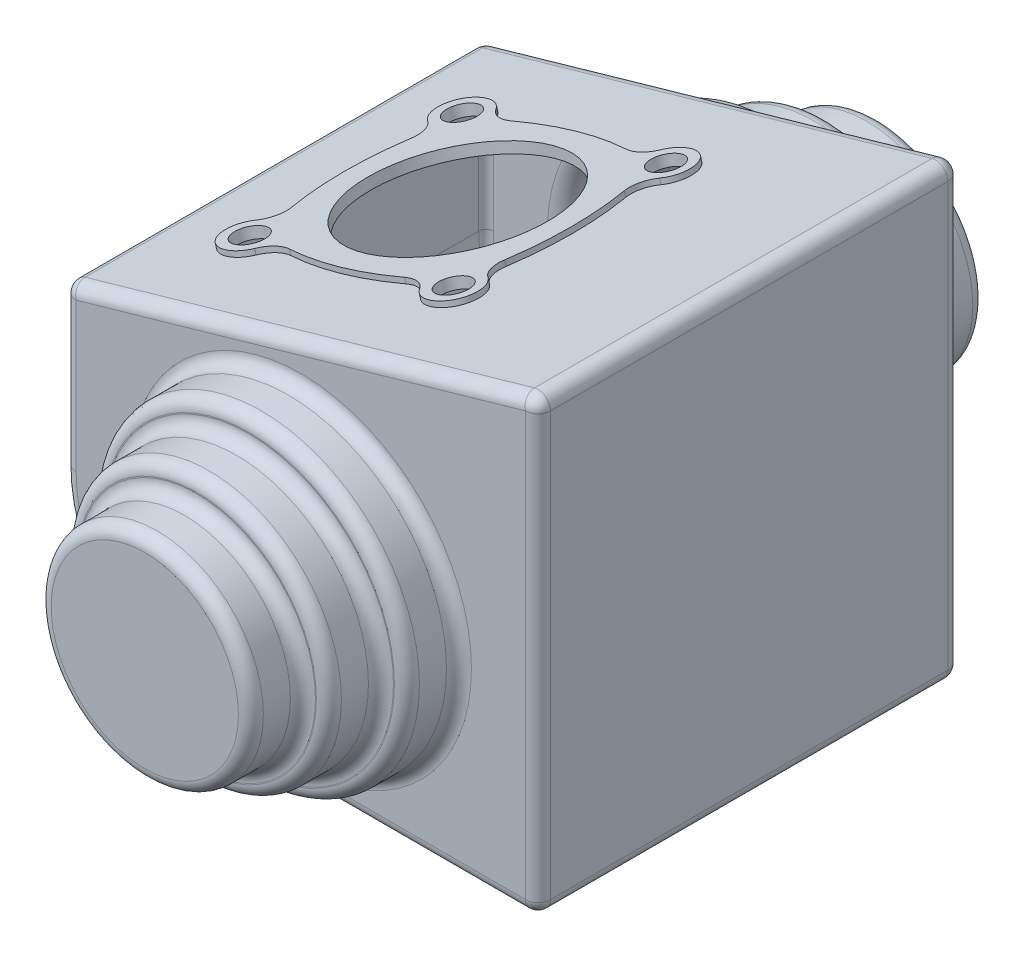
ISO-10303-21;
HEADER;
FILE_DESCRIPTION(('STEP AP214'),'2;1');
FILE_NAME('part.step','',(''),(''),'','','');
FILE_SCHEMA(('AUTOMOTIVE_DESIGN { 1 0 10303 214 1 1 1 1 }'));
ENDSEC;
DATA;
#1=APPLICATION_CONTEXT('core data for automotive mechanical design processes');
#2=APPLICATION_PROTOCOL_DEFINITION('international standard','automotive_design',2000,#1);
#3=PRODUCT_CONTEXT('',#1,'mechanical');
#4=PRODUCT('Part','Part','',(#3));
#5=PRODUCT_RELATED_PRODUCT_CATEGORY('part','',(#4));
#6=PRODUCT_DEFINITION_FORMATION('','',#4);
#7=PRODUCT_DEFINITION_CONTEXT('part definition',#1,'design');
#8=PRODUCT_DEFINITION('design','',#6,#7);
#9=PRODUCT_DEFINITION_SHAPE('','',#8);
#10=(LENGTH_UNIT() NAMED_UNIT(*) SI_UNIT(.MILLI.,.METRE.));
#11=(NAMED_UNIT(*) PLANE_ANGLE_UNIT() SI_UNIT($,.RADIAN.));
#12=(NAMED_UNIT(*) SI_UNIT($,.STERADIAN.) SOLID_ANGLE_UNIT());
#13=UNCERTAINTY_MEASURE_WITH_UNIT(LENGTH_MEASURE(1.E-05),#10,'distance_accuracy_value','');
#14=(GEOMETRIC_REPRESENTATION_CONTEXT(3) GLOBAL_UNCERTAINTY_ASSIGNED_CONTEXT((#13)) GLOBAL_UNIT_ASSIGNED_CONTEXT((#10,
#11,#12)) REPRESENTATION_CONTEXT('',''));
#15=CARTESIAN_POINT('',(0.,0.,0.));
#16=DIRECTION('',(0.,0.,1.));
#17=DIRECTION('',(1.,0.,0.));
#18=AXIS2_PLACEMENT_3D('',#15,#16,#17);
#19=CARTESIAN_POINT('',(-38.,-13.,101.5));
#20=DIRECTION('',(0.,0.,-1.));
#21=DIRECTION('',(-1.,0.,0.));
#22=AXIS2_PLACEMENT_3D('',#19,#20,#21);
#23=CYLINDRICAL_SURFACE('',#22,73.5);
#24=DIRECTION('',(0.,0.,-1.));
#25=VECTOR('',#24,1.);
#26=CARTESIAN_POINT('',(-111.5,-13.,101.5));
#27=LINE('',#26,#25);
#28=CARTESIAN_POINT('',(-111.5,-13.,95.5));
#29=VERTEX_POINT('',#28);
#30=CARTESIAN_POINT('',(-111.5,-13.,-95.4999999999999));
#31=VERTEX_POINT('',#30);
#32=EDGE_CURVE('E497',#29,#31,#27,.T.);
#33=ORIENTED_EDGE('',*,*,#32,.F.);
#34=CARTESIAN_POINT('',(-38.,-13.,95.5));
#35=DIRECTION('',(0.,0.,-1.));
#36=DIRECTION('',(-1.,0.,0.));
#37=AXIS2_PLACEMENT_3D('',#34,#35,#36);
#38=CIRCLE('',#37,73.5);
#39=CARTESIAN_POINT('',(-38.,-86.5,95.5));
#40=VERTEX_POINT('',#39);
#41=EDGE_CURVE('E745',#40,#29,#38,.T.);
#42=ORIENTED_EDGE('',*,*,#41,.F.);
#43=DIRECTION('',(0.,0.,1.));
#44=VECTOR('',#43,1.);
#45=CARTESIAN_POINT('',(-38.,-86.5,101.5));
#46=LINE('',#45,#44);
#47=CARTESIAN_POINT('',(-38.,-86.5,-95.5));
#48=VERTEX_POINT('',#47);
#49=EDGE_CURVE('E742',#40,#48,#46,.F.);
#50=ORIENTED_EDGE('',*,*,#49,.T.);
#51=CARTESIAN_POINT('',(-38.,-13.,-95.4999999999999));
#52=DIRECTION('',(0.,0.,-1.));
#53=DIRECTION('',(-1.,0.,0.));
#54=AXIS2_PLACEMENT_3D('',#51,#52,#53);
#55=CIRCLE('',#54,73.5);
#56=EDGE_CURVE('E747',#31,#48,#55,.F.);
#57=ORIENTED_EDGE('',*,*,#56,.F.);
#58=EDGE_LOOP('',(#33,#42,#50,#57));
#59=FACE_BOUND('',#58,.T.);
#60=ADVANCED_FACE('F60',(#59),#23,.F.);
#61=CARTESIAN_POINT('',(-38.,-86.5,101.5));
#62=DIRECTION('',(0.,1.,0.));
#63=DIRECTION('',(0.,0.,1.));
#64=AXIS2_PLACEMENT_3D('',#61,#62,#63);
#65=PLANE('',#64);
#66=ORIENTED_EDGE('',*,*,#49,.F.);
#67=DIRECTION('',(1.,0.,0.));
#68=VECTOR('',#67,1.);
#69=CARTESIAN_POINT('',(-38.,-86.5,95.5));
#70=LINE('',#69,#68);
#71=CARTESIAN_POINT('',(108.,-86.5,95.5));
#72=VERTEX_POINT('',#71);
#73=EDGE_CURVE('E736',#72,#40,#70,.F.);
#74=ORIENTED_EDGE('',*,*,#73,.F.);
#75=DIRECTION('',(0.,0.,1.));
#76=VECTOR('',#75,1.);
#77=CARTESIAN_POINT('',(108.,-86.5,101.5));
#78=LINE('',#77,#76);
#79=CARTESIAN_POINT('',(108.,-86.5,-95.5));
#80=VERTEX_POINT('',#79);
#81=EDGE_CURVE('E738',#80,#72,#78,.T.);
#82=ORIENTED_EDGE('',*,*,#81,.F.);
#83=DIRECTION('',(1.,0.,0.));
#84=VECTOR('',#83,1.);
#85=CARTESIAN_POINT('',(-38.,-86.5,-95.4999999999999));
#86=LINE('',#85,#84);
#87=EDGE_CURVE('E740',#48,#80,#86,.T.);
#88=ORIENTED_EDGE('',*,*,#87,.F.);
#89=EDGE_LOOP('',(#66,#74,#82,#88));
#90=FACE_BOUND('',#89,.T.);
#91=ADVANCED_FACE('F817',(#90),#65,.T.);
#92=CARTESIAN_POINT('',(111.5,-89.,101.5));
#93=DIRECTION('',(-1.,0.,0.));
#94=DIRECTION('',(0.,0.,1.));
#95=AXIS2_PLACEMENT_3D('',#92,#93,#94);
#96=PLANE('',#95);
#97=DIRECTION('',(0.,1.,0.));
#98=VECTOR('',#97,1.);
#99=CARTESIAN_POINT('',(111.5,-89.,-95.5));
#100=LINE('',#99,#98);
#101=CARTESIAN_POINT('',(111.5,-83.,-95.5));
#102=VERTEX_POINT('',#101);
#103=CARTESIAN_POINT('',(111.5,120.415679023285,-95.5));
#104=VERTEX_POINT('',#103);
#105=EDGE_CURVE('E733',#102,#104,#100,.T.);
#106=ORIENTED_EDGE('',*,*,#105,.F.);
#107=DIRECTION('',(0.,0.,1.));
#108=VECTOR('',#107,1.);
#109=CARTESIAN_POINT('',(111.5,-83.,101.5));
#110=LINE('',#109,#108);
#111=CARTESIAN_POINT('',(111.5,-83.,95.5));
#112=VERTEX_POINT('',#111);
#113=EDGE_CURVE('E727',#112,#102,#110,.F.);
#114=ORIENTED_EDGE('',*,*,#113,.F.);
#115=DIRECTION('',(0.,1.,0.));
#116=VECTOR('',#115,1.);
#117=CARTESIAN_POINT('',(111.5,-89.,95.5));
#118=LINE('',#117,#116);
#119=CARTESIAN_POINT('',(111.5,120.415679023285,95.5));
#120=VERTEX_POINT('',#119);
#121=EDGE_CURVE('E729',#120,#112,#118,.F.);
#122=ORIENTED_EDGE('',*,*,#121,.F.);
#123=DIRECTION('',(0.,0.,1.));
#124=VECTOR('',#123,1.);
#125=CARTESIAN_POINT('',(111.5,120.415679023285,101.5));
#126=LINE('',#125,#124);
#127=EDGE_CURVE('E731',#104,#120,#126,.T.);
#128=ORIENTED_EDGE('',*,*,#127,.F.);
#129=EDGE_LOOP('',(#106,#114,#122,#128));
#130=FACE_BOUND('',#129,.T.);
#131=ADVANCED_FACE('F770',(#130),#96,.T.);
#132=CARTESIAN_POINT('',(114.689093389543,125.974793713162,101.5));
#133=DIRECTION('',(0.275637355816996,-0.96126169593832,0.));
#134=DIRECTION('',(0.96126169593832,0.275637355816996,0.));
#135=AXIS2_PLACEMENT_3D('',#132,#133,#134);
#136=PLANE('',#135);
#137=CARTESIAN_POINT('',(-73.6889684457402,71.9582537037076,51.0000000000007));
#138=DIRECTION('',(0.275637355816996,-0.96126169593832,0.));
#139=DIRECTION('',(0.96126169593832,0.275637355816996,0.));
#140=AXIS2_PLACEMENT_3D('',#137,#138,#139);
#141=CIRCLE('',#140,7.5);
#142=CARTESIAN_POINT('',(-66.4795057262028,74.0255338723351,51.0000000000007));
#143=VERTEX_POINT('',#142);
#144=EDGE_CURVE('E64',#143,#143,#141,.T.);
#145=ORIENTED_EDGE('',*,*,#144,.F.);
#146=EDGE_LOOP('',(#145));
#147=FACE_BOUND('',#146,.T.);
#148=CARTESIAN_POINT('',(24.3597245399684,100.073263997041,51.));
#149=DIRECTION('',(0.275637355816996,-0.96126169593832,0.));
#150=DIRECTION('',(0.96126169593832,0.275637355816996,0.));
#151=AXIS2_PLACEMENT_3D('',#148,#149,#150);
#152=CIRCLE('',#151,7.5);
#153=CARTESIAN_POINT('',(31.5691872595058,102.140544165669,51.));
#154=VERTEX_POINT('',#153);
#155=EDGE_CURVE('E756',#154,#154,#152,.T.);
#156=ORIENTED_EDGE('',*,*,#155,.F.);
#157=EDGE_LOOP('',(#156));
#158=FACE_BOUND('',#157,.T.);
#159=CARTESIAN_POINT('',(24.3597245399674,100.073263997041,-51.));
#160=DIRECTION('',(0.275637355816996,-0.96126169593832,0.));
#161=DIRECTION('',(0.96126169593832,0.275637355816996,0.));
#162=AXIS2_PLACEMENT_3D('',#159,#160,#161);
#163=CIRCLE('',#162,7.5);
#164=CARTESIAN_POINT('',(31.5691872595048,102.140544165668,-51.));
#165=VERTEX_POINT('',#164);
#166=EDGE_CURVE('E754',#165,#165,#163,.T.);
#167=ORIENTED_EDGE('',*,*,#166,.F.);
#168=EDGE_LOOP('',(#167));
#169=FACE_BOUND('',#168,.T.);
#170=CARTESIAN_POINT('',(-73.6889684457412,71.9582537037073,-50.9999999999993));
#171=DIRECTION('',(0.275637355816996,-0.96126169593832,0.));
#172=DIRECTION('',(0.96126169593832,0.275637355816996,0.));
#173=AXIS2_PLACEMENT_3D('',#170,#171,#172);
#174=CIRCLE('',#173,7.5);
#175=CARTESIAN_POINT('',(-66.4795057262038,74.0255338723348,-50.9999999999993));
#176=VERTEX_POINT('',#175);
#177=EDGE_CURVE('E355',#176,#176,#174,.T.);
#178=ORIENTED_EDGE('',*,*,#177,.F.);
#179=EDGE_LOOP('',(#178));
#180=FACE_BOUND('',#179,.T.);
#181=CARTESIAN_POINT('',(-24.6646219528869,86.0157588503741,0.));
#182=DIRECTION('',(0.275637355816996,-0.96126169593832,0.));
#183=DIRECTION('',(0.96126169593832,0.275637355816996,0.));
#184=AXIS2_PLACEMENT_3D('',#181,#182,#183);
#185=CIRCLE('',#184,45.);
#186=CARTESIAN_POINT('',(18.5921543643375,98.419439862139,0.));
#187=VERTEX_POINT('',#186);
#188=EDGE_CURVE('E352',#187,#187,#185,.T.);
#189=ORIENTED_EDGE('',*,*,#188,.F.);
#190=EDGE_LOOP('',(#189));
#191=FACE_BOUND('',#190,.T.);
#192=DIRECTION('',(0.,0.,1.));
#193=VECTOR('',#192,1.);
#194=CARTESIAN_POINT('',(107.035269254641,123.780094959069,101.5));
#195=LINE('',#194,#193);
#196=CARTESIAN_POINT('',(107.035269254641,123.780094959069,95.5));
#197=VERTEX_POINT('',#196);
#198=CARTESIAN_POINT('',(107.035269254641,123.780094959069,-95.5000000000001));
#199=VERTEX_POINT('',#198);
#200=EDGE_CURVE('E725',#197,#199,#195,.F.);
#201=ORIENTED_EDGE('',*,*,#200,.F.);
#202=DIRECTION('',(0.96126169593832,0.275637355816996,0.));
#203=VECTOR('',#202,1.);
#204=CARTESIAN_POINT('',(114.689093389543,125.974793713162,95.5));
#205=LINE('',#204,#203);
#206=CARTESIAN_POINT('',(-108.96473074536,61.8430916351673,95.5));
#207=VERTEX_POINT('',#206);
#208=EDGE_CURVE('E718',#207,#197,#205,.T.);
#209=ORIENTED_EDGE('',*,*,#208,.F.);
#210=DIRECTION('',(0.,0.,1.));
#211=VECTOR('',#210,1.);
#212=CARTESIAN_POINT('',(-108.96473074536,61.8430916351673,101.5));
#213=LINE('',#212,#211);
#214=CARTESIAN_POINT('',(-108.96473074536,61.8430916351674,-95.5));
#215=VERTEX_POINT('',#214);
#216=EDGE_CURVE('E720',#215,#207,#213,.T.);
#217=ORIENTED_EDGE('',*,*,#216,.F.);
#218=DIRECTION('',(0.96126169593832,0.275637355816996,0.));
#219=VECTOR('',#218,1.);
#220=CARTESIAN_POINT('',(114.689093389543,125.974793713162,-95.5000000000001));
#221=LINE('',#220,#219);
#222=EDGE_CURVE('E722',#199,#215,#221,.F.);
#223=ORIENTED_EDGE('',*,*,#222,.F.);
#224=EDGE_LOOP('',(#201,#209,#217,#223));
#225=FACE_BOUND('',#224,.T.);
#226=ADVANCED_FACE('F766',(#147,#158,#169,#180,#191,#225),#136,.T.);
#227=CARTESIAN_POINT('',(-111.5,63.,101.5));
#228=DIRECTION('',(1.,0.,0.));
#229=DIRECTION('',(0.,1.,0.));
#230=AXIS2_PLACEMENT_3D('',#227,#228,#229);
#231=PLANE('',#230);
#232=DIRECTION('',(0.,0.,1.));
#233=VECTOR('',#232,1.);
#234=CARTESIAN_POINT('',(-111.5,58.4786756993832,101.5));
#235=LINE('',#234,#233);
#236=CARTESIAN_POINT('',(-111.5,58.4786756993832,95.5));
#237=VERTEX_POINT('',#236);
#238=CARTESIAN_POINT('',(-111.5,58.4786756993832,-95.4999999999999));
#239=VERTEX_POINT('',#238);
#240=EDGE_CURVE('E716',#237,#239,#235,.F.);
#241=ORIENTED_EDGE('',*,*,#240,.F.);
#242=DIRECTION('',(0.,1.,0.));
#243=VECTOR('',#242,1.);
#244=CARTESIAN_POINT('',(-111.5,63.,95.5));
#245=LINE('',#244,#243);
#246=EDGE_CURVE('E712',#29,#237,#245,.T.);
#247=ORIENTED_EDGE('',*,*,#246,.F.);
#248=ORIENTED_EDGE('',*,*,#32,.T.);
#249=DIRECTION('',(0.,1.,0.));
#250=VECTOR('',#249,1.);
#251=CARTESIAN_POINT('',(-111.5,63.,-95.4999999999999));
#252=LINE('',#251,#250);
#253=EDGE_CURVE('E714',#239,#31,#252,.F.);
#254=ORIENTED_EDGE('',*,*,#253,.F.);
#255=EDGE_LOOP('',(#241,#247,#248,#254));
#256=FACE_BOUND('',#255,.T.);
#257=ADVANCED_FACE('F769',(#256),#231,.T.);
#258=CARTESIAN_POINT('',(-38.,-13.,99.));
#259=DIRECTION('',(0.,0.,1.));
#260=DIRECTION('',(1.,0.,0.));
#261=AXIS2_PLACEMENT_3D('',#258,#259,#260);
#262=PLANE('',#261);
#263=CARTESIAN_POINT('',(0.,0.,99.));
#264=DIRECTION('',(0.,0.,1.));
#265=DIRECTION('',(1.,0.,0.));
#266=AXIS2_PLACEMENT_3D('',#263,#264,#265);
#267=CIRCLE('',#266,82.);
#268=CARTESIAN_POINT('',(82.,0.,99.));
#269=VERTEX_POINT('',#268);
#270=EDGE_CURVE('E709',#269,#269,#267,.F.);
#271=ORIENTED_EDGE('',*,*,#270,.F.);
#272=EDGE_LOOP('',(#271));
#273=FACE_BOUND('',#272,.T.);
#274=DIRECTION('',(0.,1.,0.));
#275=VECTOR('',#274,1.);
#276=CARTESIAN_POINT('',(-108.,-13.,99.));
#277=LINE('',#276,#275);
#278=CARTESIAN_POINT('',(-108.,58.4786756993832,99.));
#279=VERTEX_POINT('',#278);
#280=CARTESIAN_POINT('',(-108.,-13.,99.));
#281=VERTEX_POINT('',#280);
#282=EDGE_CURVE('E707',#279,#281,#277,.F.);
#283=ORIENTED_EDGE('',*,*,#282,.F.);
#284=DIRECTION('',(0.96126169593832,0.275637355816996,0.));
#285=VECTOR('',#284,1.);
#286=CARTESIAN_POINT('',(-62.2572802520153,71.595189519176,99.));
#287=LINE('',#286,#285);
#288=CARTESIAN_POINT('',(108.,120.415679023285,99.));
#289=VERTEX_POINT('',#288);
#290=EDGE_CURVE('E698',#289,#279,#287,.F.);
#291=ORIENTED_EDGE('',*,*,#290,.F.);
#292=DIRECTION('',(0.,1.,0.));
#293=VECTOR('',#292,1.);
#294=CARTESIAN_POINT('',(108.,-13.,99.));
#295=LINE('',#294,#293);
#296=CARTESIAN_POINT('',(108.,-83.,99.));
#297=VERTEX_POINT('',#296);
#298=EDGE_CURVE('E700',#297,#289,#295,.T.);
#299=ORIENTED_EDGE('',*,*,#298,.F.);
#300=DIRECTION('',(1.,0.,0.));
#301=VECTOR('',#300,1.);
#302=CARTESIAN_POINT('',(-38.,-83.,99.));
#303=LINE('',#302,#301);
#304=CARTESIAN_POINT('',(-38.,-83.,99.));
#305=VERTEX_POINT('',#304);
#306=EDGE_CURVE('E702',#305,#297,#303,.T.);
#307=ORIENTED_EDGE('',*,*,#306,.F.);
#308=CARTESIAN_POINT('',(-38.,-13.,99.));
#309=DIRECTION('',(0.,0.,1.));
#310=DIRECTION('',(1.,0.,0.));
#311=AXIS2_PLACEMENT_3D('',#308,#309,#310);
#312=CIRCLE('',#311,70.);
#313=EDGE_CURVE('E704',#281,#305,#312,.T.);
#314=ORIENTED_EDGE('',*,*,#313,.F.);
#315=EDGE_LOOP('',(#283,#291,#299,#307,#314));
#316=FACE_BOUND('',#315,.T.);
#317=ADVANCED_FACE('F837',(#273,#316),#262,.F.);
#318=CARTESIAN_POINT('',(-38.,-13.,-99.));
#319=DIRECTION('',(0.,0.,1.));
#320=DIRECTION('',(1.,0.,0.));
#321=AXIS2_PLACEMENT_3D('',#318,#319,#320);
#322=PLANE('',#321);
#323=CARTESIAN_POINT('',(0.,0.,-99.));
#324=DIRECTION('',(0.,0.,1.));
#325=DIRECTION('',(1.,0.,0.));
#326=AXIS2_PLACEMENT_3D('',#323,#324,#325);
#327=CIRCLE('',#326,82.);
#328=CARTESIAN_POINT('',(82.,0.,-99.));
#329=VERTEX_POINT('',#328);
#330=EDGE_CURVE('E695',#329,#329,#327,.T.);
#331=ORIENTED_EDGE('',*,*,#330,.F.);
#332=EDGE_LOOP('',(#331));
#333=FACE_BOUND('',#332,.T.);
#334=DIRECTION('',(1.,0.,0.));
#335=VECTOR('',#334,1.);
#336=CARTESIAN_POINT('',(-38.,-83.,-99.));
#337=LINE('',#336,#335);
#338=CARTESIAN_POINT('',(108.,-83.,-99.));
#339=VERTEX_POINT('',#338);
#340=CARTESIAN_POINT('',(-38.,-83.,-99.));
#341=VERTEX_POINT('',#340);
#342=EDGE_CURVE('E693',#339,#341,#337,.F.);
#343=ORIENTED_EDGE('',*,*,#342,.F.);
#344=DIRECTION('',(0.,1.,0.));
#345=VECTOR('',#344,1.);
#346=CARTESIAN_POINT('',(108.,-13.,-99.));
#347=LINE('',#346,#345);
#348=CARTESIAN_POINT('',(108.,120.415679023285,-99.));
#349=VERTEX_POINT('',#348);
#350=EDGE_CURVE('E684',#349,#339,#347,.F.);
#351=ORIENTED_EDGE('',*,*,#350,.F.);
#352=DIRECTION('',(-0.96126169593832,-0.275637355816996,0.));
#353=VECTOR('',#352,1.);
#354=CARTESIAN_POINT('',(115.653824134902,122.610377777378,-99.));
#355=LINE('',#354,#353);
#356=CARTESIAN_POINT('',(-108.,58.4786756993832,-99.));
#357=VERTEX_POINT('',#356);
#358=EDGE_CURVE('E686',#357,#349,#355,.F.);
#359=ORIENTED_EDGE('',*,*,#358,.F.);
#360=DIRECTION('',(0.,1.,0.));
#361=VECTOR('',#360,1.);
#362=CARTESIAN_POINT('',(-108.,-13.,-99.));
#363=LINE('',#362,#361);
#364=CARTESIAN_POINT('',(-108.,-13.,-99.));
#365=VERTEX_POINT('',#364);
#366=EDGE_CURVE('E688',#365,#357,#363,.T.);
#367=ORIENTED_EDGE('',*,*,#366,.F.);
#368=CARTESIAN_POINT('',(-38.,-13.,-99.));
#369=DIRECTION('',(0.,0.,1.));
#370=DIRECTION('',(1.,0.,0.));
#371=AXIS2_PLACEMENT_3D('',#368,#369,#370);
#372=CIRCLE('',#371,70.);
#373=EDGE_CURVE('E690',#341,#365,#372,.F.);
#374=ORIENTED_EDGE('',*,*,#373,.F.);
#375=EDGE_LOOP('',(#343,#351,#359,#367,#374));
#376=FACE_BOUND('',#375,.T.);
#377=ADVANCED_FACE('F800',(#333,#376),#322,.T.);
#378=CARTESIAN_POINT('',(0.,0.,126.5));
#379=DIRECTION('',(0.,0.,-1.));
#380=DIRECTION('',(-1.,0.,0.));
#381=AXIS2_PLACEMENT_3D('',#378,#379,#380);
#382=CYLINDRICAL_SURFACE('',#381,73.5);
#383=CARTESIAN_POINT('',(0.,0.,120.5));
#384=DIRECTION('',(0.,0.,-1.));
#385=DIRECTION('',(-1.,0.,0.));
#386=AXIS2_PLACEMENT_3D('',#383,#384,#385);
#387=CIRCLE('',#386,73.5);
#388=CARTESIAN_POINT('',(-73.5,0.,120.5));
#389=VERTEX_POINT('',#388);
#390=EDGE_CURVE('E681',#389,#389,#387,.T.);
#391=ORIENTED_EDGE('',*,*,#390,.F.);
#392=EDGE_LOOP('',(#391));
#393=FACE_BOUND('',#392,.T.);
#394=CARTESIAN_POINT('',(0.,0.,107.5));
#395=DIRECTION('',(0.,0.,-1.));
#396=DIRECTION('',(-1.,0.,0.));
#397=AXIS2_PLACEMENT_3D('',#394,#395,#396);
#398=CIRCLE('',#397,73.5);
#399=CARTESIAN_POINT('',(-73.5,0.,107.5));
#400=VERTEX_POINT('',#399);
#401=EDGE_CURVE('E678',#400,#400,#398,.F.);
#402=ORIENTED_EDGE('',*,*,#401,.F.);
#403=EDGE_LOOP('',(#402));
#404=FACE_BOUND('',#403,.T.);
#405=ADVANCED_FACE('F893',(#393,#404),#382,.F.);
#406=CARTESIAN_POINT('',(0.,0.,124.));
#407=DIRECTION('',(0.,0.,1.));
#408=DIRECTION('',(1.,0.,0.));
#409=AXIS2_PLACEMENT_3D('',#406,#407,#408);
#410=PLANE('',#409);
#411=CARTESIAN_POINT('',(0.,0.,124.));
#412=DIRECTION('',(0.,0.,1.));
#413=DIRECTION('',(1.,0.,0.));
#414=AXIS2_PLACEMENT_3D('',#411,#412,#413);
#415=CIRCLE('',#414,69.5);
#416=CARTESIAN_POINT('',(69.5,0.,124.));
#417=VERTEX_POINT('',#416);
#418=EDGE_CURVE('E675',#417,#417,#415,.F.);
#419=ORIENTED_EDGE('',*,*,#418,.F.);
#420=EDGE_LOOP('',(#419));
#421=FACE_BOUND('',#420,.T.);
#422=CARTESIAN_POINT('',(0.,0.,124.));
#423=DIRECTION('',(0.,0.,1.));
#424=DIRECTION('',(1.,0.,0.));
#425=AXIS2_PLACEMENT_3D('',#422,#423,#424);
#426=CIRCLE('',#425,70.);
#427=CARTESIAN_POINT('',(70.,0.,124.));
#428=VERTEX_POINT('',#427);
#429=EDGE_CURVE('E672',#428,#428,#426,.T.);
#430=ORIENTED_EDGE('',*,*,#429,.F.);
#431=EDGE_LOOP('',(#430));
#432=FACE_BOUND('',#431,.T.);
#433=ADVANCED_FACE('F897',(#421,#432),#410,.F.);
#434=CARTESIAN_POINT('',(0.,0.,151.5));
#435=DIRECTION('',(0.,0.,-1.));
#436=DIRECTION('',(-1.,0.,0.));
#437=AXIS2_PLACEMENT_3D('',#434,#435,#436);
#438=CYLINDRICAL_SURFACE('',#437,61.);
#439=CARTESIAN_POINT('',(0.,0.,145.5));
#440=DIRECTION('',(0.,0.,-1.));
#441=DIRECTION('',(-1.,0.,0.));
#442=AXIS2_PLACEMENT_3D('',#439,#440,#441);
#443=CIRCLE('',#442,61.);
#444=CARTESIAN_POINT('',(-61.,0.,145.5));
#445=VERTEX_POINT('',#444);
#446=EDGE_CURVE('E669',#445,#445,#443,.T.);
#447=ORIENTED_EDGE('',*,*,#446,.F.);
#448=EDGE_LOOP('',(#447));
#449=FACE_BOUND('',#448,.T.);
#450=CARTESIAN_POINT('',(0.,0.,132.5));
#451=DIRECTION('',(0.,0.,-1.));
#452=DIRECTION('',(-1.,0.,0.));
#453=AXIS2_PLACEMENT_3D('',#450,#451,#452);
#454=CIRCLE('',#453,61.);
#455=CARTESIAN_POINT('',(-61.,0.,132.5));
#456=VERTEX_POINT('',#455);
#457=EDGE_CURVE('E666',#456,#456,#454,.F.);
#458=ORIENTED_EDGE('',*,*,#457,.F.);
#459=EDGE_LOOP('',(#458));
#460=FACE_BOUND('',#459,.T.);
#461=ADVANCED_FACE('F901',(#449,#460),#438,.F.);
#462=CARTESIAN_POINT('',(0.,0.,149.));
#463=DIRECTION('',(0.,0.,1.));
#464=DIRECTION('',(1.,0.,0.));
#465=AXIS2_PLACEMENT_3D('',#462,#463,#464);
#466=PLANE('',#465);
#467=CARTESIAN_POINT('',(0.,0.,149.));
#468=DIRECTION('',(0.,0.,1.));
#469=DIRECTION('',(1.,0.,0.));
#470=AXIS2_PLACEMENT_3D('',#467,#468,#469);
#471=CIRCLE('',#470,57.);
#472=CARTESIAN_POINT('',(57.,0.,149.));
#473=VERTEX_POINT('',#472);
#474=EDGE_CURVE('E663',#473,#473,#471,.F.);
#475=ORIENTED_EDGE('',*,*,#474,.F.);
#476=EDGE_LOOP('',(#475));
#477=FACE_BOUND('',#476,.T.);
#478=CARTESIAN_POINT('',(0.,0.,149.));
#479=DIRECTION('',(0.,0.,1.));
#480=DIRECTION('',(1.,0.,0.));
#481=AXIS2_PLACEMENT_3D('',#478,#479,#480);
#482=CIRCLE('',#481,57.5);
#483=CARTESIAN_POINT('',(57.5,0.,149.));
#484=VERTEX_POINT('',#483);
#485=EDGE_CURVE('E660',#484,#484,#482,.T.);
#486=ORIENTED_EDGE('',*,*,#485,.F.);
#487=EDGE_LOOP('',(#486));
#488=FACE_BOUND('',#487,.T.);
#489=ADVANCED_FACE('F905',(#477,#488),#466,.F.);
#490=CARTESIAN_POINT('',(0.,0.,176.5));
#491=DIRECTION('',(0.,0.,-1.));
#492=DIRECTION('',(-1.,0.,0.));
#493=AXIS2_PLACEMENT_3D('',#490,#491,#492);
#494=CYLINDRICAL_SURFACE('',#493,48.5);
#495=CARTESIAN_POINT('',(0.,0.,170.5));
#496=DIRECTION('',(0.,0.,-1.));
#497=DIRECTION('',(-1.,0.,0.));
#498=AXIS2_PLACEMENT_3D('',#495,#496,#497);
#499=CIRCLE('',#498,48.5);
#500=CARTESIAN_POINT('',(-48.5,0.,170.5));
#501=VERTEX_POINT('',#500);
#502=EDGE_CURVE('E657',#501,#501,#499,.T.);
#503=ORIENTED_EDGE('',*,*,#502,.F.);
#504=EDGE_LOOP('',(#503));
#505=FACE_BOUND('',#504,.T.);
#506=CARTESIAN_POINT('',(0.,0.,157.5));
#507=DIRECTION('',(0.,0.,-1.));
#508=DIRECTION('',(-1.,0.,0.));
#509=AXIS2_PLACEMENT_3D('',#506,#507,#508);
#510=CIRCLE('',#509,48.5);
#511=CARTESIAN_POINT('',(-48.5,0.,157.5));
#512=VERTEX_POINT('',#511);
#513=EDGE_CURVE('E654',#512,#512,#510,.F.);
#514=ORIENTED_EDGE('',*,*,#513,.F.);
#515=EDGE_LOOP('',(#514));
#516=FACE_BOUND('',#515,.T.);
#517=ADVANCED_FACE('F909',(#505,#516),#494,.F.);
#518=CARTESIAN_POINT('',(0.,0.,174.));
#519=DIRECTION('',(0.,0.,1.));
#520=DIRECTION('',(1.,0.,0.));
#521=AXIS2_PLACEMENT_3D('',#518,#519,#520);
#522=PLANE('',#521);
#523=CARTESIAN_POINT('',(0.,0.,174.));
#524=DIRECTION('',(0.,0.,1.));
#525=DIRECTION('',(1.,0.,0.));
#526=AXIS2_PLACEMENT_3D('',#523,#524,#525);
#527=CIRCLE('',#526,45.);
#528=CARTESIAN_POINT('',(45.,0.,174.));
#529=VERTEX_POINT('',#528);
#530=EDGE_CURVE('E651',#529,#529,#527,.T.);
#531=ORIENTED_EDGE('',*,*,#530,.F.);
#532=EDGE_LOOP('',(#531));
#533=FACE_BOUND('',#532,.T.);
#534=ADVANCED_FACE('F913',(#533),#522,.F.);
#535=CARTESIAN_POINT('',(0.,0.,-126.5));
#536=DIRECTION('',(0.,0.,1.));
#537=DIRECTION('',(1.,0.,0.));
#538=AXIS2_PLACEMENT_3D('',#535,#536,#537);
#539=CYLINDRICAL_SURFACE('',#538,73.5);
#540=CARTESIAN_POINT('',(0.,0.,-107.5));
#541=DIRECTION('',(0.,0.,1.));
#542=DIRECTION('',(1.,0.,0.));
#543=AXIS2_PLACEMENT_3D('',#540,#541,#542);
#544=CIRCLE('',#543,73.5);
#545=CARTESIAN_POINT('',(73.5,0.,-107.5));
#546=VERTEX_POINT('',#545);
#547=EDGE_CURVE('E648',#546,#546,#544,.F.);
#548=ORIENTED_EDGE('',*,*,#547,.F.);
#549=EDGE_LOOP('',(#548));
#550=FACE_BOUND('',#549,.T.);
#551=CARTESIAN_POINT('',(0.,0.,-120.5));
#552=DIRECTION('',(0.,0.,1.));
#553=DIRECTION('',(1.,0.,0.));
#554=AXIS2_PLACEMENT_3D('',#551,#552,#553);
#555=CIRCLE('',#554,73.5);
#556=CARTESIAN_POINT('',(73.5,0.,-120.5));
#557=VERTEX_POINT('',#556);
#558=EDGE_CURVE('E645',#557,#557,#555,.T.);
#559=ORIENTED_EDGE('',*,*,#558,.F.);
#560=EDGE_LOOP('',(#559));
#561=FACE_BOUND('',#560,.T.);
#562=ADVANCED_FACE('F917',(#550,#561),#539,.F.);
#563=CARTESIAN_POINT('',(0.,0.,-124.));
#564=DIRECTION('',(0.,0.,-1.));
#565=DIRECTION('',(1.,0.,0.));
#566=AXIS2_PLACEMENT_3D('',#563,#564,#565);
#567=PLANE('',#566);
#568=CARTESIAN_POINT('',(0.,0.,-124.));
#569=DIRECTION('',(0.,0.,-1.));
#570=DIRECTION('',(-1.,0.,0.));
#571=AXIS2_PLACEMENT_3D('',#568,#569,#570);
#572=CIRCLE('',#571,70.);
#573=CARTESIAN_POINT('',(-70.,0.,-124.));
#574=VERTEX_POINT('',#573);
#575=EDGE_CURVE('E642',#574,#574,#572,.T.);
#576=ORIENTED_EDGE('',*,*,#575,.F.);
#577=EDGE_LOOP('',(#576));
#578=FACE_BOUND('',#577,.T.);
#579=CARTESIAN_POINT('',(0.,0.,-124.));
#580=DIRECTION('',(0.,0.,-1.));
#581=DIRECTION('',(-1.,0.,0.));
#582=AXIS2_PLACEMENT_3D('',#579,#580,#581);
#583=CIRCLE('',#582,69.5);
#584=CARTESIAN_POINT('',(-69.5,0.,-124.));
#585=VERTEX_POINT('',#584);
#586=EDGE_CURVE('E639',#585,#585,#583,.F.);
#587=ORIENTED_EDGE('',*,*,#586,.F.);
#588=EDGE_LOOP('',(#587));
#589=FACE_BOUND('',#588,.T.);
#590=ADVANCED_FACE('F921',(#578,#589),#567,.F.);
#591=CARTESIAN_POINT('',(0.,0.,-151.5));
#592=DIRECTION('',(0.,0.,1.));
#593=DIRECTION('',(1.,0.,0.));
#594=AXIS2_PLACEMENT_3D('',#591,#592,#593);
#595=CYLINDRICAL_SURFACE('',#594,61.);
#596=CARTESIAN_POINT('',(0.,0.,-145.5));
#597=DIRECTION('',(0.,0.,1.));
#598=DIRECTION('',(1.,0.,0.));
#599=AXIS2_PLACEMENT_3D('',#596,#597,#598);
#600=CIRCLE('',#599,61.);
#601=CARTESIAN_POINT('',(61.,0.,-145.5));
#602=VERTEX_POINT('',#601);
#603=EDGE_CURVE('E636',#602,#602,#600,.T.);
#604=ORIENTED_EDGE('',*,*,#603,.F.);
#605=EDGE_LOOP('',(#604));
#606=FACE_BOUND('',#605,.T.);
#607=CARTESIAN_POINT('',(0.,0.,-132.5));
#608=DIRECTION('',(0.,0.,1.));
#609=DIRECTION('',(1.,0.,0.));
#610=AXIS2_PLACEMENT_3D('',#607,#608,#609);
#611=CIRCLE('',#610,61.);
#612=CARTESIAN_POINT('',(61.,0.,-132.5));
#613=VERTEX_POINT('',#612);
#614=EDGE_CURVE('E633',#613,#613,#611,.F.);
#615=ORIENTED_EDGE('',*,*,#614,.F.);
#616=EDGE_LOOP('',(#615));
#617=FACE_BOUND('',#616,.T.);
#618=ADVANCED_FACE('F925',(#606,#617),#595,.F.);
#619=CARTESIAN_POINT('',(0.,0.,-149.));
#620=DIRECTION('',(0.,0.,-1.));
#621=DIRECTION('',(1.,0.,0.));
#622=AXIS2_PLACEMENT_3D('',#619,#620,#621);
#623=PLANE('',#622);
#624=CARTESIAN_POINT('',(0.,0.,-149.));
#625=DIRECTION('',(0.,0.,-1.));
#626=DIRECTION('',(-1.,0.,0.));
#627=AXIS2_PLACEMENT_3D('',#624,#625,#626);
#628=CIRCLE('',#627,57.5);
#629=CARTESIAN_POINT('',(-57.5,0.,-149.));
#630=VERTEX_POINT('',#629);
#631=EDGE_CURVE('E630',#630,#630,#628,.T.);
#632=ORIENTED_EDGE('',*,*,#631,.F.);
#633=EDGE_LOOP('',(#632));
#634=FACE_BOUND('',#633,.T.);
#635=CARTESIAN_POINT('',(0.,0.,-149.));
#636=DIRECTION('',(0.,0.,-1.));
#637=DIRECTION('',(-1.,0.,0.));
#638=AXIS2_PLACEMENT_3D('',#635,#636,#637);
#639=CIRCLE('',#638,57.);
#640=CARTESIAN_POINT('',(-57.,0.,-149.));
#641=VERTEX_POINT('',#640);
#642=EDGE_CURVE('E627',#641,#641,#639,.F.);
#643=ORIENTED_EDGE('',*,*,#642,.F.);
#644=EDGE_LOOP('',(#643));
#645=FACE_BOUND('',#644,.T.);
#646=ADVANCED_FACE('F929',(#634,#645),#623,.F.);
#647=CARTESIAN_POINT('',(0.,0.,-176.5));
#648=DIRECTION('',(0.,0.,1.));
#649=DIRECTION('',(1.,0.,0.));
#650=AXIS2_PLACEMENT_3D('',#647,#648,#649);
#651=CYLINDRICAL_SURFACE('',#650,48.5);
#652=CARTESIAN_POINT('',(0.,0.,-170.5));
#653=DIRECTION('',(0.,0.,1.));
#654=DIRECTION('',(1.,0.,0.));
#655=AXIS2_PLACEMENT_3D('',#652,#653,#654);
#656=CIRCLE('',#655,48.5);
#657=CARTESIAN_POINT('',(48.5,0.,-170.5));
#658=VERTEX_POINT('',#657);
#659=EDGE_CURVE('E624',#658,#658,#656,.T.);
#660=ORIENTED_EDGE('',*,*,#659,.F.);
#661=EDGE_LOOP('',(#660));
#662=FACE_BOUND('',#661,.T.);
#663=CARTESIAN_POINT('',(0.,0.,-157.5));
#664=DIRECTION('',(0.,0.,1.));
#665=DIRECTION('',(1.,0.,0.));
#666=AXIS2_PLACEMENT_3D('',#663,#664,#665);
#667=CIRCLE('',#666,48.5);
#668=CARTESIAN_POINT('',(48.5,0.,-157.5));
#669=VERTEX_POINT('',#668);
#670=EDGE_CURVE('E621',#669,#669,#667,.F.);
#671=ORIENTED_EDGE('',*,*,#670,.F.);
#672=EDGE_LOOP('',(#671));
#673=FACE_BOUND('',#672,.T.);
#674=ADVANCED_FACE('F933',(#662,#673),#651,.F.);
#675=CARTESIAN_POINT('',(0.,0.,-174.));
#676=DIRECTION('',(0.,0.,-1.));
#677=DIRECTION('',(1.,0.,0.));
#678=AXIS2_PLACEMENT_3D('',#675,#676,#677);
#679=PLANE('',#678);
#680=CARTESIAN_POINT('',(0.,0.,-174.));
#681=DIRECTION('',(0.,0.,-1.));
#682=DIRECTION('',(-1.,0.,0.));
#683=AXIS2_PLACEMENT_3D('',#680,#681,#682);
#684=CIRCLE('',#683,45.);
#685=CARTESIAN_POINT('',(-45.,0.,-174.));
#686=VERTEX_POINT('',#685);
#687=EDGE_CURVE('E618',#686,#686,#684,.T.);
#688=ORIENTED_EDGE('',*,*,#687,.F.);
#689=EDGE_LOOP('',(#688));
#690=FACE_BOUND('',#689,.T.);
#691=ADVANCED_FACE('F937',(#690),#679,.F.);
#692=CARTESIAN_POINT('',(0.,0.,-170.5));
#693=DIRECTION('',(0.,0.,-1.));
#694=DIRECTION('',(-1.,0.,0.));
#695=AXIS2_PLACEMENT_3D('',#692,#693,#694);
#696=TOROIDAL_SURFACE('',#695,45.,3.5);
#697=ORIENTED_EDGE('',*,*,#687,.T.);
#698=EDGE_LOOP('',(#697));
#699=FACE_BOUND('',#698,.T.);
#700=ORIENTED_EDGE('',*,*,#659,.T.);
#701=EDGE_LOOP('',(#700));
#702=FACE_BOUND('',#701,.T.);
#703=ADVANCED_FACE('F941',(#699,#702),#696,.F.);
#704=CARTESIAN_POINT('',(0.,0.,-145.5));
#705=DIRECTION('',(0.,0.,-1.));
#706=DIRECTION('',(-1.,0.,0.));
#707=AXIS2_PLACEMENT_3D('',#704,#705,#706);
#708=TOROIDAL_SURFACE('',#707,57.5,3.5);
#709=ORIENTED_EDGE('',*,*,#631,.T.);
#710=EDGE_LOOP('',(#709));
#711=FACE_BOUND('',#710,.T.);
#712=ORIENTED_EDGE('',*,*,#603,.T.);
#713=EDGE_LOOP('',(#712));
#714=FACE_BOUND('',#713,.T.);
#715=ADVANCED_FACE('F945',(#711,#714),#708,.F.);
#716=CARTESIAN_POINT('',(0.,0.,-107.5));
#717=DIRECTION('',(0.,0.,1.));
#718=DIRECTION('',(1.,0.,0.));
#719=AXIS2_PLACEMENT_3D('',#716,#717,#718);
#720=TOROIDAL_SURFACE('',#719,82.,8.5);
#721=ORIENTED_EDGE('',*,*,#547,.T.);
#722=EDGE_LOOP('',(#721));
#723=FACE_BOUND('',#722,.T.);
#724=ORIENTED_EDGE('',*,*,#330,.T.);
#725=EDGE_LOOP('',(#724));
#726=FACE_BOUND('',#725,.T.);
#727=ADVANCED_FACE('F949',(#723,#726),#720,.T.);
#728=CARTESIAN_POINT('',(0.,0.,-120.5));
#729=DIRECTION('',(0.,0.,-1.));
#730=DIRECTION('',(-1.,0.,0.));
#731=AXIS2_PLACEMENT_3D('',#728,#729,#730);
#732=TOROIDAL_SURFACE('',#731,70.,3.5);
#733=ORIENTED_EDGE('',*,*,#575,.T.);
#734=EDGE_LOOP('',(#733));
#735=FACE_BOUND('',#734,.T.);
#736=ORIENTED_EDGE('',*,*,#558,.T.);
#737=EDGE_LOOP('',(#736));
#738=FACE_BOUND('',#737,.T.);
#739=ADVANCED_FACE('F953',(#735,#738),#732,.F.);
#740=CARTESIAN_POINT('',(0.,0.,170.5));
#741=DIRECTION('',(0.,0.,1.));
#742=DIRECTION('',(1.,0.,0.));
#743=AXIS2_PLACEMENT_3D('',#740,#741,#742);
#744=TOROIDAL_SURFACE('',#743,45.,3.5);
#745=ORIENTED_EDGE('',*,*,#502,.T.);
#746=EDGE_LOOP('',(#745));
#747=FACE_BOUND('',#746,.T.);
#748=ORIENTED_EDGE('',*,*,#530,.T.);
#749=EDGE_LOOP('',(#748));
#750=FACE_BOUND('',#749,.T.);
#751=ADVANCED_FACE('F957',(#747,#750),#744,.F.);
#752=CARTESIAN_POINT('',(0.,0.,157.5));
#753=DIRECTION('',(0.,0.,1.));
#754=DIRECTION('',(1.,0.,0.));
#755=AXIS2_PLACEMENT_3D('',#752,#753,#754);
#756=TOROIDAL_SURFACE('',#755,57.,8.5);
#757=ORIENTED_EDGE('',*,*,#513,.T.);
#758=EDGE_LOOP('',(#757));
#759=FACE_BOUND('',#758,.T.);
#760=ORIENTED_EDGE('',*,*,#474,.T.);
#761=EDGE_LOOP('',(#760));
#762=FACE_BOUND('',#761,.T.);
#763=ADVANCED_FACE('F961',(#759,#762),#756,.T.);
#764=CARTESIAN_POINT('',(0.,0.,145.5));
#765=DIRECTION('',(0.,0.,1.));
#766=DIRECTION('',(1.,0.,0.));
#767=AXIS2_PLACEMENT_3D('',#764,#765,#766);
#768=TOROIDAL_SURFACE('',#767,57.5,3.5);
#769=ORIENTED_EDGE('',*,*,#446,.T.);
#770=EDGE_LOOP('',(#769));
#771=FACE_BOUND('',#770,.T.);
#772=ORIENTED_EDGE('',*,*,#485,.T.);
#773=EDGE_LOOP('',(#772));
#774=FACE_BOUND('',#773,.T.);
#775=ADVANCED_FACE('F965',(#771,#774),#768,.F.);
#776=CARTESIAN_POINT('',(0.,0.,132.5));
#777=DIRECTION('',(0.,0.,1.));
#778=DIRECTION('',(1.,0.,0.));
#779=AXIS2_PLACEMENT_3D('',#776,#777,#778);
#780=TOROIDAL_SURFACE('',#779,69.5,8.5);
#781=ORIENTED_EDGE('',*,*,#457,.T.);
#782=EDGE_LOOP('',(#781));
#783=FACE_BOUND('',#782,.T.);
#784=ORIENTED_EDGE('',*,*,#418,.T.);
#785=EDGE_LOOP('',(#784));
#786=FACE_BOUND('',#785,.T.);
#787=ADVANCED_FACE('F969',(#783,#786),#780,.T.);
#788=CARTESIAN_POINT('',(0.,0.,120.5));
#789=DIRECTION('',(0.,0.,1.));
#790=DIRECTION('',(1.,0.,0.));
#791=AXIS2_PLACEMENT_3D('',#788,#789,#790);
#792=TOROIDAL_SURFACE('',#791,70.,3.5);
#793=ORIENTED_EDGE('',*,*,#390,.T.);
#794=EDGE_LOOP('',(#793));
#795=FACE_BOUND('',#794,.T.);
#796=ORIENTED_EDGE('',*,*,#429,.T.);
#797=EDGE_LOOP('',(#796));
#798=FACE_BOUND('',#797,.T.);
#799=ADVANCED_FACE('F973',(#795,#798),#792,.F.);
#800=CARTESIAN_POINT('',(-38.,-13.,95.5));
#801=DIRECTION('',(0.,0.,1.));
#802=DIRECTION('',(1.,0.,0.));
#803=AXIS2_PLACEMENT_3D('',#800,#801,#802);
#804=TOROIDAL_SURFACE('',#803,70.,3.5);
#805=CARTESIAN_POINT('',(-38.,-83.,95.5));
#806=DIRECTION('',(-1.,0.,0.));
#807=DIRECTION('',(0.,0.,1.));
#808=AXIS2_PLACEMENT_3D('',#805,#806,#807);
#809=CIRCLE('',#808,3.5);
#810=EDGE_CURVE('E609',#305,#40,#809,.F.);
#811=ORIENTED_EDGE('',*,*,#810,.T.);
#812=ORIENTED_EDGE('',*,*,#41,.T.);
#813=CARTESIAN_POINT('',(-108.,-13.,95.5));
#814=DIRECTION('',(0.,1.,0.));
#815=DIRECTION('',(-1.,0.,0.));
#816=AXIS2_PLACEMENT_3D('',#813,#814,#815);
#817=CIRCLE('',#816,3.5);
#818=EDGE_CURVE('E612',#29,#281,#817,.T.);
#819=ORIENTED_EDGE('',*,*,#818,.T.);
#820=ORIENTED_EDGE('',*,*,#313,.T.);
#821=EDGE_LOOP('',(#811,#812,#819,#820));
#822=FACE_BOUND('',#821,.T.);
#823=ADVANCED_FACE('F845',(#822),#804,.F.);
#824=CARTESIAN_POINT('',(108.,120.415679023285,95.5));
#825=DIRECTION('',(0.,0.,1.));
#826=DIRECTION('',(1.,0.,0.));
#827=AXIS2_PLACEMENT_3D('',#824,#825,#826);
#828=SPHERICAL_SURFACE('',#827,3.5);
#829=CARTESIAN_POINT('',(108.,120.415679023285,95.5));
#830=DIRECTION('',(0.,0.,-1.));
#831=DIRECTION('',(-1.,0.,0.));
#832=AXIS2_PLACEMENT_3D('',#829,#830,#831);
#833=CIRCLE('',#832,3.5);
#834=EDGE_CURVE('E603',#197,#120,#833,.T.);
#835=ORIENTED_EDGE('',*,*,#834,.T.);
#836=CARTESIAN_POINT('',(108.,120.415679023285,95.5));
#837=DIRECTION('',(0.,-1.,0.));
#838=DIRECTION('',(0.,0.,-1.));
#839=AXIS2_PLACEMENT_3D('',#836,#837,#838);
#840=CIRCLE('',#839,3.5);
#841=EDGE_CURVE('E606',#120,#289,#840,.T.);
#842=ORIENTED_EDGE('',*,*,#841,.T.);
#843=CARTESIAN_POINT('',(108.,120.415679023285,95.5));
#844=DIRECTION('',(0.96126169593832,0.275637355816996,0.));
#845=DIRECTION('',(-0.275637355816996,0.96126169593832,0.));
#846=AXIS2_PLACEMENT_3D('',#843,#844,#845);
#847=CIRCLE('',#846,3.5);
#848=EDGE_CURVE('E615',#289,#197,#847,.F.);
#849=ORIENTED_EDGE('',*,*,#848,.T.);
#850=EDGE_LOOP('',(#835,#842,#849));
#851=FACE_BOUND('',#850,.T.);
#852=ADVANCED_FACE('F827',(#851),#828,.F.);
#853=CARTESIAN_POINT('',(-62.2572802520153,71.595189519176,95.5));
#854=DIRECTION('',(0.96126169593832,0.275637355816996,0.));
#855=DIRECTION('',(-0.275637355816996,0.96126169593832,0.));
#856=AXIS2_PLACEMENT_3D('',#853,#854,#855);
#857=CYLINDRICAL_SURFACE('',#856,3.5);
#858=ORIENTED_EDGE('',*,*,#848,.F.);
#859=ORIENTED_EDGE('',*,*,#290,.T.);
#860=CARTESIAN_POINT('',(-108.,58.4786756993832,95.5));
#861=DIRECTION('',(0.961261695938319,0.275637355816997,0.));
#862=DIRECTION('',(-0.275637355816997,0.961261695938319,0.));
#863=AXIS2_PLACEMENT_3D('',#860,#861,#862);
#864=CIRCLE('',#863,3.5);
#865=EDGE_CURVE('E597',#279,#207,#864,.F.);
#866=ORIENTED_EDGE('',*,*,#865,.T.);
#867=ORIENTED_EDGE('',*,*,#208,.T.);
#868=EDGE_LOOP('',(#858,#859,#866,#867));
#869=FACE_BOUND('',#868,.T.);
#870=ADVANCED_FACE('F982',(#869),#857,.F.);
#871=CARTESIAN_POINT('',(-108.,-13.,95.5));
#872=DIRECTION('',(0.,1.,0.));
#873=DIRECTION('',(-1.,0.,0.));
#874=AXIS2_PLACEMENT_3D('',#871,#872,#873);
#875=CYLINDRICAL_SURFACE('',#874,3.5);
#876=ORIENTED_EDGE('',*,*,#818,.F.);
#877=ORIENTED_EDGE('',*,*,#246,.T.);
#878=CARTESIAN_POINT('',(-108.,58.4786756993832,95.5));
#879=DIRECTION('',(0.,1.,0.));
#880=DIRECTION('',(-1.,0.,0.));
#881=AXIS2_PLACEMENT_3D('',#878,#879,#880);
#882=CIRCLE('',#881,3.5);
#883=EDGE_CURVE('E600',#237,#279,#882,.T.);
#884=ORIENTED_EDGE('',*,*,#883,.T.);
#885=ORIENTED_EDGE('',*,*,#282,.T.);
#886=EDGE_LOOP('',(#876,#877,#884,#885));
#887=FACE_BOUND('',#886,.T.);
#888=ADVANCED_FACE('F854',(#887),#875,.F.);
#889=CARTESIAN_POINT('',(-38.,-83.,95.5));
#890=DIRECTION('',(-1.,0.,0.));
#891=DIRECTION('',(0.,0.,1.));
#892=AXIS2_PLACEMENT_3D('',#889,#890,#891);
#893=CYLINDRICAL_SURFACE('',#892,3.5);
#894=ORIENTED_EDGE('',*,*,#810,.F.);
#895=ORIENTED_EDGE('',*,*,#306,.T.);
#896=CARTESIAN_POINT('',(108.,-83.,95.5));
#897=DIRECTION('',(-1.,0.,0.));
#898=DIRECTION('',(0.,-1.,0.));
#899=AXIS2_PLACEMENT_3D('',#896,#897,#898);
#900=CIRCLE('',#899,3.5);
#901=EDGE_CURVE('E591',#297,#72,#900,.F.);
#902=ORIENTED_EDGE('',*,*,#901,.T.);
#903=ORIENTED_EDGE('',*,*,#73,.T.);
#904=EDGE_LOOP('',(#894,#895,#902,#903));
#905=FACE_BOUND('',#904,.T.);
#906=ADVANCED_FACE('F843',(#905),#893,.F.);
#907=CARTESIAN_POINT('',(108.,-13.,95.5));
#908=DIRECTION('',(0.,-1.,0.));
#909=DIRECTION('',(0.,0.,-1.));
#910=AXIS2_PLACEMENT_3D('',#907,#908,#909);
#911=CYLINDRICAL_SURFACE('',#910,3.5);
#912=ORIENTED_EDGE('',*,*,#841,.F.);
#913=ORIENTED_EDGE('',*,*,#121,.T.);
#914=CARTESIAN_POINT('',(108.,-83.,95.5));
#915=DIRECTION('',(0.,-1.,0.));
#916=DIRECTION('',(0.,0.,-1.));
#917=AXIS2_PLACEMENT_3D('',#914,#915,#916);
#918=CIRCLE('',#917,3.5);
#919=EDGE_CURVE('E594',#112,#297,#918,.T.);
#920=ORIENTED_EDGE('',*,*,#919,.T.);
#921=ORIENTED_EDGE('',*,*,#298,.T.);
#922=EDGE_LOOP('',(#912,#913,#920,#921));
#923=FACE_BOUND('',#922,.T.);
#924=ADVANCED_FACE('F830',(#923),#911,.F.);
#925=CARTESIAN_POINT('',(108.,120.415679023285,101.5));
#926=DIRECTION('',(0.,0.,-1.));
#927=DIRECTION('',(-1.,0.,0.));
#928=AXIS2_PLACEMENT_3D('',#925,#926,#927);
#929=CYLINDRICAL_SURFACE('',#928,3.5);
#930=ORIENTED_EDGE('',*,*,#834,.F.);
#931=ORIENTED_EDGE('',*,*,#200,.T.);
#932=CARTESIAN_POINT('',(108.,120.415679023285,-95.5));
#933=DIRECTION('',(0.,0.,1.));
#934=DIRECTION('',(1.,0.,0.));
#935=AXIS2_PLACEMENT_3D('',#932,#933,#934);
#936=CIRCLE('',#935,3.5);
#937=EDGE_CURVE('E588',#199,#104,#936,.F.);
#938=ORIENTED_EDGE('',*,*,#937,.T.);
#939=ORIENTED_EDGE('',*,*,#127,.T.);
#940=EDGE_LOOP('',(#930,#931,#938,#939));
#941=FACE_BOUND('',#940,.T.);
#942=ADVANCED_FACE('F786',(#941),#929,.F.);
#943=CARTESIAN_POINT('',(-108.,58.4786756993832,95.5));
#944=DIRECTION('',(0.,0.,1.));
#945=DIRECTION('',(1.,0.,0.));
#946=AXIS2_PLACEMENT_3D('',#943,#944,#945);
#947=SPHERICAL_SURFACE('',#946,3.5);
#948=ORIENTED_EDGE('',*,*,#883,.F.);
#949=CARTESIAN_POINT('',(-108.,58.4786756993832,95.5));
#950=DIRECTION('',(0.,0.,-1.));
#951=DIRECTION('',(-1.,0.,0.));
#952=AXIS2_PLACEMENT_3D('',#949,#950,#951);
#953=CIRCLE('',#952,3.5);
#954=EDGE_CURVE('E582',#237,#207,#953,.T.);
#955=ORIENTED_EDGE('',*,*,#954,.T.);
#956=ORIENTED_EDGE('',*,*,#865,.F.);
#957=EDGE_LOOP('',(#948,#955,#956));
#958=FACE_BOUND('',#957,.T.);
#959=ADVANCED_FACE('F851',(#958),#947,.F.);
#960=CARTESIAN_POINT('',(108.,-83.,95.5));
#961=DIRECTION('',(0.,0.,1.));
#962=DIRECTION('',(1.,0.,0.));
#963=AXIS2_PLACEMENT_3D('',#960,#961,#962);
#964=SPHERICAL_SURFACE('',#963,3.5);
#965=ORIENTED_EDGE('',*,*,#919,.F.);
#966=CARTESIAN_POINT('',(108.,-83.,95.5));
#967=DIRECTION('',(0.,0.,-1.));
#968=DIRECTION('',(-1.,0.,0.));
#969=AXIS2_PLACEMENT_3D('',#966,#967,#968);
#970=CIRCLE('',#969,3.5);
#971=EDGE_CURVE('E579',#112,#72,#970,.T.);
#972=ORIENTED_EDGE('',*,*,#971,.T.);
#973=ORIENTED_EDGE('',*,*,#901,.F.);
#974=EDGE_LOOP('',(#965,#972,#973));
#975=FACE_BOUND('',#974,.T.);
#976=ADVANCED_FACE('F841',(#975),#964,.F.);
#977=CARTESIAN_POINT('',(108.,120.415679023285,-95.5));
#978=DIRECTION('',(0.,0.,1.));
#979=DIRECTION('',(1.,0.,0.));
#980=AXIS2_PLACEMENT_3D('',#977,#978,#979);
#981=SPHERICAL_SURFACE('',#980,3.5);
#982=CARTESIAN_POINT('',(108.,120.415679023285,-95.5));
#983=DIRECTION('',(0.,1.,0.));
#984=DIRECTION('',(0.,0.,1.));
#985=AXIS2_PLACEMENT_3D('',#982,#983,#984);
#986=CIRCLE('',#985,3.5);
#987=EDGE_CURVE('E577',#349,#104,#986,.F.);
#988=ORIENTED_EDGE('',*,*,#987,.T.);
#989=ORIENTED_EDGE('',*,*,#937,.F.);
#990=CARTESIAN_POINT('',(108.,120.415679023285,-95.5));
#991=DIRECTION('',(-0.96126169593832,-0.275637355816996,0.));
#992=DIRECTION('',(0.275637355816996,-0.96126169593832,0.));
#993=AXIS2_PLACEMENT_3D('',#990,#991,#992);
#994=CIRCLE('',#993,3.5);
#995=EDGE_CURVE('E585',#199,#349,#994,.T.);
#996=ORIENTED_EDGE('',*,*,#995,.T.);
#997=EDGE_LOOP('',(#988,#989,#996));
#998=FACE_BOUND('',#997,.T.);
#999=ADVANCED_FACE('F790',(#998),#981,.F.);
#1000=CARTESIAN_POINT('',(115.653824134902,122.610377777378,-95.5));
#1001=DIRECTION('',(-0.96126169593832,-0.275637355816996,0.));
#1002=DIRECTION('',(0.275637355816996,-0.96126169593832,0.));
#1003=AXIS2_PLACEMENT_3D('',#1000,#1001,#1002);
#1004=CYLINDRICAL_SURFACE('',#1003,3.5);
#1005=ORIENTED_EDGE('',*,*,#995,.F.);
#1006=ORIENTED_EDGE('',*,*,#222,.T.);
#1007=CARTESIAN_POINT('',(-108.,58.4786756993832,-95.5));
#1008=DIRECTION('',(0.96126169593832,0.275637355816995,0.));
#1009=DIRECTION('',(-0.275637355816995,0.96126169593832,0.));
#1010=AXIS2_PLACEMENT_3D('',#1007,#1008,#1009);
#1011=CIRCLE('',#1010,3.5);
#1012=EDGE_CURVE('E572',#215,#357,#1011,.F.);
#1013=ORIENTED_EDGE('',*,*,#1012,.T.);
#1014=ORIENTED_EDGE('',*,*,#358,.T.);
#1015=EDGE_LOOP('',(#1005,#1006,#1013,#1014));
#1016=FACE_BOUND('',#1015,.T.);
#1017=ADVANCED_FACE('F793',(#1016),#1004,.F.);
#1018=CARTESIAN_POINT('',(-108.,58.4786756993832,101.5));
#1019=DIRECTION('',(0.,0.,-1.));
#1020=DIRECTION('',(-1.,0.,0.));
#1021=AXIS2_PLACEMENT_3D('',#1018,#1019,#1020);
#1022=CYLINDRICAL_SURFACE('',#1021,3.5);
#1023=ORIENTED_EDGE('',*,*,#954,.F.);
#1024=ORIENTED_EDGE('',*,*,#240,.T.);
#1025=CARTESIAN_POINT('',(-108.,58.4786756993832,-95.5));
#1026=DIRECTION('',(0.,0.,1.));
#1027=DIRECTION('',(1.,0.,0.));
#1028=AXIS2_PLACEMENT_3D('',#1025,#1026,#1027);
#1029=CIRCLE('',#1028,3.5);
#1030=EDGE_CURVE('E575',#239,#215,#1029,.F.);
#1031=ORIENTED_EDGE('',*,*,#1030,.T.);
#1032=ORIENTED_EDGE('',*,*,#216,.T.);
#1033=EDGE_LOOP('',(#1023,#1024,#1031,#1032));
#1034=FACE_BOUND('',#1033,.T.);
#1035=ADVANCED_FACE('F863',(#1034),#1022,.F.);
#1036=CARTESIAN_POINT('',(108.,-83.,101.5));
#1037=DIRECTION('',(0.,0.,-1.));
#1038=DIRECTION('',(-1.,0.,0.));
#1039=AXIS2_PLACEMENT_3D('',#1036,#1037,#1038);
#1040=CYLINDRICAL_SURFACE('',#1039,3.5);
#1041=ORIENTED_EDGE('',*,*,#971,.F.);
#1042=ORIENTED_EDGE('',*,*,#113,.T.);
#1043=CARTESIAN_POINT('',(108.,-83.,-95.5));
#1044=DIRECTION('',(0.,0.,1.));
#1045=DIRECTION('',(1.,0.,0.));
#1046=AXIS2_PLACEMENT_3D('',#1043,#1044,#1045);
#1047=CIRCLE('',#1046,3.5);
#1048=EDGE_CURVE('E566',#102,#80,#1047,.F.);
#1049=ORIENTED_EDGE('',*,*,#1048,.T.);
#1050=ORIENTED_EDGE('',*,*,#81,.T.);
#1051=EDGE_LOOP('',(#1041,#1042,#1049,#1050));
#1052=FACE_BOUND('',#1051,.T.);
#1053=ADVANCED_FACE('F820',(#1052),#1040,.F.);
#1054=CARTESIAN_POINT('',(108.,-89.,-95.5));
#1055=DIRECTION('',(0.,1.,0.));
#1056=DIRECTION('',(0.,0.,1.));
#1057=AXIS2_PLACEMENT_3D('',#1054,#1055,#1056);
#1058=CYLINDRICAL_SURFACE('',#1057,3.5);
#1059=ORIENTED_EDGE('',*,*,#987,.F.);
#1060=ORIENTED_EDGE('',*,*,#350,.T.);
#1061=CARTESIAN_POINT('',(108.,-83.,-95.5));
#1062=DIRECTION('',(0.,-1.,0.));
#1063=DIRECTION('',(0.,0.,-1.));
#1064=AXIS2_PLACEMENT_3D('',#1061,#1062,#1063);
#1065=CIRCLE('',#1064,3.5);
#1066=EDGE_CURVE('E569',#339,#102,#1065,.T.);
#1067=ORIENTED_EDGE('',*,*,#1066,.T.);
#1068=ORIENTED_EDGE('',*,*,#105,.T.);
#1069=EDGE_LOOP('',(#1059,#1060,#1067,#1068));
#1070=FACE_BOUND('',#1069,.T.);
#1071=ADVANCED_FACE('F804',(#1070),#1058,.F.);
#1072=CARTESIAN_POINT('',(-108.,58.4786756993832,-95.5));
#1073=DIRECTION('',(0.,0.,1.));
#1074=DIRECTION('',(1.,0.,0.));
#1075=AXIS2_PLACEMENT_3D('',#1072,#1073,#1074);
#1076=SPHERICAL_SURFACE('',#1075,3.5);
#1077=ORIENTED_EDGE('',*,*,#1030,.F.);
#1078=CARTESIAN_POINT('',(-108.,58.4786756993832,-95.5));
#1079=DIRECTION('',(0.,-1.,0.));
#1080=DIRECTION('',(1.,0.,0.));
#1081=AXIS2_PLACEMENT_3D('',#1078,#1079,#1080);
#1082=CIRCLE('',#1081,3.5);
#1083=EDGE_CURVE('E563',#239,#357,#1082,.T.);
#1084=ORIENTED_EDGE('',*,*,#1083,.T.);
#1085=ORIENTED_EDGE('',*,*,#1012,.F.);
#1086=EDGE_LOOP('',(#1077,#1084,#1085));
#1087=FACE_BOUND('',#1086,.T.);
#1088=ADVANCED_FACE('F866',(#1087),#1076,.F.);
#1089=CARTESIAN_POINT('',(108.,-83.,-95.5));
#1090=DIRECTION('',(0.,0.,1.));
#1091=DIRECTION('',(1.,0.,0.));
#1092=AXIS2_PLACEMENT_3D('',#1089,#1090,#1091);
#1093=SPHERICAL_SURFACE('',#1092,3.5);
#1094=ORIENTED_EDGE('',*,*,#1066,.F.);
#1095=CARTESIAN_POINT('',(108.,-83.,-95.5));
#1096=DIRECTION('',(1.,0.,0.));
#1097=DIRECTION('',(0.,0.,-1.));
#1098=AXIS2_PLACEMENT_3D('',#1095,#1096,#1097);
#1099=CIRCLE('',#1098,3.5);
#1100=EDGE_CURVE('E560',#339,#80,#1099,.F.);
#1101=ORIENTED_EDGE('',*,*,#1100,.T.);
#1102=ORIENTED_EDGE('',*,*,#1048,.F.);
#1103=EDGE_LOOP('',(#1094,#1101,#1102));
#1104=FACE_BOUND('',#1103,.T.);
#1105=ADVANCED_FACE('F808',(#1104),#1093,.F.);
#1106=CARTESIAN_POINT('',(-108.,63.,-95.5));
#1107=DIRECTION('',(0.,-1.,0.));
#1108=DIRECTION('',(1.,0.,0.));
#1109=AXIS2_PLACEMENT_3D('',#1106,#1107,#1108);
#1110=CYLINDRICAL_SURFACE('',#1109,3.5);
#1111=ORIENTED_EDGE('',*,*,#1083,.F.);
#1112=ORIENTED_EDGE('',*,*,#253,.T.);
#1113=CARTESIAN_POINT('',(-108.,-13.,-95.5));
#1114=DIRECTION('',(0.,1.,0.));
#1115=DIRECTION('',(-1.,0.,0.));
#1116=AXIS2_PLACEMENT_3D('',#1113,#1114,#1115);
#1117=CIRCLE('',#1116,3.5);
#1118=EDGE_CURVE('E69',#31,#365,#1117,.F.);
#1119=ORIENTED_EDGE('',*,*,#1118,.T.);
#1120=ORIENTED_EDGE('',*,*,#366,.T.);
#1121=EDGE_LOOP('',(#1111,#1112,#1119,#1120));
#1122=FACE_BOUND('',#1121,.T.);
#1123=ADVANCED_FACE('F868',(#1122),#1110,.F.);
#1124=CARTESIAN_POINT('',(-38.,-83.,-95.5));
#1125=DIRECTION('',(1.,0.,0.));
#1126=DIRECTION('',(0.,0.,-1.));
#1127=AXIS2_PLACEMENT_3D('',#1124,#1125,#1126);
#1128=CYLINDRICAL_SURFACE('',#1127,3.5);
#1129=ORIENTED_EDGE('',*,*,#1100,.F.);
#1130=ORIENTED_EDGE('',*,*,#342,.T.);
#1131=CARTESIAN_POINT('',(-38.,-83.,-95.5));
#1132=DIRECTION('',(-1.,0.,0.));
#1133=DIRECTION('',(0.,-1.,0.));
#1134=AXIS2_PLACEMENT_3D('',#1131,#1132,#1133);
#1135=CIRCLE('',#1134,3.5);
#1136=EDGE_CURVE('E12',#341,#48,#1135,.T.);
#1137=ORIENTED_EDGE('',*,*,#1136,.T.);
#1138=ORIENTED_EDGE('',*,*,#87,.T.);
#1139=EDGE_LOOP('',(#1129,#1130,#1137,#1138));
#1140=FACE_BOUND('',#1139,.T.);
#1141=ADVANCED_FACE('F810',(#1140),#1128,.F.);
#1142=CARTESIAN_POINT('',(-38.,-13.,-95.5));
#1143=DIRECTION('',(0.,0.,1.));
#1144=DIRECTION('',(1.,0.,0.));
#1145=AXIS2_PLACEMENT_3D('',#1142,#1143,#1144);
#1146=TOROIDAL_SURFACE('',#1145,70.,3.5);
#1147=ORIENTED_EDGE('',*,*,#1118,.F.);
#1148=ORIENTED_EDGE('',*,*,#56,.T.);
#1149=ORIENTED_EDGE('',*,*,#1136,.F.);
#1150=ORIENTED_EDGE('',*,*,#373,.T.);
#1151=EDGE_LOOP('',(#1147,#1148,#1149,#1150));
#1152=FACE_BOUND('',#1151,.T.);
#1153=ADVANCED_FACE('F871',(#1152),#1146,.F.);
#1154=CARTESIAN_POINT('',(0.,0.,107.5));
#1155=DIRECTION('',(0.,0.,1.));
#1156=DIRECTION('',(1.,0.,0.));
#1157=AXIS2_PLACEMENT_3D('',#1154,#1155,#1156);
#1158=TOROIDAL_SURFACE('',#1157,82.,8.5);
#1159=ORIENTED_EDGE('',*,*,#270,.T.);
#1160=EDGE_LOOP('',(#1159));
#1161=FACE_BOUND('',#1160,.T.);
#1162=ORIENTED_EDGE('',*,*,#401,.T.);
#1163=EDGE_LOOP('',(#1162));
#1164=FACE_BOUND('',#1163,.T.);
#1165=ADVANCED_FACE('F1017',(#1161,#1164),#1158,.T.);
#1166=CARTESIAN_POINT('',(0.,0.,-132.5));
#1167=DIRECTION('',(0.,0.,-1.));
#1168=DIRECTION('',(-1.,0.,0.));
#1169=AXIS2_PLACEMENT_3D('',#1166,#1167,#1168);
#1170=TOROIDAL_SURFACE('',#1169,69.5,8.5);
#1171=ORIENTED_EDGE('',*,*,#586,.T.);
#1172=EDGE_LOOP('',(#1171));
#1173=FACE_BOUND('',#1172,.T.);
#1174=ORIENTED_EDGE('',*,*,#614,.T.);
#1175=EDGE_LOOP('',(#1174));
#1176=FACE_BOUND('',#1175,.T.);
#1177=ADVANCED_FACE('F1019',(#1173,#1176),#1170,.T.);
#1178=CARTESIAN_POINT('',(0.,0.,-157.5));
#1179=DIRECTION('',(0.,0.,-1.));
#1180=DIRECTION('',(-1.,0.,0.));
#1181=AXIS2_PLACEMENT_3D('',#1178,#1179,#1180);
#1182=TOROIDAL_SURFACE('',#1181,57.,8.5);
#1183=ORIENTED_EDGE('',*,*,#642,.T.);
#1184=EDGE_LOOP('',(#1183));
#1185=FACE_BOUND('',#1184,.T.);
#1186=ORIENTED_EDGE('',*,*,#670,.T.);
#1187=EDGE_LOOP('',(#1186));
#1188=FACE_BOUND('',#1187,.T.);
#1189=ADVANCED_FACE('F62',(#1185,#1188),#1182,.T.);
#1190=CARTESIAN_POINT('',(-22.5973417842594,78.8062961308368,0.));
#1191=DIRECTION('',(-0.275637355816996,0.961261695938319,0.));
#1192=DIRECTION('',(-0.96126169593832,-0.275637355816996,0.));
#1193=AXIS2_PLACEMENT_3D('',#1190,#1191,#1192);
#1194=CYLINDRICAL_SURFACE('',#1193,45.);
#1195=ORIENTED_EDGE('',*,*,#188,.T.);
#1196=EDGE_LOOP('',(#1195));
#1197=FACE_BOUND('',#1196,.T.);
#1198=CARTESIAN_POINT('',(-26.0428087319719,90.8220673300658,0.));
#1199=DIRECTION('',(-0.275637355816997,0.96126169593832,0.));
#1200=DIRECTION('',(-0.96126169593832,-0.275637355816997,0.));
#1201=AXIS2_PLACEMENT_3D('',#1198,#1199,#1200);
#1202=CIRCLE('',#1201,45.);
#1203=CARTESIAN_POINT('',(-69.2995850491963,78.4183863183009,0.));
#1204=VERTEX_POINT('',#1203);
#1205=EDGE_CURVE('E2077',#1204,#1204,#1202,.T.);
#1206=ORIENTED_EDGE('',*,*,#1205,.T.);
#1207=EDGE_LOOP('',(#1206));
#1208=FACE_BOUND('',#1207,.T.);
#1209=ADVANCED_FACE('F1026',(#1197,#1208),#1194,.F.);
#1210=CARTESIAN_POINT('',(-71.6216882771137,64.74879098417,-50.9999999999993));
#1211=DIRECTION('',(-0.275637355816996,0.961261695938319,0.));
#1212=DIRECTION('',(-0.96126169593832,-0.275637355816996,0.));
#1213=AXIS2_PLACEMENT_3D('',#1210,#1211,#1212);
#1214=CYLINDRICAL_SURFACE('',#1213,7.5);
#1215=ORIENTED_EDGE('',*,*,#177,.T.);
#1216=EDGE_LOOP('',(#1215));
#1217=FACE_BOUND('',#1216,.T.);
#1218=CARTESIAN_POINT('',(-75.0671552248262,76.7645621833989,-50.9999999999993));
#1219=DIRECTION('',(-0.275637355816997,0.96126169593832,0.));
#1220=DIRECTION('',(-0.96126169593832,-0.275637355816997,0.));
#1221=AXIS2_PLACEMENT_3D('',#1218,#1219,#1220);
#1222=CIRCLE('',#1221,7.5);
#1223=CARTESIAN_POINT('',(-82.2766179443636,74.6972820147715,-50.9999999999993));
#1224=VERTEX_POINT('',#1223);
#1225=EDGE_CURVE('E2073',#1224,#1224,#1222,.T.);
#1226=ORIENTED_EDGE('',*,*,#1225,.T.);
#1227=EDGE_LOOP('',(#1226));
#1228=FACE_BOUND('',#1227,.T.);
#1229=ADVANCED_FACE('F1036',(#1217,#1228),#1214,.F.);
#1230=CARTESIAN_POINT('',(26.4270047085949,92.8638012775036,-51.));
#1231=DIRECTION('',(-0.275637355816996,0.961261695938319,0.));
#1232=DIRECTION('',(-0.96126169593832,-0.275637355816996,0.));
#1233=AXIS2_PLACEMENT_3D('',#1230,#1231,#1232);
#1234=CYLINDRICAL_SURFACE('',#1233,7.5);
#1235=ORIENTED_EDGE('',*,*,#166,.T.);
#1236=EDGE_LOOP('',(#1235));
#1237=FACE_BOUND('',#1236,.T.);
#1238=CARTESIAN_POINT('',(22.9815377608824,104.879572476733,-51.));
#1239=DIRECTION('',(-0.275637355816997,0.96126169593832,0.));
#1240=DIRECTION('',(-0.96126169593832,-0.275637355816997,0.));
#1241=AXIS2_PLACEMENT_3D('',#1238,#1239,#1240);
#1242=CIRCLE('',#1241,7.5);
#1243=CARTESIAN_POINT('',(15.772075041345,102.812292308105,-51.));
#1244=VERTEX_POINT('',#1243);
#1245=EDGE_CURVE('E2071',#1244,#1244,#1242,.T.);
#1246=ORIENTED_EDGE('',*,*,#1245,.T.);
#1247=EDGE_LOOP('',(#1246));
#1248=FACE_BOUND('',#1247,.T.);
#1249=ADVANCED_FACE('F1047',(#1237,#1248),#1234,.F.);
#1250=CARTESIAN_POINT('',(26.4270047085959,92.8638012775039,51.));
#1251=DIRECTION('',(-0.275637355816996,0.961261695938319,0.));
#1252=DIRECTION('',(-0.96126169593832,-0.275637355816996,0.));
#1253=AXIS2_PLACEMENT_3D('',#1250,#1251,#1252);
#1254=CYLINDRICAL_SURFACE('',#1253,7.5);
#1255=ORIENTED_EDGE('',*,*,#155,.T.);
#1256=EDGE_LOOP('',(#1255));
#1257=FACE_BOUND('',#1256,.T.);
#1258=CARTESIAN_POINT('',(22.9815377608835,104.879572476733,51.));
#1259=DIRECTION('',(-0.275637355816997,0.96126169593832,0.));
#1260=DIRECTION('',(-0.96126169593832,-0.275637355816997,0.));
#1261=AXIS2_PLACEMENT_3D('',#1258,#1259,#1260);
#1262=CIRCLE('',#1261,7.5);
#1263=CARTESIAN_POINT('',(15.7720750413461,102.812292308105,51.));
#1264=VERTEX_POINT('',#1263);
#1265=EDGE_CURVE('E2074',#1264,#1264,#1262,.T.);
#1266=ORIENTED_EDGE('',*,*,#1265,.T.);
#1267=EDGE_LOOP('',(#1266));
#1268=FACE_BOUND('',#1267,.T.);
#1269=ADVANCED_FACE('F1575',(#1257,#1268),#1254,.F.);
#1270=CARTESIAN_POINT('',(-71.6216882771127,64.7487909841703,51.0000000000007));
#1271=DIRECTION('',(-0.275637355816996,0.961261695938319,0.));
#1272=DIRECTION('',(-0.96126169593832,-0.275637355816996,0.));
#1273=AXIS2_PLACEMENT_3D('',#1270,#1271,#1272);
#1274=CYLINDRICAL_SURFACE('',#1273,7.5);
#1275=ORIENTED_EDGE('',*,*,#144,.T.);
#1276=EDGE_LOOP('',(#1275));
#1277=FACE_BOUND('',#1276,.T.);
#1278=CARTESIAN_POINT('',(-75.0671552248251,76.7645621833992,51.0000000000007));
#1279=DIRECTION('',(-0.275637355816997,0.96126169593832,0.));
#1280=DIRECTION('',(-0.96126169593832,-0.275637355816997,0.));
#1281=AXIS2_PLACEMENT_3D('',#1278,#1279,#1280);
#1282=CIRCLE('',#1281,7.5);
#1283=CARTESIAN_POINT('',(-82.2766179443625,74.6972820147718,51.0000000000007));
#1284=VERTEX_POINT('',#1283);
#1285=EDGE_CURVE('E2080',#1284,#1284,#1282,.T.);
#1286=ORIENTED_EDGE('',*,*,#1285,.T.);
#1287=EDGE_LOOP('',(#1286));
#1288=FACE_BOUND('',#1287,.T.);
#1289=ADVANCED_FACE('F763',(#1277,#1288),#1274,.F.);
#1290=CARTESIAN_POINT('',(-41.1826804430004,86.4807789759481,2.70078839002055));
#1291=DIRECTION('',(-0.275637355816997,0.96126169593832,0.));
#1292=DIRECTION('',(-0.96126169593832,-0.275637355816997,0.));
#1293=AXIS2_PLACEMENT_3D('',#1290,#1291,#1292);
#1294=PLANE('',#1293);
#1295=ORIENTED_EDGE('',*,*,#1265,.F.);
#1296=EDGE_LOOP('',(#1295));
#1297=FACE_BOUND('',#1296,.T.);
#1298=ORIENTED_EDGE('',*,*,#1225,.F.);
#1299=EDGE_LOOP('',(#1298));
#1300=FACE_BOUND('',#1299,.T.);
#1301=CARTESIAN_POINT('',(-26.0428087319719,90.8220673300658,70.392645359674));
#1302=DIRECTION('',(-0.275637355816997,0.96126169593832,0.));
#1303=DIRECTION('',(-0.96126169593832,-0.275637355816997,0.));
#1304=AXIS2_PLACEMENT_3D('',#1301,#1302,#1303);
#1305=CIRCLE('',#1304,127.);
#1306=CARTESIAN_POINT('',(1.62285612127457,98.7550690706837,-53.3032659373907));
#1307=VERTEX_POINT('',#1306);
#1308=CARTESIAN_POINT('',(-53.7084735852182,82.8890655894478,-53.3032659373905));
#1309=VERTEX_POINT('',#1308);
#1310=EDGE_CURVE('E338',#1307,#1309,#1305,.T.);
#1311=ORIENTED_EDGE('',*,*,#1310,.T.);
#1312=CARTESIAN_POINT('',(-56.3225521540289,82.1394906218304,-64.9910685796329));
#1313=DIRECTION('',(0.275637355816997,-0.96126169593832,0.));
#1314=DIRECTION('',(-0.96126169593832,-0.275637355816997,0.));
#1315=AXIS2_PLACEMENT_3D('',#1312,#1313,#1314);
#1316=CIRCLE('',#1315,12.0000000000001);
#1317=CARTESIAN_POINT('',(-65.694853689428,79.4520264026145,-57.9955342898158));
#1318=VERTEX_POINT('',#1317);
#1319=EDGE_CURVE('E327',#1309,#1318,#1316,.T.);
#1320=ORIENTED_EDGE('',*,*,#1319,.T.);
#1321=CARTESIAN_POINT('',(-75.0671552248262,76.7645621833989,-50.9999999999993));
#1322=DIRECTION('',(-0.275637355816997,0.96126169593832,0.));
#1323=DIRECTION('',(-0.96126169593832,-0.275637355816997,0.));
#1324=AXIS2_PLACEMENT_3D('',#1321,#1322,#1323);
#1325=CIRCLE('',#1324,11.9999999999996);
#1326=CARTESIAN_POINT('',(-81.7916943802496,74.8363316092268,-41.2500000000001));
#1327=VERTEX_POINT('',#1326);
#1328=EDGE_CURVE('E337',#1318,#1327,#1325,.T.);
#1329=ORIENTED_EDGE('',*,*,#1328,.T.);
#1330=CARTESIAN_POINT('',(-88.5162335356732,72.9081010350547,-31.5));
#1331=DIRECTION('',(0.275637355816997,-0.96126169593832,0.));
#1332=DIRECTION('',(0.96126169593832,0.275637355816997,0.));
#1333=AXIS2_PLACEMENT_3D('',#1330,#1331,#1332);
#1334=CIRCLE('',#1333,12.);
#1335=CARTESIAN_POINT('',(-77.2811965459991,76.1296960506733,-28.7805755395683));
#1336=VERTEX_POINT('',#1335);
#1337=EDGE_CURVE('E2087',#1327,#1336,#1334,.T.);
#1338=ORIENTED_EDGE('',*,*,#1337,.T.);
#1339=CARTESIAN_POINT('',(41.6229449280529,110.22490996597,0.));
#1340=DIRECTION('',(-0.275637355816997,0.96126169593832,0.));
#1341=DIRECTION('',(0.96126169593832,0.275637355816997,0.));
#1342=AXIS2_PLACEMENT_3D('',#1339,#1340,#1341);
#1343=CIRCLE('',#1342,127.);
#1344=CARTESIAN_POINT('',(-77.2811965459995,76.1296960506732,28.7805755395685));
#1345=VERTEX_POINT('',#1344);
#1346=EDGE_CURVE('E2089',#1336,#1345,#1343,.T.);
#1347=ORIENTED_EDGE('',*,*,#1346,.T.);
#1348=CARTESIAN_POINT('',(-88.5162335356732,72.9081010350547,31.5));
#1349=DIRECTION('',(0.275637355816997,-0.96126169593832,0.));
#1350=DIRECTION('',(-0.96126169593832,-0.275637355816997,0.));
#1351=AXIS2_PLACEMENT_3D('',#1348,#1349,#1350);
#1352=CIRCLE('',#1351,11.9999999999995);
#1353=CARTESIAN_POINT('',(-81.7916943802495,74.8363316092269,41.250000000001));
#1354=VERTEX_POINT('',#1353);
#1355=EDGE_CURVE('E2091',#1345,#1354,#1352,.T.);
#1356=ORIENTED_EDGE('',*,*,#1355,.T.);
#1357=CARTESIAN_POINT('',(-75.0671552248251,76.7645621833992,51.0000000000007));
#1358=DIRECTION('',(-0.275637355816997,0.96126169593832,0.));
#1359=DIRECTION('',(-0.96126169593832,-0.275637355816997,0.));
#1360=AXIS2_PLACEMENT_3D('',#1357,#1358,#1359);
#1361=CIRCLE('',#1360,12.0000000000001);
#1362=CARTESIAN_POINT('',(-65.6948536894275,79.4520264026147,57.9955342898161));
#1363=VERTEX_POINT('',#1362);
#1364=EDGE_CURVE('E2093',#1354,#1363,#1361,.T.);
#1365=ORIENTED_EDGE('',*,*,#1364,.T.);
#1366=CARTESIAN_POINT('',(-56.3225521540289,82.1394906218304,64.9910685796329));
#1367=DIRECTION('',(0.275637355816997,-0.96126169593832,0.));
#1368=DIRECTION('',(0.96126169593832,0.275637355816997,0.));
#1369=AXIS2_PLACEMENT_3D('',#1366,#1367,#1368);
#1370=CIRCLE('',#1369,12.0000000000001);
#1371=CARTESIAN_POINT('',(-53.7084735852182,82.8890655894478,53.3032659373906));
#1372=VERTEX_POINT('',#1371);
#1373=EDGE_CURVE('E2095',#1363,#1372,#1370,.T.);
#1374=ORIENTED_EDGE('',*,*,#1373,.T.);
#1375=CARTESIAN_POINT('',(-26.0428087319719,90.8220673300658,-70.392645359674));
#1376=DIRECTION('',(-0.275637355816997,0.96126169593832,0.));
#1377=DIRECTION('',(0.96126169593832,0.275637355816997,0.));
#1378=AXIS2_PLACEMENT_3D('',#1375,#1376,#1377);
#1379=CIRCLE('',#1378,127.);
#1380=CARTESIAN_POINT('',(1.62285612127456,98.7550690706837,53.3032659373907));
#1381=VERTEX_POINT('',#1380);
#1382=EDGE_CURVE('E2097',#1372,#1381,#1379,.T.);
#1383=ORIENTED_EDGE('',*,*,#1382,.T.);
#1384=CARTESIAN_POINT('',(4.23693469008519,99.5046440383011,64.9910685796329));
#1385=DIRECTION('',(0.275637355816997,-0.96126169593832,0.));
#1386=DIRECTION('',(-0.96126169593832,-0.275637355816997,0.));
#1387=AXIS2_PLACEMENT_3D('',#1384,#1385,#1386);
#1388=CIRCLE('',#1387,11.9999999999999);
#1389=CARTESIAN_POINT('',(13.609236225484,102.192108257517,57.9955342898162));
#1390=VERTEX_POINT('',#1389);
#1391=EDGE_CURVE('E2099',#1381,#1390,#1388,.T.);
#1392=ORIENTED_EDGE('',*,*,#1391,.T.);
#1393=CARTESIAN_POINT('',(22.9815377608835,104.879572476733,51.));
#1394=DIRECTION('',(-0.275637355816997,0.96126169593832,0.));
#1395=DIRECTION('',(-0.96126169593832,-0.275637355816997,0.));
#1396=AXIS2_PLACEMENT_3D('',#1393,#1394,#1395);
#1397=CIRCLE('',#1396,12.0000000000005);
#1398=CARTESIAN_POINT('',(29.7060769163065,106.807803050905,41.25));
#1399=VERTEX_POINT('',#1398);
#1400=EDGE_CURVE('E2101',#1390,#1399,#1397,.T.);
#1401=ORIENTED_EDGE('',*,*,#1400,.T.);
#1402=CARTESIAN_POINT('',(36.4306160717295,108.736033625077,31.5));
#1403=DIRECTION('',(0.275637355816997,-0.96126169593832,0.));
#1404=DIRECTION('',(0.96126169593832,0.275637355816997,0.));
#1405=AXIS2_PLACEMENT_3D('',#1402,#1403,#1404);
#1406=CIRCLE('',#1405,11.9999999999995);
#1407=CARTESIAN_POINT('',(25.1955790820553,105.514438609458,28.7805755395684));
#1408=VERTEX_POINT('',#1407);
#1409=EDGE_CURVE('E2103',#1399,#1408,#1406,.T.);
#1410=ORIENTED_EDGE('',*,*,#1409,.T.);
#1411=CARTESIAN_POINT('',(-93.7085623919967,71.4192246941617,0.));
#1412=DIRECTION('',(-0.275637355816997,0.96126169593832,0.));
#1413=DIRECTION('',(-0.96126169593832,-0.275637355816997,0.));
#1414=AXIS2_PLACEMENT_3D('',#1411,#1412,#1413);
#1415=CIRCLE('',#1414,127.);
#1416=CARTESIAN_POINT('',(25.1955790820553,105.514438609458,-28.7805755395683));
#1417=VERTEX_POINT('',#1416);
#1418=EDGE_CURVE('E2105',#1408,#1417,#1415,.T.);
#1419=ORIENTED_EDGE('',*,*,#1418,.T.);
#1420=CARTESIAN_POINT('',(36.4306160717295,108.736033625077,-31.5));
#1421=DIRECTION('',(0.275637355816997,-0.96126169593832,0.));
#1422=DIRECTION('',(-0.96126169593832,-0.275637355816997,0.));
#1423=AXIS2_PLACEMENT_3D('',#1420,#1421,#1422);
#1424=CIRCLE('',#1423,12.);
#1425=CARTESIAN_POINT('',(29.706076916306,106.807803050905,-41.25));
#1426=VERTEX_POINT('',#1425);
#1427=EDGE_CURVE('E2107',#1417,#1426,#1424,.T.);
#1428=ORIENTED_EDGE('',*,*,#1427,.T.);
#1429=CARTESIAN_POINT('',(22.9815377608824,104.879572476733,-51.));
#1430=DIRECTION('',(-0.275637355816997,0.96126169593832,0.));
#1431=DIRECTION('',(-0.96126169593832,-0.275637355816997,0.));
#1432=AXIS2_PLACEMENT_3D('',#1429,#1430,#1431);
#1433=CIRCLE('',#1432,11.9999999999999);
#1434=CARTESIAN_POINT('',(13.6092362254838,102.192108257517,-57.9955342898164));
#1435=VERTEX_POINT('',#1434);
#1436=EDGE_CURVE('E2109',#1426,#1435,#1433,.T.);
#1437=ORIENTED_EDGE('',*,*,#1436,.T.);
#1438=CARTESIAN_POINT('',(4.23693469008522,99.5046440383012,-64.9910685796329));
#1439=DIRECTION('',(0.275637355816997,-0.96126169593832,0.));
#1440=DIRECTION('',(0.96126169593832,0.275637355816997,0.));
#1441=AXIS2_PLACEMENT_3D('',#1438,#1439,#1440);
#1442=CIRCLE('',#1441,11.9999999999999);
#1443=EDGE_CURVE('E344',#1435,#1307,#1442,.T.);
#1444=ORIENTED_EDGE('',*,*,#1443,.T.);
#1445=EDGE_LOOP('',(#1311,#1320,#1329,#1338,#1347,#1356,#1365,#1374,#1383,#1392,#1401,#1410,
#1419,#1428,#1437,#1444));
#1446=FACE_BOUND('',#1445,.T.);
#1447=ORIENTED_EDGE('',*,*,#1205,.F.);
#1448=EDGE_LOOP('',(#1447));
#1449=FACE_BOUND('',#1448,.T.);
#1450=ORIENTED_EDGE('',*,*,#1245,.F.);
#1451=EDGE_LOOP('',(#1450));
#1452=FACE_BOUND('',#1451,.T.);
#1453=ORIENTED_EDGE('',*,*,#1285,.F.);
#1454=EDGE_LOOP('',(#1453));
#1455=FACE_BOUND('',#1454,.T.);
#1456=ADVANCED_FACE('F341',(#1297,#1300,#1446,#1449,#1452,#1455),#1294,.T.);
#1457=CARTESIAN_POINT('',(-26.0428087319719,90.8220673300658,70.392645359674));
#1458=DIRECTION('',(0.275637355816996,-0.961261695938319,0.));
#1459=DIRECTION('',(0.96126169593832,0.275637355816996,0.));
#1460=AXIS2_PLACEMENT_3D('',#1457,#1458,#1459);
#1461=CYLINDRICAL_SURFACE('',#1460,127.);
#1462=CARTESIAN_POINT('',(-25.3537153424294,88.41891309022,70.392645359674));
#1463=DIRECTION('',(-0.275637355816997,0.96126169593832,0.));
#1464=DIRECTION('',(-0.96126169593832,-0.275637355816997,0.));
#1465=AXIS2_PLACEMENT_3D('',#1462,#1463,#1464);
#1466=CIRCLE('',#1465,127.);
#1467=CARTESIAN_POINT('',(2.31194951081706,96.3519148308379,-53.3032659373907));
#1468=VERTEX_POINT('',#1467);
#1469=CARTESIAN_POINT('',(-53.0193801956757,80.485911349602,-53.3032659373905));
#1470=VERTEX_POINT('',#1469);
#1471=EDGE_CURVE('E351',#1468,#1470,#1466,.T.);
#1472=ORIENTED_EDGE('',*,*,#1471,.T.);
#1473=DIRECTION('',(0.275637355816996,-0.961261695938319,0.));
#1474=VECTOR('',#1473,1.);
#1475=CARTESIAN_POINT('',(-53.7084735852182,82.8890655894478,-53.3032659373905));
#1476=LINE('',#1475,#1474);
#1477=EDGE_CURVE('E331',#1309,#1470,#1476,.T.);
#1478=ORIENTED_EDGE('',*,*,#1477,.F.);
#1479=ORIENTED_EDGE('',*,*,#1310,.F.);
#1480=DIRECTION('',(0.275637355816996,-0.961261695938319,0.));
#1481=VECTOR('',#1480,1.);
#1482=CARTESIAN_POINT('',(1.62285612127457,98.7550690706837,-53.3032659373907));
#1483=LINE('',#1482,#1481);
#1484=EDGE_CURVE('E2112',#1307,#1468,#1483,.T.);
#1485=ORIENTED_EDGE('',*,*,#1484,.T.);
#1486=EDGE_LOOP('',(#1472,#1478,#1479,#1485));
#1487=FACE_BOUND('',#1486,.T.);
#1488=ADVANCED_FACE('F350',(#1487),#1461,.T.);
#1489=CARTESIAN_POINT('',(-56.3225521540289,82.1394906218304,-64.9910685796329));
#1490=DIRECTION('',(0.275637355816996,-0.961261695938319,0.));
#1491=DIRECTION('',(0.96126169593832,0.275637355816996,0.));
#1492=AXIS2_PLACEMENT_3D('',#1489,#1490,#1491);
#1493=CYLINDRICAL_SURFACE('',#1492,12.0000000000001);
#1494=CARTESIAN_POINT('',(-55.6334587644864,79.7363363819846,-64.9910685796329));
#1495=DIRECTION('',(0.275637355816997,-0.96126169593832,0.));
#1496=DIRECTION('',(-0.96126169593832,-0.275637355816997,0.));
#1497=AXIS2_PLACEMENT_3D('',#1494,#1495,#1496);
#1498=CIRCLE('',#1497,12.0000000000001);
#1499=CARTESIAN_POINT('',(-65.0057602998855,77.0488721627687,-57.9955342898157));
#1500=VERTEX_POINT('',#1499);
#1501=EDGE_CURVE('E77',#1470,#1500,#1498,.T.);
#1502=ORIENTED_EDGE('',*,*,#1501,.T.);
#1503=DIRECTION('',(0.275637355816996,-0.961261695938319,0.));
#1504=VECTOR('',#1503,1.);
#1505=CARTESIAN_POINT('',(-65.694853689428,79.4520264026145,-57.9955342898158));
#1506=LINE('',#1505,#1504);
#1507=EDGE_CURVE('E334',#1318,#1500,#1506,.T.);
#1508=ORIENTED_EDGE('',*,*,#1507,.F.);
#1509=ORIENTED_EDGE('',*,*,#1319,.F.);
#1510=ORIENTED_EDGE('',*,*,#1477,.T.);
#1511=EDGE_LOOP('',(#1502,#1508,#1509,#1510));
#1512=FACE_BOUND('',#1511,.T.);
#1513=ADVANCED_FACE('F329',(#1512),#1493,.F.);
#1514=CARTESIAN_POINT('',(-75.0671552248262,76.7645621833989,-50.9999999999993));
#1515=DIRECTION('',(0.275637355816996,-0.961261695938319,0.));
#1516=DIRECTION('',(0.96126169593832,0.275637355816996,0.));
#1517=AXIS2_PLACEMENT_3D('',#1514,#1515,#1516);
#1518=CYLINDRICAL_SURFACE('',#1517,11.9999999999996);
#1519=CARTESIAN_POINT('',(-74.3780618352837,74.3614079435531,-50.9999999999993));
#1520=DIRECTION('',(-0.275637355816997,0.96126169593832,0.));
#1521=DIRECTION('',(-0.96126169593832,-0.275637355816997,0.));
#1522=AXIS2_PLACEMENT_3D('',#1519,#1520,#1521);
#1523=CIRCLE('',#1522,11.9999999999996);
#1524=CARTESIAN_POINT('',(-81.1026009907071,72.433177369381,-41.2500000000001));
#1525=VERTEX_POINT('',#1524);
#1526=EDGE_CURVE('E82',#1500,#1525,#1523,.T.);
#1527=ORIENTED_EDGE('',*,*,#1526,.T.);
#1528=DIRECTION('',(0.275637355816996,-0.961261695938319,0.));
#1529=VECTOR('',#1528,1.);
#1530=CARTESIAN_POINT('',(-81.7916943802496,74.8363316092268,-41.2500000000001));
#1531=LINE('',#1530,#1529);
#1532=EDGE_CURVE('E357',#1327,#1525,#1531,.T.);
#1533=ORIENTED_EDGE('',*,*,#1532,.F.);
#1534=ORIENTED_EDGE('',*,*,#1328,.F.);
#1535=ORIENTED_EDGE('',*,*,#1507,.T.);
#1536=EDGE_LOOP('',(#1527,#1533,#1534,#1535));
#1537=FACE_BOUND('',#1536,.T.);
#1538=ADVANCED_FACE('F1531',(#1537),#1518,.T.);
#1539=CARTESIAN_POINT('',(-88.5162335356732,72.9081010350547,-31.5));
#1540=DIRECTION('',(0.275637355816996,-0.961261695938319,0.));
#1541=DIRECTION('',(0.96126169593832,0.275637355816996,0.));
#1542=AXIS2_PLACEMENT_3D('',#1539,#1540,#1541);
#1543=CYLINDRICAL_SURFACE('',#1542,12.);
#1544=CARTESIAN_POINT('',(-87.8271401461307,70.5049467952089,-31.5));
#1545=DIRECTION('',(0.275637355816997,-0.96126169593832,0.));
#1546=DIRECTION('',(0.96126169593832,0.275637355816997,0.));
#1547=AXIS2_PLACEMENT_3D('',#1544,#1545,#1546);
#1548=CIRCLE('',#1547,12.);
#1549=CARTESIAN_POINT('',(-76.5921031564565,73.7265418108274,-28.7805755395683));
#1550=VERTEX_POINT('',#1549);
#1551=EDGE_CURVE('E2116',#1525,#1550,#1548,.T.);
#1552=ORIENTED_EDGE('',*,*,#1551,.T.);
#1553=DIRECTION('',(0.275637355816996,-0.961261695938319,0.));
#1554=VECTOR('',#1553,1.);
#1555=CARTESIAN_POINT('',(-77.2811965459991,76.1296960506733,-28.7805755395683));
#1556=LINE('',#1555,#1554);
#1557=EDGE_CURVE('E2188',#1336,#1550,#1556,.T.);
#1558=ORIENTED_EDGE('',*,*,#1557,.F.);
#1559=ORIENTED_EDGE('',*,*,#1337,.F.);
#1560=ORIENTED_EDGE('',*,*,#1532,.T.);
#1561=EDGE_LOOP('',(#1552,#1558,#1559,#1560));
#1562=FACE_BOUND('',#1561,.T.);
#1563=ADVANCED_FACE('F1521',(#1562),#1543,.F.);
#1564=CARTESIAN_POINT('',(41.6229449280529,110.22490996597,0.));
#1565=DIRECTION('',(0.275637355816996,-0.961261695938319,0.));
#1566=DIRECTION('',(0.96126169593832,0.275637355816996,0.));
#1567=AXIS2_PLACEMENT_3D('',#1564,#1565,#1566);
#1568=CYLINDRICAL_SURFACE('',#1567,127.);
#1569=CARTESIAN_POINT('',(42.3120383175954,107.821755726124,0.));
#1570=DIRECTION('',(-0.275637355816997,0.96126169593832,0.));
#1571=DIRECTION('',(0.96126169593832,0.275637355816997,0.));
#1572=AXIS2_PLACEMENT_3D('',#1569,#1570,#1571);
#1573=CIRCLE('',#1572,127.);
#1574=CARTESIAN_POINT('',(-76.592103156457,73.7265418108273,28.7805755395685));
#1575=VERTEX_POINT('',#1574);
#1576=EDGE_CURVE('E2119',#1550,#1575,#1573,.T.);
#1577=ORIENTED_EDGE('',*,*,#1576,.T.);
#1578=DIRECTION('',(0.275637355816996,-0.961261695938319,0.));
#1579=VECTOR('',#1578,1.);
#1580=CARTESIAN_POINT('',(-77.2811965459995,76.1296960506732,28.7805755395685));
#1581=LINE('',#1580,#1579);
#1582=EDGE_CURVE('E2185',#1345,#1575,#1581,.T.);
#1583=ORIENTED_EDGE('',*,*,#1582,.F.);
#1584=ORIENTED_EDGE('',*,*,#1346,.F.);
#1585=ORIENTED_EDGE('',*,*,#1557,.T.);
#1586=EDGE_LOOP('',(#1577,#1583,#1584,#1585));
#1587=FACE_BOUND('',#1586,.T.);
#1588=ADVANCED_FACE('F1511',(#1587),#1568,.T.);
#1589=CARTESIAN_POINT('',(-88.5162335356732,72.9081010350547,31.5));
#1590=DIRECTION('',(0.275637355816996,-0.961261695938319,0.));
#1591=DIRECTION('',(0.96126169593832,0.275637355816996,0.));
#1592=AXIS2_PLACEMENT_3D('',#1589,#1590,#1591);
#1593=CYLINDRICAL_SURFACE('',#1592,11.9999999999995);
#1594=CARTESIAN_POINT('',(-87.8271401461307,70.5049467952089,31.5));
#1595=DIRECTION('',(0.275637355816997,-0.96126169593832,0.));
#1596=DIRECTION('',(-0.96126169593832,-0.275637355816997,0.));
#1597=AXIS2_PLACEMENT_3D('',#1594,#1595,#1596);
#1598=CIRCLE('',#1597,11.9999999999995);
#1599=CARTESIAN_POINT('',(-81.102600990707,72.4331773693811,41.250000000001));
#1600=VERTEX_POINT('',#1599);
#1601=EDGE_CURVE('E2122',#1575,#1600,#1598,.T.);
#1602=ORIENTED_EDGE('',*,*,#1601,.T.);
#1603=DIRECTION('',(0.275637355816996,-0.961261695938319,0.));
#1604=VECTOR('',#1603,1.);
#1605=CARTESIAN_POINT('',(-81.7916943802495,74.8363316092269,41.250000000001));
#1606=LINE('',#1605,#1604);
#1607=EDGE_CURVE('E2182',#1354,#1600,#1606,.T.);
#1608=ORIENTED_EDGE('',*,*,#1607,.F.);
#1609=ORIENTED_EDGE('',*,*,#1355,.F.);
#1610=ORIENTED_EDGE('',*,*,#1582,.T.);
#1611=EDGE_LOOP('',(#1602,#1608,#1609,#1610));
#1612=FACE_BOUND('',#1611,.T.);
#1613=ADVANCED_FACE('F1501',(#1612),#1593,.F.);
#1614=CARTESIAN_POINT('',(-75.0671552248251,76.7645621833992,51.0000000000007));
#1615=DIRECTION('',(0.275637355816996,-0.961261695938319,0.));
#1616=DIRECTION('',(0.96126169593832,0.275637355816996,0.));
#1617=AXIS2_PLACEMENT_3D('',#1614,#1615,#1616);
#1618=CYLINDRICAL_SURFACE('',#1617,12.0000000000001);
#1619=CARTESIAN_POINT('',(-74.3780618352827,74.3614079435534,51.0000000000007));
#1620=DIRECTION('',(-0.275637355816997,0.96126169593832,0.));
#1621=DIRECTION('',(-0.96126169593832,-0.275637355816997,0.));
#1622=AXIS2_PLACEMENT_3D('',#1619,#1620,#1621);
#1623=CIRCLE('',#1622,12.0000000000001);
#1624=CARTESIAN_POINT('',(-65.005760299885,77.0488721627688,57.9955342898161));
#1625=VERTEX_POINT('',#1624);
#1626=EDGE_CURVE('E2125',#1600,#1625,#1623,.T.);
#1627=ORIENTED_EDGE('',*,*,#1626,.T.);
#1628=DIRECTION('',(0.275637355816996,-0.961261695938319,0.));
#1629=VECTOR('',#1628,1.);
#1630=CARTESIAN_POINT('',(-65.6948536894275,79.4520264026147,57.9955342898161));
#1631=LINE('',#1630,#1629);
#1632=EDGE_CURVE('E2179',#1363,#1625,#1631,.T.);
#1633=ORIENTED_EDGE('',*,*,#1632,.F.);
#1634=ORIENTED_EDGE('',*,*,#1364,.F.);
#1635=ORIENTED_EDGE('',*,*,#1607,.T.);
#1636=EDGE_LOOP('',(#1627,#1633,#1634,#1635));
#1637=FACE_BOUND('',#1636,.T.);
#1638=ADVANCED_FACE('F1491',(#1637),#1618,.T.);
#1639=CARTESIAN_POINT('',(-56.3225521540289,82.1394906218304,64.9910685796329));
#1640=DIRECTION('',(0.275637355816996,-0.961261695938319,0.));
#1641=DIRECTION('',(0.96126169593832,0.275637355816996,0.));
#1642=AXIS2_PLACEMENT_3D('',#1639,#1640,#1641);
#1643=CYLINDRICAL_SURFACE('',#1642,12.0000000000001);
#1644=CARTESIAN_POINT('',(-55.6334587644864,79.7363363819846,64.9910685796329));
#1645=DIRECTION('',(0.275637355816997,-0.96126169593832,0.));
#1646=DIRECTION('',(0.96126169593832,0.275637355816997,0.));
#1647=AXIS2_PLACEMENT_3D('',#1644,#1645,#1646);
#1648=CIRCLE('',#1647,12.0000000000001);
#1649=CARTESIAN_POINT('',(-53.0193801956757,80.485911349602,53.3032659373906));
#1650=VERTEX_POINT('',#1649);
#1651=EDGE_CURVE('E2128',#1625,#1650,#1648,.T.);
#1652=ORIENTED_EDGE('',*,*,#1651,.T.);
#1653=DIRECTION('',(0.275637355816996,-0.961261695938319,0.));
#1654=VECTOR('',#1653,1.);
#1655=CARTESIAN_POINT('',(-53.7084735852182,82.8890655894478,53.3032659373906));
#1656=LINE('',#1655,#1654);
#1657=EDGE_CURVE('E2176',#1372,#1650,#1656,.T.);
#1658=ORIENTED_EDGE('',*,*,#1657,.F.);
#1659=ORIENTED_EDGE('',*,*,#1373,.F.);
#1660=ORIENTED_EDGE('',*,*,#1632,.T.);
#1661=EDGE_LOOP('',(#1652,#1658,#1659,#1660));
#1662=FACE_BOUND('',#1661,.T.);
#1663=ADVANCED_FACE('F1481',(#1662),#1643,.F.);
#1664=CARTESIAN_POINT('',(-26.0428087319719,90.8220673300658,-70.392645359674));
#1665=DIRECTION('',(0.275637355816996,-0.961261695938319,0.));
#1666=DIRECTION('',(0.96126169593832,0.275637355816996,0.));
#1667=AXIS2_PLACEMENT_3D('',#1664,#1665,#1666);
#1668=CYLINDRICAL_SURFACE('',#1667,127.);
#1669=CARTESIAN_POINT('',(-25.3537153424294,88.41891309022,-70.392645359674));
#1670=DIRECTION('',(-0.275637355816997,0.96126169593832,0.));
#1671=DIRECTION('',(0.96126169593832,0.275637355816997,0.));
#1672=AXIS2_PLACEMENT_3D('',#1669,#1670,#1671);
#1673=CIRCLE('',#1672,127.);
#1674=CARTESIAN_POINT('',(2.31194951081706,96.3519148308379,53.3032659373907));
#1675=VERTEX_POINT('',#1674);
#1676=EDGE_CURVE('E2131',#1650,#1675,#1673,.T.);
#1677=ORIENTED_EDGE('',*,*,#1676,.T.);
#1678=DIRECTION('',(0.275637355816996,-0.961261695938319,0.));
#1679=VECTOR('',#1678,1.);
#1680=CARTESIAN_POINT('',(1.62285612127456,98.7550690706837,53.3032659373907));
#1681=LINE('',#1680,#1679);
#1682=EDGE_CURVE('E2173',#1381,#1675,#1681,.T.);
#1683=ORIENTED_EDGE('',*,*,#1682,.F.);
#1684=ORIENTED_EDGE('',*,*,#1382,.F.);
#1685=ORIENTED_EDGE('',*,*,#1657,.T.);
#1686=EDGE_LOOP('',(#1677,#1683,#1684,#1685));
#1687=FACE_BOUND('',#1686,.T.);
#1688=ADVANCED_FACE('F1471',(#1687),#1668,.T.);
#1689=CARTESIAN_POINT('',(4.23693469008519,99.5046440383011,64.9910685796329));
#1690=DIRECTION('',(0.275637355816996,-0.961261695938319,0.));
#1691=DIRECTION('',(0.96126169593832,0.275637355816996,0.));
#1692=AXIS2_PLACEMENT_3D('',#1689,#1690,#1691);
#1693=CYLINDRICAL_SURFACE('',#1692,11.9999999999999);
#1694=CARTESIAN_POINT('',(4.92602807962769,97.1014897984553,64.9910685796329));
#1695=DIRECTION('',(0.275637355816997,-0.96126169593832,0.));
#1696=DIRECTION('',(-0.96126169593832,-0.275637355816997,0.));
#1697=AXIS2_PLACEMENT_3D('',#1694,#1695,#1696);
#1698=CIRCLE('',#1697,11.9999999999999);
#1699=CARTESIAN_POINT('',(14.2983296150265,99.7889540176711,57.9955342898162));
#1700=VERTEX_POINT('',#1699);
#1701=EDGE_CURVE('E2134',#1675,#1700,#1698,.T.);
#1702=ORIENTED_EDGE('',*,*,#1701,.T.);
#1703=DIRECTION('',(0.275637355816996,-0.961261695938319,0.));
#1704=VECTOR('',#1703,1.);
#1705=CARTESIAN_POINT('',(13.609236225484,102.192108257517,57.9955342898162));
#1706=LINE('',#1705,#1704);
#1707=EDGE_CURVE('E2170',#1390,#1700,#1706,.T.);
#1708=ORIENTED_EDGE('',*,*,#1707,.F.);
#1709=ORIENTED_EDGE('',*,*,#1391,.F.);
#1710=ORIENTED_EDGE('',*,*,#1682,.T.);
#1711=EDGE_LOOP('',(#1702,#1708,#1709,#1710));
#1712=FACE_BOUND('',#1711,.T.);
#1713=ADVANCED_FACE('F1461',(#1712),#1693,.F.);
#1714=CARTESIAN_POINT('',(22.9815377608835,104.879572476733,51.));
#1715=DIRECTION('',(0.275637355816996,-0.961261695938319,0.));
#1716=DIRECTION('',(0.96126169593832,0.275637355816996,0.));
#1717=AXIS2_PLACEMENT_3D('',#1714,#1715,#1716);
#1718=CYLINDRICAL_SURFACE('',#1717,12.0000000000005);
#1719=CARTESIAN_POINT('',(23.6706311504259,102.476418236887,51.));
#1720=DIRECTION('',(-0.275637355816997,0.96126169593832,0.));
#1721=DIRECTION('',(-0.96126169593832,-0.275637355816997,0.));
#1722=AXIS2_PLACEMENT_3D('',#1719,#1720,#1721);
#1723=CIRCLE('',#1722,12.0000000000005);
#1724=CARTESIAN_POINT('',(30.395170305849,104.404648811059,41.25));
#1725=VERTEX_POINT('',#1724);
#1726=EDGE_CURVE('E2137',#1700,#1725,#1723,.T.);
#1727=ORIENTED_EDGE('',*,*,#1726,.T.);
#1728=DIRECTION('',(0.275637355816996,-0.961261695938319,0.));
#1729=VECTOR('',#1728,1.);
#1730=CARTESIAN_POINT('',(29.7060769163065,106.807803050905,41.25));
#1731=LINE('',#1730,#1729);
#1732=EDGE_CURVE('E2167',#1399,#1725,#1731,.T.);
#1733=ORIENTED_EDGE('',*,*,#1732,.F.);
#1734=ORIENTED_EDGE('',*,*,#1400,.F.);
#1735=ORIENTED_EDGE('',*,*,#1707,.T.);
#1736=EDGE_LOOP('',(#1727,#1733,#1734,#1735));
#1737=FACE_BOUND('',#1736,.T.);
#1738=ADVANCED_FACE('F1451',(#1737),#1718,.T.);
#1739=CARTESIAN_POINT('',(36.4306160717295,108.736033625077,31.5));
#1740=DIRECTION('',(0.275637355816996,-0.961261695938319,0.));
#1741=DIRECTION('',(0.96126169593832,0.275637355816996,0.));
#1742=AXIS2_PLACEMENT_3D('',#1739,#1740,#1741);
#1743=CYLINDRICAL_SURFACE('',#1742,11.9999999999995);
#1744=CARTESIAN_POINT('',(37.119709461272,106.332879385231,31.5));
#1745=DIRECTION('',(0.275637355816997,-0.96126169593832,0.));
#1746=DIRECTION('',(0.96126169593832,0.275637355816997,0.));
#1747=AXIS2_PLACEMENT_3D('',#1744,#1745,#1746);
#1748=CIRCLE('',#1747,11.9999999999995);
#1749=CARTESIAN_POINT('',(25.8846724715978,103.111284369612,28.7805755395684));
#1750=VERTEX_POINT('',#1749);
#1751=EDGE_CURVE('E2140',#1725,#1750,#1748,.T.);
#1752=ORIENTED_EDGE('',*,*,#1751,.T.);
#1753=DIRECTION('',(0.275637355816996,-0.961261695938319,0.));
#1754=VECTOR('',#1753,1.);
#1755=CARTESIAN_POINT('',(25.1955790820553,105.514438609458,28.7805755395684));
#1756=LINE('',#1755,#1754);
#1757=EDGE_CURVE('E2164',#1408,#1750,#1756,.T.);
#1758=ORIENTED_EDGE('',*,*,#1757,.F.);
#1759=ORIENTED_EDGE('',*,*,#1409,.F.);
#1760=ORIENTED_EDGE('',*,*,#1732,.T.);
#1761=EDGE_LOOP('',(#1752,#1758,#1759,#1760));
#1762=FACE_BOUND('',#1761,.T.);
#1763=ADVANCED_FACE('F1441',(#1762),#1743,.F.);
#1764=CARTESIAN_POINT('',(-93.7085623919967,71.4192246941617,0.));
#1765=DIRECTION('',(0.275637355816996,-0.961261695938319,0.));
#1766=DIRECTION('',(0.96126169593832,0.275637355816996,0.));
#1767=AXIS2_PLACEMENT_3D('',#1764,#1765,#1766);
#1768=CYLINDRICAL_SURFACE('',#1767,127.);
#1769=CARTESIAN_POINT('',(-93.0194690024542,69.0160704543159,0.));
#1770=DIRECTION('',(-0.275637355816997,0.96126169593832,0.));
#1771=DIRECTION('',(-0.96126169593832,-0.275637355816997,0.));
#1772=AXIS2_PLACEMENT_3D('',#1769,#1770,#1771);
#1773=CIRCLE('',#1772,127.);
#1774=CARTESIAN_POINT('',(25.8846724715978,103.111284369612,-28.7805755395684));
#1775=VERTEX_POINT('',#1774);
#1776=EDGE_CURVE('E2143',#1750,#1775,#1773,.T.);
#1777=ORIENTED_EDGE('',*,*,#1776,.T.);
#1778=DIRECTION('',(0.275637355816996,-0.961261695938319,0.));
#1779=VECTOR('',#1778,1.);
#1780=CARTESIAN_POINT('',(25.1955790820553,105.514438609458,-28.7805755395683));
#1781=LINE('',#1780,#1779);
#1782=EDGE_CURVE('E2161',#1417,#1775,#1781,.T.);
#1783=ORIENTED_EDGE('',*,*,#1782,.F.);
#1784=ORIENTED_EDGE('',*,*,#1418,.F.);
#1785=ORIENTED_EDGE('',*,*,#1757,.T.);
#1786=EDGE_LOOP('',(#1777,#1783,#1784,#1785));
#1787=FACE_BOUND('',#1786,.T.);
#1788=ADVANCED_FACE('F1431',(#1787),#1768,.T.);
#1789=CARTESIAN_POINT('',(36.4306160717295,108.736033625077,-31.5));
#1790=DIRECTION('',(0.275637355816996,-0.961261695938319,0.));
#1791=DIRECTION('',(0.96126169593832,0.275637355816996,0.));
#1792=AXIS2_PLACEMENT_3D('',#1789,#1790,#1791);
#1793=CYLINDRICAL_SURFACE('',#1792,12.);
#1794=CARTESIAN_POINT('',(37.119709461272,106.332879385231,-31.5));
#1795=DIRECTION('',(0.275637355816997,-0.96126169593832,0.));
#1796=DIRECTION('',(-0.96126169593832,-0.275637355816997,0.));
#1797=AXIS2_PLACEMENT_3D('',#1794,#1795,#1796);
#1798=CIRCLE('',#1797,12.);
#1799=CARTESIAN_POINT('',(30.3951703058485,104.404648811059,-41.25));
#1800=VERTEX_POINT('',#1799);
#1801=EDGE_CURVE('E2146',#1775,#1800,#1798,.T.);
#1802=ORIENTED_EDGE('',*,*,#1801,.T.);
#1803=DIRECTION('',(0.275637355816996,-0.961261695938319,0.));
#1804=VECTOR('',#1803,1.);
#1805=CARTESIAN_POINT('',(29.706076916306,106.807803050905,-41.25));
#1806=LINE('',#1805,#1804);
#1807=EDGE_CURVE('E2158',#1426,#1800,#1806,.T.);
#1808=ORIENTED_EDGE('',*,*,#1807,.F.);
#1809=ORIENTED_EDGE('',*,*,#1427,.F.);
#1810=ORIENTED_EDGE('',*,*,#1782,.T.);
#1811=EDGE_LOOP('',(#1802,#1808,#1809,#1810));
#1812=FACE_BOUND('',#1811,.T.);
#1813=ADVANCED_FACE('F1421',(#1812),#1793,.F.);
#1814=CARTESIAN_POINT('',(22.9815377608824,104.879572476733,-51.));
#1815=DIRECTION('',(0.275637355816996,-0.961261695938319,0.));
#1816=DIRECTION('',(0.96126169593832,0.275637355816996,0.));
#1817=AXIS2_PLACEMENT_3D('',#1814,#1815,#1816);
#1818=CYLINDRICAL_SURFACE('',#1817,11.9999999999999);
#1819=CARTESIAN_POINT('',(23.6706311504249,102.476418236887,-51.));
#1820=DIRECTION('',(-0.275637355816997,0.96126169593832,0.));
#1821=DIRECTION('',(-0.96126169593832,-0.275637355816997,0.));
#1822=AXIS2_PLACEMENT_3D('',#1819,#1820,#1821);
#1823=CIRCLE('',#1822,11.9999999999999);
#1824=CARTESIAN_POINT('',(14.2983296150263,99.788954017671,-57.9955342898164));
#1825=VERTEX_POINT('',#1824);
#1826=EDGE_CURVE('E2149',#1800,#1825,#1823,.T.);
#1827=ORIENTED_EDGE('',*,*,#1826,.T.);
#1828=DIRECTION('',(0.275637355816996,-0.961261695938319,0.));
#1829=VECTOR('',#1828,1.);
#1830=CARTESIAN_POINT('',(13.6092362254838,102.192108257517,-57.9955342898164));
#1831=LINE('',#1830,#1829);
#1832=EDGE_CURVE('E2155',#1435,#1825,#1831,.T.);
#1833=ORIENTED_EDGE('',*,*,#1832,.F.);
#1834=ORIENTED_EDGE('',*,*,#1436,.F.);
#1835=ORIENTED_EDGE('',*,*,#1807,.T.);
#1836=EDGE_LOOP('',(#1827,#1833,#1834,#1835));
#1837=FACE_BOUND('',#1836,.T.);
#1838=ADVANCED_FACE('F1411',(#1837),#1818,.T.);
#1839=CARTESIAN_POINT('',(4.23693469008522,99.5046440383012,-64.9910685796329));
#1840=DIRECTION('',(0.275637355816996,-0.961261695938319,0.));
#1841=DIRECTION('',(0.96126169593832,0.275637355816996,0.));
#1842=AXIS2_PLACEMENT_3D('',#1839,#1840,#1841);
#1843=CYLINDRICAL_SURFACE('',#1842,11.9999999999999);
#1844=CARTESIAN_POINT('',(4.92602807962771,97.1014897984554,-64.9910685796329));
#1845=DIRECTION('',(0.275637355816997,-0.96126169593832,0.));
#1846=DIRECTION('',(0.96126169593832,0.275637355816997,0.));
#1847=AXIS2_PLACEMENT_3D('',#1844,#1845,#1846);
#1848=CIRCLE('',#1847,11.9999999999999);
#1849=EDGE_CURVE('E348',#1825,#1468,#1848,.T.);
#1850=ORIENTED_EDGE('',*,*,#1849,.T.);
#1851=ORIENTED_EDGE('',*,*,#1484,.F.);
#1852=ORIENTED_EDGE('',*,*,#1443,.F.);
#1853=ORIENTED_EDGE('',*,*,#1832,.T.);
#1854=EDGE_LOOP('',(#1850,#1851,#1852,#1853));
#1855=FACE_BOUND('',#1854,.T.);
#1856=ADVANCED_FACE('F1092',(#1855),#1843,.F.);
#1857=CARTESIAN_POINT('',(0.,0.,176.5));
#1858=DIRECTION('',(0.,0.,1.));
#1859=DIRECTION('',(1.,0.,0.));
#1860=AXIS2_PLACEMENT_3D('',#1857,#1858,#1859);
#1861=PLANE('',#1860);
#1862=CARTESIAN_POINT('',(0.,0.,176.5));
#1863=DIRECTION('',(0.,0.,1.));
#1864=DIRECTION('',(1.,0.,0.));
#1865=AXIS2_PLACEMENT_3D('',#1862,#1863,#1864);
#1866=CIRCLE('',#1865,45.);
#1867=CARTESIAN_POINT('',(45.,0.,176.5));
#1868=VERTEX_POINT('',#1867);
#1869=EDGE_CURVE('E415',#1868,#1868,#1866,.T.);
#1870=ORIENTED_EDGE('',*,*,#1869,.T.);
#1871=EDGE_LOOP('',(#1870));
#1872=FACE_BOUND('',#1871,.T.);
#1873=ADVANCED_FACE('F1058',(#1872),#1861,.T.);
#1874=CARTESIAN_POINT('',(0.,0.,-176.5));
#1875=DIRECTION('',(0.,0.,-1.));
#1876=DIRECTION('',(1.,0.,0.));
#1877=AXIS2_PLACEMENT_3D('',#1874,#1875,#1876);
#1878=PLANE('',#1877);
#1879=CARTESIAN_POINT('',(0.,0.,-176.5));
#1880=DIRECTION('',(0.,0.,-1.));
#1881=DIRECTION('',(-1.,0.,0.));
#1882=AXIS2_PLACEMENT_3D('',#1879,#1880,#1881);
#1883=CIRCLE('',#1882,45.);
#1884=CARTESIAN_POINT('',(-45.,0.,-176.5));
#1885=VERTEX_POINT('',#1884);
#1886=EDGE_CURVE('E374',#1885,#1885,#1883,.T.);
#1887=ORIENTED_EDGE('',*,*,#1886,.T.);
#1888=EDGE_LOOP('',(#1887));
#1889=FACE_BOUND('',#1888,.T.);
#1890=ADVANCED_FACE('F1054',(#1889),#1878,.T.);
#1891=CARTESIAN_POINT('',(0.,0.,170.5));
#1892=DIRECTION('',(0.,0.,1.));
#1893=DIRECTION('',(1.,0.,0.));
#1894=AXIS2_PLACEMENT_3D('',#1891,#1892,#1893);
#1895=TOROIDAL_SURFACE('',#1894,45.,6.);
#1896=CARTESIAN_POINT('',(0.,0.,170.5));
#1897=DIRECTION('',(0.,0.,1.));
#1898=DIRECTION('',(1.,0.,0.));
#1899=AXIS2_PLACEMENT_3D('',#1896,#1897,#1898);
#1900=CIRCLE('',#1899,51.);
#1901=CARTESIAN_POINT('',(51.,0.,170.5));
#1902=VERTEX_POINT('',#1901);
#1903=EDGE_CURVE('E421',#1902,#1902,#1900,.F.);
#1904=ORIENTED_EDGE('',*,*,#1903,.F.);
#1905=EDGE_LOOP('',(#1904));
#1906=FACE_BOUND('',#1905,.T.);
#1907=ORIENTED_EDGE('',*,*,#1869,.F.);
#1908=EDGE_LOOP('',(#1907));
#1909=FACE_BOUND('',#1908,.T.);
#1910=ADVANCED_FACE('F1057',(#1906,#1909),#1895,.T.);
#1911=CARTESIAN_POINT('',(0.,0.,-170.5));
#1912=DIRECTION('',(0.,0.,-1.));
#1913=DIRECTION('',(-1.,0.,0.));
#1914=AXIS2_PLACEMENT_3D('',#1911,#1912,#1913);
#1915=TOROIDAL_SURFACE('',#1914,45.,6.);
#1916=ORIENTED_EDGE('',*,*,#1886,.F.);
#1917=EDGE_LOOP('',(#1916));
#1918=FACE_BOUND('',#1917,.T.);
#1919=CARTESIAN_POINT('',(0.,0.,-170.5));
#1920=DIRECTION('',(0.,0.,-1.));
#1921=DIRECTION('',(-1.,0.,0.));
#1922=AXIS2_PLACEMENT_3D('',#1919,#1920,#1921);
#1923=CIRCLE('',#1922,51.);
#1924=CARTESIAN_POINT('',(-51.,0.,-170.5));
#1925=VERTEX_POINT('',#1924);
#1926=EDGE_CURVE('E371',#1925,#1925,#1923,.F.);
#1927=ORIENTED_EDGE('',*,*,#1926,.F.);
#1928=EDGE_LOOP('',(#1927));
#1929=FACE_BOUND('',#1928,.T.);
#1930=ADVANCED_FACE('F1096',(#1918,#1929),#1915,.T.);
#1931=CARTESIAN_POINT('',(0.,0.,176.5));
#1932=DIRECTION('',(0.,0.,-1.));
#1933=DIRECTION('',(-1.,0.,0.));
#1934=AXIS2_PLACEMENT_3D('',#1931,#1932,#1933);
#1935=CYLINDRICAL_SURFACE('',#1934,51.);
#1936=ORIENTED_EDGE('',*,*,#1903,.T.);
#1937=EDGE_LOOP('',(#1936));
#1938=FACE_BOUND('',#1937,.T.);
#1939=CARTESIAN_POINT('',(0.,0.,157.5));
#1940=DIRECTION('',(0.,0.,1.));
#1941=DIRECTION('',(1.,0.,0.));
#1942=AXIS2_PLACEMENT_3D('',#1939,#1940,#1941);
#1943=CIRCLE('',#1942,51.);
#1944=CARTESIAN_POINT('',(51.,0.,157.5));
#1945=VERTEX_POINT('',#1944);
#1946=EDGE_CURVE('E418',#1945,#1945,#1943,.T.);
#1947=ORIENTED_EDGE('',*,*,#1946,.T.);
#1948=EDGE_LOOP('',(#1947));
#1949=FACE_BOUND('',#1948,.T.);
#1950=ADVANCED_FACE('F1064',(#1938,#1949),#1935,.T.);
#1951=CARTESIAN_POINT('',(0.,0.,-176.5));
#1952=DIRECTION('',(0.,0.,1.));
#1953=DIRECTION('',(1.,0.,0.));
#1954=AXIS2_PLACEMENT_3D('',#1951,#1952,#1953);
#1955=CYLINDRICAL_SURFACE('',#1954,51.);
#1956=ORIENTED_EDGE('',*,*,#1926,.T.);
#1957=EDGE_LOOP('',(#1956));
#1958=FACE_BOUND('',#1957,.T.);
#1959=CARTESIAN_POINT('',(0.,0.,-157.5));
#1960=DIRECTION('',(0.,0.,-1.));
#1961=DIRECTION('',(-1.,0.,0.));
#1962=AXIS2_PLACEMENT_3D('',#1959,#1960,#1961);
#1963=CIRCLE('',#1962,51.);
#1964=CARTESIAN_POINT('',(-51.,0.,-157.5));
#1965=VERTEX_POINT('',#1964);
#1966=EDGE_CURVE('E368',#1965,#1965,#1963,.T.);
#1967=ORIENTED_EDGE('',*,*,#1966,.T.);
#1968=EDGE_LOOP('',(#1967));
#1969=FACE_BOUND('',#1968,.T.);
#1970=ADVANCED_FACE('F1060',(#1958,#1969),#1955,.T.);
#1971=CARTESIAN_POINT('',(0.,0.,157.5));
#1972=DIRECTION('',(0.,0.,1.));
#1973=DIRECTION('',(1.,0.,0.));
#1974=AXIS2_PLACEMENT_3D('',#1971,#1972,#1973);
#1975=TOROIDAL_SURFACE('',#1974,57.,6.);
#1976=ORIENTED_EDGE('',*,*,#1946,.F.);
#1977=EDGE_LOOP('',(#1976));
#1978=FACE_BOUND('',#1977,.T.);
#1979=CARTESIAN_POINT('',(0.,0.,151.5));
#1980=DIRECTION('',(0.,0.,1.));
#1981=DIRECTION('',(1.,0.,0.));
#1982=AXIS2_PLACEMENT_3D('',#1979,#1980,#1981);
#1983=CIRCLE('',#1982,57.);
#1984=CARTESIAN_POINT('',(57.,0.,151.5));
#1985=VERTEX_POINT('',#1984);
#1986=EDGE_CURVE('E427',#1985,#1985,#1983,.F.);
#1987=ORIENTED_EDGE('',*,*,#1986,.F.);
#1988=EDGE_LOOP('',(#1987));
#1989=FACE_BOUND('',#1988,.T.);
#1990=ADVANCED_FACE('F1063',(#1978,#1989),#1975,.F.);
#1991=CARTESIAN_POINT('',(0.,0.,-157.5));
#1992=DIRECTION('',(0.,0.,-1.));
#1993=DIRECTION('',(-1.,0.,0.));
#1994=AXIS2_PLACEMENT_3D('',#1991,#1992,#1993);
#1995=TOROIDAL_SURFACE('',#1994,57.,6.);
#1996=CARTESIAN_POINT('',(0.,0.,-151.5));
#1997=DIRECTION('',(0.,0.,-1.));
#1998=DIRECTION('',(-1.,0.,0.));
#1999=AXIS2_PLACEMENT_3D('',#1996,#1997,#1998);
#2000=CIRCLE('',#1999,57.);
#2001=CARTESIAN_POINT('',(-57.,0.,-151.5));
#2002=VERTEX_POINT('',#2001);
#2003=EDGE_CURVE('E383',#2002,#2002,#2000,.F.);
#2004=ORIENTED_EDGE('',*,*,#2003,.F.);
#2005=EDGE_LOOP('',(#2004));
#2006=FACE_BOUND('',#2005,.T.);
#2007=ORIENTED_EDGE('',*,*,#1966,.F.);
#2008=EDGE_LOOP('',(#2007));
#2009=FACE_BOUND('',#2008,.T.);
#2010=ADVANCED_FACE('F881',(#2006,#2009),#1995,.F.);
#2011=CARTESIAN_POINT('',(0.,0.,151.5));
#2012=DIRECTION('',(0.,0.,1.));
#2013=DIRECTION('',(1.,0.,0.));
#2014=AXIS2_PLACEMENT_3D('',#2011,#2012,#2013);
#2015=PLANE('',#2014);
#2016=ORIENTED_EDGE('',*,*,#1986,.T.);
#2017=EDGE_LOOP('',(#2016));
#2018=FACE_BOUND('',#2017,.T.);
#2019=CARTESIAN_POINT('',(0.,0.,151.5));
#2020=DIRECTION('',(0.,0.,1.));
#2021=DIRECTION('',(1.,0.,0.));
#2022=AXIS2_PLACEMENT_3D('',#2019,#2020,#2021);
#2023=CIRCLE('',#2022,57.5);
#2024=CARTESIAN_POINT('',(57.5,0.,151.5));
#2025=VERTEX_POINT('',#2024);
#2026=EDGE_CURVE('E424',#2025,#2025,#2023,.T.);
#2027=ORIENTED_EDGE('',*,*,#2026,.T.);
#2028=EDGE_LOOP('',(#2027));
#2029=FACE_BOUND('',#2028,.T.);
#2030=ADVANCED_FACE('F1070',(#2018,#2029),#2015,.T.);
#2031=CARTESIAN_POINT('',(0.,0.,-151.5));
#2032=DIRECTION('',(0.,0.,-1.));
#2033=DIRECTION('',(1.,0.,0.));
#2034=AXIS2_PLACEMENT_3D('',#2031,#2032,#2033);
#2035=PLANE('',#2034);
#2036=CARTESIAN_POINT('',(0.,0.,-151.5));
#2037=DIRECTION('',(0.,0.,-1.));
#2038=DIRECTION('',(-1.,0.,0.));
#2039=AXIS2_PLACEMENT_3D('',#2036,#2037,#2038);
#2040=CIRCLE('',#2039,57.5);
#2041=CARTESIAN_POINT('',(-57.5,0.,-151.5));
#2042=VERTEX_POINT('',#2041);
#2043=EDGE_CURVE('E386',#2042,#2042,#2040,.T.);
#2044=ORIENTED_EDGE('',*,*,#2043,.T.);
#2045=EDGE_LOOP('',(#2044));
#2046=FACE_BOUND('',#2045,.T.);
#2047=ORIENTED_EDGE('',*,*,#2003,.T.);
#2048=EDGE_LOOP('',(#2047));
#2049=FACE_BOUND('',#2048,.T.);
#2050=ADVANCED_FACE('F1066',(#2046,#2049),#2035,.T.);
#2051=CARTESIAN_POINT('',(0.,0.,145.5));
#2052=DIRECTION('',(0.,0.,1.));
#2053=DIRECTION('',(1.,0.,0.));
#2054=AXIS2_PLACEMENT_3D('',#2051,#2052,#2053);
#2055=TOROIDAL_SURFACE('',#2054,57.5,6.);
#2056=CARTESIAN_POINT('',(0.,0.,145.5));
#2057=DIRECTION('',(0.,0.,1.));
#2058=DIRECTION('',(1.,0.,0.));
#2059=AXIS2_PLACEMENT_3D('',#2056,#2057,#2058);
#2060=CIRCLE('',#2059,63.5);
#2061=CARTESIAN_POINT('',(63.5,0.,145.5));
#2062=VERTEX_POINT('',#2061);
#2063=EDGE_CURVE('E433',#2062,#2062,#2060,.F.);
#2064=ORIENTED_EDGE('',*,*,#2063,.F.);
#2065=EDGE_LOOP('',(#2064));
#2066=FACE_BOUND('',#2065,.T.);
#2067=ORIENTED_EDGE('',*,*,#2026,.F.);
#2068=EDGE_LOOP('',(#2067));
#2069=FACE_BOUND('',#2068,.T.);
#2070=ADVANCED_FACE('F1069',(#2066,#2069),#2055,.T.);
#2071=CARTESIAN_POINT('',(0.,0.,-145.5));
#2072=DIRECTION('',(0.,0.,-1.));
#2073=DIRECTION('',(-1.,0.,0.));
#2074=AXIS2_PLACEMENT_3D('',#2071,#2072,#2073);
#2075=TOROIDAL_SURFACE('',#2074,57.5,6.);
#2076=ORIENTED_EDGE('',*,*,#2043,.F.);
#2077=EDGE_LOOP('',(#2076));
#2078=FACE_BOUND('',#2077,.T.);
#2079=CARTESIAN_POINT('',(0.,0.,-145.5));
#2080=DIRECTION('',(0.,0.,-1.));
#2081=DIRECTION('',(-1.,0.,0.));
#2082=AXIS2_PLACEMENT_3D('',#2079,#2080,#2081);
#2083=CIRCLE('',#2082,63.5);
#2084=CARTESIAN_POINT('',(-63.5,0.,-145.5));
#2085=VERTEX_POINT('',#2084);
#2086=EDGE_CURVE('E380',#2085,#2085,#2083,.F.);
#2087=ORIENTED_EDGE('',*,*,#2086,.F.);
#2088=EDGE_LOOP('',(#2087));
#2089=FACE_BOUND('',#2088,.T.);
#2090=ADVANCED_FACE('F1103',(#2078,#2089),#2075,.T.);
#2091=CARTESIAN_POINT('',(0.,0.,151.5));
#2092=DIRECTION('',(0.,0.,-1.));
#2093=DIRECTION('',(-1.,0.,0.));
#2094=AXIS2_PLACEMENT_3D('',#2091,#2092,#2093);
#2095=CYLINDRICAL_SURFACE('',#2094,63.5);
#2096=ORIENTED_EDGE('',*,*,#2063,.T.);
#2097=EDGE_LOOP('',(#2096));
#2098=FACE_BOUND('',#2097,.T.);
#2099=CARTESIAN_POINT('',(0.,0.,132.5));
#2100=DIRECTION('',(0.,0.,1.));
#2101=DIRECTION('',(1.,0.,0.));
#2102=AXIS2_PLACEMENT_3D('',#2099,#2100,#2101);
#2103=CIRCLE('',#2102,63.5);
#2104=CARTESIAN_POINT('',(63.5,0.,132.5));
#2105=VERTEX_POINT('',#2104);
#2106=EDGE_CURVE('E430',#2105,#2105,#2103,.T.);
#2107=ORIENTED_EDGE('',*,*,#2106,.T.);
#2108=EDGE_LOOP('',(#2107));
#2109=FACE_BOUND('',#2108,.T.);
#2110=ADVANCED_FACE('F1076',(#2098,#2109),#2095,.T.);
#2111=CARTESIAN_POINT('',(0.,0.,-151.5));
#2112=DIRECTION('',(0.,0.,1.));
#2113=DIRECTION('',(1.,0.,0.));
#2114=AXIS2_PLACEMENT_3D('',#2111,#2112,#2113);
#2115=CYLINDRICAL_SURFACE('',#2114,63.5);
#2116=ORIENTED_EDGE('',*,*,#2086,.T.);
#2117=EDGE_LOOP('',(#2116));
#2118=FACE_BOUND('',#2117,.T.);
#2119=CARTESIAN_POINT('',(0.,0.,-132.5));
#2120=DIRECTION('',(0.,0.,-1.));
#2121=DIRECTION('',(-1.,0.,0.));
#2122=AXIS2_PLACEMENT_3D('',#2119,#2120,#2121);
#2123=CIRCLE('',#2122,63.5);
#2124=CARTESIAN_POINT('',(-63.5,0.,-132.5));
#2125=VERTEX_POINT('',#2124);
#2126=EDGE_CURVE('E377',#2125,#2125,#2123,.T.);
#2127=ORIENTED_EDGE('',*,*,#2126,.T.);
#2128=EDGE_LOOP('',(#2127));
#2129=FACE_BOUND('',#2128,.T.);
#2130=ADVANCED_FACE('F1072',(#2118,#2129),#2115,.T.);
#2131=CARTESIAN_POINT('',(0.,0.,132.5));
#2132=DIRECTION('',(0.,0.,1.));
#2133=DIRECTION('',(1.,0.,0.));
#2134=AXIS2_PLACEMENT_3D('',#2131,#2132,#2133);
#2135=TOROIDAL_SURFACE('',#2134,69.5,6.);
#2136=ORIENTED_EDGE('',*,*,#2106,.F.);
#2137=EDGE_LOOP('',(#2136));
#2138=FACE_BOUND('',#2137,.T.);
#2139=CARTESIAN_POINT('',(0.,0.,126.5));
#2140=DIRECTION('',(0.,0.,1.));
#2141=DIRECTION('',(1.,0.,0.));
#2142=AXIS2_PLACEMENT_3D('',#2139,#2140,#2141);
#2143=CIRCLE('',#2142,69.5);
#2144=CARTESIAN_POINT('',(69.5,0.,126.5));
#2145=VERTEX_POINT('',#2144);
#2146=EDGE_CURVE('E439',#2145,#2145,#2143,.F.);
#2147=ORIENTED_EDGE('',*,*,#2146,.F.);
#2148=EDGE_LOOP('',(#2147));
#2149=FACE_BOUND('',#2148,.T.);
#2150=ADVANCED_FACE('F1075',(#2138,#2149),#2135,.F.);
#2151=CARTESIAN_POINT('',(0.,0.,-132.5));
#2152=DIRECTION('',(0.,0.,-1.));
#2153=DIRECTION('',(-1.,0.,0.));
#2154=AXIS2_PLACEMENT_3D('',#2151,#2152,#2153);
#2155=TOROIDAL_SURFACE('',#2154,69.5,6.);
#2156=CARTESIAN_POINT('',(0.,0.,-126.5));
#2157=DIRECTION('',(0.,0.,-1.));
#2158=DIRECTION('',(-1.,0.,0.));
#2159=AXIS2_PLACEMENT_3D('',#2156,#2157,#2158);
#2160=CIRCLE('',#2159,69.5);
#2161=CARTESIAN_POINT('',(-69.5,0.,-126.5));
#2162=VERTEX_POINT('',#2161);
#2163=EDGE_CURVE('E409',#2162,#2162,#2160,.F.);
#2164=ORIENTED_EDGE('',*,*,#2163,.F.);
#2165=EDGE_LOOP('',(#2164));
#2166=FACE_BOUND('',#2165,.T.);
#2167=ORIENTED_EDGE('',*,*,#2126,.F.);
#2168=EDGE_LOOP('',(#2167));
#2169=FACE_BOUND('',#2168,.T.);
#2170=ADVANCED_FACE('F1107',(#2166,#2169),#2155,.F.);
#2171=CARTESIAN_POINT('',(0.,0.,126.5));
#2172=DIRECTION('',(0.,0.,1.));
#2173=DIRECTION('',(1.,0.,0.));
#2174=AXIS2_PLACEMENT_3D('',#2171,#2172,#2173);
#2175=PLANE('',#2174);
#2176=ORIENTED_EDGE('',*,*,#2146,.T.);
#2177=EDGE_LOOP('',(#2176));
#2178=FACE_BOUND('',#2177,.T.);
#2179=CARTESIAN_POINT('',(0.,0.,126.5));
#2180=DIRECTION('',(0.,0.,1.));
#2181=DIRECTION('',(1.,0.,0.));
#2182=AXIS2_PLACEMENT_3D('',#2179,#2180,#2181);
#2183=CIRCLE('',#2182,70.);
#2184=CARTESIAN_POINT('',(70.,0.,126.5));
#2185=VERTEX_POINT('',#2184);
#2186=EDGE_CURVE('E436',#2185,#2185,#2183,.T.);
#2187=ORIENTED_EDGE('',*,*,#2186,.T.);
#2188=EDGE_LOOP('',(#2187));
#2189=FACE_BOUND('',#2188,.T.);
#2190=ADVANCED_FACE('F1082',(#2178,#2189),#2175,.T.);
#2191=CARTESIAN_POINT('',(0.,0.,-126.5));
#2192=DIRECTION('',(0.,0.,-1.));
#2193=DIRECTION('',(1.,0.,0.));
#2194=AXIS2_PLACEMENT_3D('',#2191,#2192,#2193);
#2195=PLANE('',#2194);
#2196=CARTESIAN_POINT('',(0.,0.,-126.5));
#2197=DIRECTION('',(0.,0.,-1.));
#2198=DIRECTION('',(-1.,0.,0.));
#2199=AXIS2_PLACEMENT_3D('',#2196,#2197,#2198);
#2200=CIRCLE('',#2199,70.);
#2201=CARTESIAN_POINT('',(-70.,0.,-126.5));
#2202=VERTEX_POINT('',#2201);
#2203=EDGE_CURVE('E412',#2202,#2202,#2200,.T.);
#2204=ORIENTED_EDGE('',*,*,#2203,.T.);
#2205=EDGE_LOOP('',(#2204));
#2206=FACE_BOUND('',#2205,.T.);
#2207=ORIENTED_EDGE('',*,*,#2163,.T.);
#2208=EDGE_LOOP('',(#2207));
#2209=FACE_BOUND('',#2208,.T.);
#2210=ADVANCED_FACE('F1078',(#2206,#2209),#2195,.T.);
#2211=CARTESIAN_POINT('',(0.,0.,120.5));
#2212=DIRECTION('',(0.,0.,1.));
#2213=DIRECTION('',(1.,0.,0.));
#2214=AXIS2_PLACEMENT_3D('',#2211,#2212,#2213);
#2215=TOROIDAL_SURFACE('',#2214,70.,6.);
#2216=CARTESIAN_POINT('',(0.,0.,120.5));
#2217=DIRECTION('',(0.,0.,1.));
#2218=DIRECTION('',(1.,0.,0.));
#2219=AXIS2_PLACEMENT_3D('',#2216,#2217,#2218);
#2220=CIRCLE('',#2219,76.);
#2221=CARTESIAN_POINT('',(76.,0.,120.5));
#2222=VERTEX_POINT('',#2221);
#2223=EDGE_CURVE('E445',#2222,#2222,#2220,.F.);
#2224=ORIENTED_EDGE('',*,*,#2223,.F.);
#2225=EDGE_LOOP('',(#2224));
#2226=FACE_BOUND('',#2225,.T.);
#2227=ORIENTED_EDGE('',*,*,#2186,.F.);
#2228=EDGE_LOOP('',(#2227));
#2229=FACE_BOUND('',#2228,.T.);
#2230=ADVANCED_FACE('F1081',(#2226,#2229),#2215,.T.);
#2231=CARTESIAN_POINT('',(0.,0.,-120.5));
#2232=DIRECTION('',(0.,0.,-1.));
#2233=DIRECTION('',(-1.,0.,0.));
#2234=AXIS2_PLACEMENT_3D('',#2231,#2232,#2233);
#2235=TOROIDAL_SURFACE('',#2234,70.,6.);
#2236=ORIENTED_EDGE('',*,*,#2203,.F.);
#2237=EDGE_LOOP('',(#2236));
#2238=FACE_BOUND('',#2237,.T.);
#2239=CARTESIAN_POINT('',(0.,0.,-120.5));
#2240=DIRECTION('',(0.,0.,-1.));
#2241=DIRECTION('',(-1.,0.,0.));
#2242=AXIS2_PLACEMENT_3D('',#2239,#2240,#2241);
#2243=CIRCLE('',#2242,76.);
#2244=CARTESIAN_POINT('',(-76.,0.,-120.5));
#2245=VERTEX_POINT('',#2244);
#2246=EDGE_CURVE('E403',#2245,#2245,#2243,.F.);
#2247=ORIENTED_EDGE('',*,*,#2246,.F.);
#2248=EDGE_LOOP('',(#2247));
#2249=FACE_BOUND('',#2248,.T.);
#2250=ADVANCED_FACE('F1111',(#2238,#2249),#2235,.T.);
#2251=CARTESIAN_POINT('',(0.,0.,126.5));
#2252=DIRECTION('',(0.,0.,-1.));
#2253=DIRECTION('',(-1.,0.,0.));
#2254=AXIS2_PLACEMENT_3D('',#2251,#2252,#2253);
#2255=CYLINDRICAL_SURFACE('',#2254,76.);
#2256=ORIENTED_EDGE('',*,*,#2223,.T.);
#2257=EDGE_LOOP('',(#2256));
#2258=FACE_BOUND('',#2257,.T.);
#2259=CARTESIAN_POINT('',(0.,0.,107.5));
#2260=DIRECTION('',(0.,0.,1.));
#2261=DIRECTION('',(1.,0.,0.));
#2262=AXIS2_PLACEMENT_3D('',#2259,#2260,#2261);
#2263=CIRCLE('',#2262,76.);
#2264=CARTESIAN_POINT('',(76.,0.,107.5));
#2265=VERTEX_POINT('',#2264);
#2266=EDGE_CURVE('E442',#2265,#2265,#2263,.T.);
#2267=ORIENTED_EDGE('',*,*,#2266,.T.);
#2268=EDGE_LOOP('',(#2267));
#2269=FACE_BOUND('',#2268,.T.);
#2270=ADVANCED_FACE('F1088',(#2258,#2269),#2255,.T.);
#2271=CARTESIAN_POINT('',(0.,0.,-126.5));
#2272=DIRECTION('',(0.,0.,1.));
#2273=DIRECTION('',(1.,0.,0.));
#2274=AXIS2_PLACEMENT_3D('',#2271,#2272,#2273);
#2275=CYLINDRICAL_SURFACE('',#2274,76.);
#2276=CARTESIAN_POINT('',(0.,0.,-107.5));
#2277=DIRECTION('',(0.,0.,1.));
#2278=DIRECTION('',(1.,0.,0.));
#2279=AXIS2_PLACEMENT_3D('',#2276,#2277,#2278);
#2280=CIRCLE('',#2279,76.);
#2281=CARTESIAN_POINT('',(76.,0.,-107.5));
#2282=VERTEX_POINT('',#2281);
#2283=EDGE_CURVE('E406',#2282,#2282,#2280,.F.);
#2284=ORIENTED_EDGE('',*,*,#2283,.T.);
#2285=EDGE_LOOP('',(#2284));
#2286=FACE_BOUND('',#2285,.T.);
#2287=ORIENTED_EDGE('',*,*,#2246,.T.);
#2288=EDGE_LOOP('',(#2287));
#2289=FACE_BOUND('',#2288,.T.);
#2290=ADVANCED_FACE('F1084',(#2286,#2289),#2275,.T.);
#2291=CARTESIAN_POINT('',(-38.,-89.,101.5));
#2292=DIRECTION('',(0.,1.,0.));
#2293=DIRECTION('',(0.,0.,1.));
#2294=AXIS2_PLACEMENT_3D('',#2291,#2292,#2293);
#2295=PLANE('',#2294);
#2296=DIRECTION('',(0.,0.,-1.));
#2297=VECTOR('',#2296,1.);
#2298=CARTESIAN_POINT('',(-38.,-89.,101.5));
#2299=LINE('',#2298,#2297);
#2300=CARTESIAN_POINT('',(-38.,-89.,95.5));
#2301=VERTEX_POINT('',#2300);
#2302=CARTESIAN_POINT('',(-38.,-89.,-95.4999999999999));
#2303=VERTEX_POINT('',#2302);
#2304=EDGE_CURVE('E364',#2301,#2303,#2299,.T.);
#2305=ORIENTED_EDGE('',*,*,#2304,.T.);
#2306=DIRECTION('',(1.,0.,0.));
#2307=VECTOR('',#2306,1.);
#2308=CARTESIAN_POINT('',(-38.,-89.,-95.5));
#2309=LINE('',#2308,#2307);
#2310=CARTESIAN_POINT('',(108.,-89.,-95.5));
#2311=VERTEX_POINT('',#2310);
#2312=EDGE_CURVE('E457',#2303,#2311,#2309,.T.);
#2313=ORIENTED_EDGE('',*,*,#2312,.T.);
#2314=DIRECTION('',(0.,0.,-1.));
#2315=VECTOR('',#2314,1.);
#2316=CARTESIAN_POINT('',(108.,-89.,101.5));
#2317=LINE('',#2316,#2315);
#2318=CARTESIAN_POINT('',(108.,-89.,95.5));
#2319=VERTEX_POINT('',#2318);
#2320=EDGE_CURVE('E453',#2311,#2319,#2317,.F.);
#2321=ORIENTED_EDGE('',*,*,#2320,.T.);
#2322=DIRECTION('',(1.,0.,0.));
#2323=VECTOR('',#2322,1.);
#2324=CARTESIAN_POINT('',(-38.,-89.,95.5));
#2325=LINE('',#2324,#2323);
#2326=EDGE_CURVE('E455',#2319,#2301,#2325,.F.);
#2327=ORIENTED_EDGE('',*,*,#2326,.T.);
#2328=EDGE_LOOP('',(#2305,#2313,#2321,#2327));
#2329=FACE_BOUND('',#2328,.T.);
#2330=ADVANCED_FACE('F1087',(#2329),#2295,.F.);
#2331=CARTESIAN_POINT('',(108.,-83.,-95.5));
#2332=DIRECTION('',(0.,0.,1.));
#2333=DIRECTION('',(1.,0.,0.));
#2334=AXIS2_PLACEMENT_3D('',#2331,#2332,#2333);
#2335=SPHERICAL_SURFACE('',#2334,6.);
#2336=CARTESIAN_POINT('',(108.,-83.,-95.5));
#2337=DIRECTION('',(0.,-1.,0.));
#2338=DIRECTION('',(0.,0.,-1.));
#2339=AXIS2_PLACEMENT_3D('',#2336,#2337,#2338);
#2340=CIRCLE('',#2339,6.);
#2341=CARTESIAN_POINT('',(108.,-83.,-101.5));
#2342=VERTEX_POINT('',#2341);
#2343=CARTESIAN_POINT('',(114.,-83.,-95.5));
#2344=VERTEX_POINT('',#2343);
#2345=EDGE_CURVE('E508',#2342,#2344,#2340,.T.);
#2346=ORIENTED_EDGE('',*,*,#2345,.T.);
#2347=CARTESIAN_POINT('',(108.,-83.,-95.5));
#2348=DIRECTION('',(0.,0.,-1.));
#2349=DIRECTION('',(-1.,0.,0.));
#2350=AXIS2_PLACEMENT_3D('',#2347,#2348,#2349);
#2351=CIRCLE('',#2350,6.);
#2352=EDGE_CURVE('E511',#2344,#2311,#2351,.T.);
#2353=ORIENTED_EDGE('',*,*,#2352,.T.);
#2354=CARTESIAN_POINT('',(108.,-83.,-95.5));
#2355=DIRECTION('',(1.,0.,0.));
#2356=DIRECTION('',(0.,0.,-1.));
#2357=AXIS2_PLACEMENT_3D('',#2354,#2355,#2356);
#2358=CIRCLE('',#2357,6.);
#2359=EDGE_CURVE('E502',#2342,#2311,#2358,.F.);
#2360=ORIENTED_EDGE('',*,*,#2359,.F.);
#2361=EDGE_LOOP('',(#2346,#2353,#2360));
#2362=FACE_BOUND('',#2361,.T.);
#2363=ADVANCED_FACE('F1141',(#2362),#2335,.T.);
#2364=CARTESIAN_POINT('',(108.,-83.,95.5));
#2365=DIRECTION('',(0.,0.,1.));
#2366=DIRECTION('',(1.,0.,0.));
#2367=AXIS2_PLACEMENT_3D('',#2364,#2365,#2366);
#2368=SPHERICAL_SURFACE('',#2367,6.);
#2369=CARTESIAN_POINT('',(108.,-83.,95.5));
#2370=DIRECTION('',(0.,-1.,0.));
#2371=DIRECTION('',(0.,0.,-1.));
#2372=AXIS2_PLACEMENT_3D('',#2369,#2370,#2371);
#2373=CIRCLE('',#2372,6.);
#2374=CARTESIAN_POINT('',(114.,-83.,95.5));
#2375=VERTEX_POINT('',#2374);
#2376=CARTESIAN_POINT('',(108.,-83.,101.5));
#2377=VERTEX_POINT('',#2376);
#2378=EDGE_CURVE('E533',#2375,#2377,#2373,.T.);
#2379=ORIENTED_EDGE('',*,*,#2378,.T.);
#2380=CARTESIAN_POINT('',(108.,-83.,95.5));
#2381=DIRECTION('',(1.,0.,0.));
#2382=DIRECTION('',(0.,1.,0.));
#2383=AXIS2_PLACEMENT_3D('',#2380,#2381,#2382);
#2384=CIRCLE('',#2383,6.);
#2385=EDGE_CURVE('E536',#2377,#2319,#2384,.T.);
#2386=ORIENTED_EDGE('',*,*,#2385,.T.);
#2387=CARTESIAN_POINT('',(108.,-83.,95.5));
#2388=DIRECTION('',(0.,0.,1.));
#2389=DIRECTION('',(1.,0.,0.));
#2390=AXIS2_PLACEMENT_3D('',#2387,#2388,#2389);
#2391=CIRCLE('',#2390,6.);
#2392=EDGE_CURVE('E521',#2375,#2319,#2391,.F.);
#2393=ORIENTED_EDGE('',*,*,#2392,.F.);
#2394=EDGE_LOOP('',(#2379,#2386,#2393));
#2395=FACE_BOUND('',#2394,.T.);
#2396=ADVANCED_FACE('F1192',(#2395),#2368,.T.);
#2397=CARTESIAN_POINT('',(-38.,-83.,95.5));
#2398=DIRECTION('',(-1.,0.,0.));
#2399=DIRECTION('',(0.,0.,1.));
#2400=AXIS2_PLACEMENT_3D('',#2397,#2398,#2399);
#2401=CYLINDRICAL_SURFACE('',#2400,6.);
#2402=CARTESIAN_POINT('',(-38.,-83.,95.5));
#2403=DIRECTION('',(1.,0.,0.));
#2404=DIRECTION('',(0.,0.,-1.));
#2405=AXIS2_PLACEMENT_3D('',#2402,#2403,#2404);
#2406=CIRCLE('',#2405,6.);
#2407=CARTESIAN_POINT('',(-38.,-83.,101.5));
#2408=VERTEX_POINT('',#2407);
#2409=EDGE_CURVE('E551',#2408,#2301,#2406,.T.);
#2410=ORIENTED_EDGE('',*,*,#2409,.T.);
#2411=ORIENTED_EDGE('',*,*,#2326,.F.);
#2412=ORIENTED_EDGE('',*,*,#2385,.F.);
#2413=DIRECTION('',(1.,0.,0.));
#2414=VECTOR('',#2413,1.);
#2415=CARTESIAN_POINT('',(114.,-83.,101.5));
#2416=LINE('',#2415,#2414);
#2417=EDGE_CURVE('E489',#2408,#2377,#2416,.T.);
#2418=ORIENTED_EDGE('',*,*,#2417,.F.);
#2419=EDGE_LOOP('',(#2410,#2411,#2412,#2418));
#2420=FACE_BOUND('',#2419,.T.);
#2421=ADVANCED_FACE('F1218',(#2420),#2401,.T.);
#2422=CARTESIAN_POINT('',(-38.,-13.,95.5));
#2423=DIRECTION('',(0.,0.,1.));
#2424=DIRECTION('',(1.,0.,0.));
#2425=AXIS2_PLACEMENT_3D('',#2422,#2423,#2424);
#2426=TOROIDAL_SURFACE('',#2425,70.,6.);
#2427=ORIENTED_EDGE('',*,*,#2409,.F.);
#2428=CARTESIAN_POINT('',(-38.,-13.,101.5));
#2429=DIRECTION('',(0.,0.,1.));
#2430=DIRECTION('',(1.,0.,0.));
#2431=AXIS2_PLACEMENT_3D('',#2428,#2429,#2430);
#2432=CIRCLE('',#2431,70.);
#2433=CARTESIAN_POINT('',(-108.,-13.,101.5));
#2434=VERTEX_POINT('',#2433);
#2435=EDGE_CURVE('E491',#2434,#2408,#2432,.T.);
#2436=ORIENTED_EDGE('',*,*,#2435,.F.);
#2437=CARTESIAN_POINT('',(-108.,-13.,95.5));
#2438=DIRECTION('',(0.,1.,0.));
#2439=DIRECTION('',(0.,0.,1.));
#2440=AXIS2_PLACEMENT_3D('',#2437,#2438,#2439);
#2441=CIRCLE('',#2440,6.);
#2442=CARTESIAN_POINT('',(-114.,-13.,95.5));
#2443=VERTEX_POINT('',#2442);
#2444=EDGE_CURVE('E554',#2443,#2434,#2441,.T.);
#2445=ORIENTED_EDGE('',*,*,#2444,.F.);
#2446=CARTESIAN_POINT('',(-38.,-13.,95.5));
#2447=DIRECTION('',(0.,0.,1.));
#2448=DIRECTION('',(1.,0.,0.));
#2449=AXIS2_PLACEMENT_3D('',#2446,#2447,#2448);
#2450=CIRCLE('',#2449,76.);
#2451=EDGE_CURVE('E448',#2301,#2443,#2450,.F.);
#2452=ORIENTED_EDGE('',*,*,#2451,.F.);
#2453=EDGE_LOOP('',(#2427,#2436,#2445,#2452));
#2454=FACE_BOUND('',#2453,.T.);
#2455=ADVANCED_FACE('F1231',(#2454),#2426,.T.);
#2456=CARTESIAN_POINT('',(0.,0.,107.5));
#2457=DIRECTION('',(0.,0.,1.));
#2458=DIRECTION('',(1.,0.,0.));
#2459=AXIS2_PLACEMENT_3D('',#2456,#2457,#2458);
#2460=TOROIDAL_SURFACE('',#2459,82.,6.);
#2461=CARTESIAN_POINT('',(0.,0.,101.5));
#2462=DIRECTION('',(0.,0.,1.));
#2463=DIRECTION('',(1.,0.,0.));
#2464=AXIS2_PLACEMENT_3D('',#2461,#2462,#2463);
#2465=CIRCLE('',#2464,82.);
#2466=CARTESIAN_POINT('',(82.,0.,101.5));
#2467=VERTEX_POINT('',#2466);
#2468=EDGE_CURVE('E494',#2467,#2467,#2465,.F.);
#2469=ORIENTED_EDGE('',*,*,#2468,.F.);
#2470=EDGE_LOOP('',(#2469));
#2471=FACE_BOUND('',#2470,.T.);
#2472=ORIENTED_EDGE('',*,*,#2266,.F.);
#2473=EDGE_LOOP('',(#2472));
#2474=FACE_BOUND('',#2473,.T.);
#2475=ADVANCED_FACE('F1147',(#2471,#2474),#2460,.F.);
#2476=CARTESIAN_POINT('',(-38.,-13.,101.5));
#2477=DIRECTION('',(0.,0.,-1.));
#2478=DIRECTION('',(-1.,0.,0.));
#2479=AXIS2_PLACEMENT_3D('',#2476,#2477,#2478);
#2480=CYLINDRICAL_SURFACE('',#2479,76.);
#2481=DIRECTION('',(0.,0.,-1.));
#2482=VECTOR('',#2481,1.);
#2483=CARTESIAN_POINT('',(-114.,-13.,101.5));
#2484=LINE('',#2483,#2482);
#2485=CARTESIAN_POINT('',(-114.,-13.,-95.4999999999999));
#2486=VERTEX_POINT('',#2485);
#2487=EDGE_CURVE('E361',#2443,#2486,#2484,.T.);
#2488=ORIENTED_EDGE('',*,*,#2487,.T.);
#2489=CARTESIAN_POINT('',(-38.,-13.,-95.5));
#2490=DIRECTION('',(0.,0.,1.));
#2491=DIRECTION('',(1.,0.,0.));
#2492=AXIS2_PLACEMENT_3D('',#2489,#2490,#2491);
#2493=CIRCLE('',#2492,76.);
#2494=EDGE_CURVE('E450',#2486,#2303,#2493,.T.);
#2495=ORIENTED_EDGE('',*,*,#2494,.T.);
#2496=ORIENTED_EDGE('',*,*,#2304,.F.);
#2497=ORIENTED_EDGE('',*,*,#2451,.T.);
#2498=EDGE_LOOP('',(#2488,#2495,#2496,#2497));
#2499=FACE_BOUND('',#2498,.T.);
#2500=ADVANCED_FACE('F1143',(#2499),#2480,.T.);
#2501=CARTESIAN_POINT('',(-108.,-13.,95.5));
#2502=DIRECTION('',(0.,1.,0.));
#2503=DIRECTION('',(-1.,0.,0.));
#2504=AXIS2_PLACEMENT_3D('',#2501,#2502,#2503);
#2505=CYLINDRICAL_SURFACE('',#2504,6.);
#2506=ORIENTED_EDGE('',*,*,#2444,.T.);
#2507=DIRECTION('',(0.,-1.,0.));
#2508=VECTOR('',#2507,1.);
#2509=CARTESIAN_POINT('',(-108.,-13.,101.5));
#2510=LINE('',#2509,#2508);
#2511=CARTESIAN_POINT('',(-108.,58.4786756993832,101.5));
#2512=VERTEX_POINT('',#2511);
#2513=EDGE_CURVE('E485',#2512,#2434,#2510,.T.);
#2514=ORIENTED_EDGE('',*,*,#2513,.F.);
#2515=CARTESIAN_POINT('',(-108.,58.4786756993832,95.5));
#2516=DIRECTION('',(0.,1.,0.));
#2517=DIRECTION('',(0.,0.,1.));
#2518=AXIS2_PLACEMENT_3D('',#2515,#2516,#2517);
#2519=CIRCLE('',#2518,6.);
#2520=CARTESIAN_POINT('',(-114.,58.4786756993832,95.5));
#2521=VERTEX_POINT('',#2520);
#2522=EDGE_CURVE('E539',#2521,#2512,#2519,.T.);
#2523=ORIENTED_EDGE('',*,*,#2522,.F.);
#2524=DIRECTION('',(0.,-1.,0.));
#2525=VECTOR('',#2524,1.);
#2526=CARTESIAN_POINT('',(-114.,63.,95.5));
#2527=LINE('',#2526,#2525);
#2528=EDGE_CURVE('E479',#2443,#2521,#2527,.F.);
#2529=ORIENTED_EDGE('',*,*,#2528,.F.);
#2530=EDGE_LOOP('',(#2506,#2514,#2523,#2529));
#2531=FACE_BOUND('',#2530,.T.);
#2532=ADVANCED_FACE('F1146',(#2531),#2505,.T.);
#2533=CARTESIAN_POINT('',(-108.,63.,-95.5));
#2534=DIRECTION('',(0.,-1.,0.));
#2535=DIRECTION('',(1.,0.,0.));
#2536=AXIS2_PLACEMENT_3D('',#2533,#2534,#2535);
#2537=CYLINDRICAL_SURFACE('',#2536,6.);
#2538=CARTESIAN_POINT('',(-108.,58.4786756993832,-95.5));
#2539=DIRECTION('',(0.,1.,0.));
#2540=DIRECTION('',(0.,0.,1.));
#2541=AXIS2_PLACEMENT_3D('',#2538,#2539,#2540);
#2542=CIRCLE('',#2541,6.);
#2543=CARTESIAN_POINT('',(-114.,58.4786756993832,-95.5));
#2544=VERTEX_POINT('',#2543);
#2545=CARTESIAN_POINT('',(-108.,58.4786756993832,-101.5));
#2546=VERTEX_POINT('',#2545);
#2547=EDGE_CURVE('E505',#2544,#2546,#2542,.F.);
#2548=ORIENTED_EDGE('',*,*,#2547,.T.);
#2549=DIRECTION('',(0.,-1.,0.));
#2550=VECTOR('',#2549,1.);
#2551=CARTESIAN_POINT('',(-108.,-13.,-101.5));
#2552=LINE('',#2551,#2550);
#2553=CARTESIAN_POINT('',(-108.,-13.,-101.5));
#2554=VERTEX_POINT('',#2553);
#2555=EDGE_CURVE('E389',#2554,#2546,#2552,.F.);
#2556=ORIENTED_EDGE('',*,*,#2555,.F.);
#2557=CARTESIAN_POINT('',(-108.,-13.,-95.5));
#2558=DIRECTION('',(0.,-1.,0.));
#2559=DIRECTION('',(0.,0.,-1.));
#2560=AXIS2_PLACEMENT_3D('',#2557,#2558,#2559);
#2561=CIRCLE('',#2560,6.);
#2562=EDGE_CURVE('E500',#2486,#2554,#2561,.T.);
#2563=ORIENTED_EDGE('',*,*,#2562,.F.);
#2564=DIRECTION('',(0.,-1.,0.));
#2565=VECTOR('',#2564,1.);
#2566=CARTESIAN_POINT('',(-114.,63.,-95.5));
#2567=LINE('',#2566,#2565);
#2568=EDGE_CURVE('E481',#2544,#2486,#2567,.T.);
#2569=ORIENTED_EDGE('',*,*,#2568,.F.);
#2570=EDGE_LOOP('',(#2548,#2556,#2563,#2569));
#2571=FACE_BOUND('',#2570,.T.);
#2572=ADVANCED_FACE('F1182',(#2571),#2537,.T.);
#2573=CARTESIAN_POINT('',(-38.,-13.,-95.5));
#2574=DIRECTION('',(0.,0.,1.));
#2575=DIRECTION('',(1.,0.,0.));
#2576=AXIS2_PLACEMENT_3D('',#2573,#2574,#2575);
#2577=TOROIDAL_SURFACE('',#2576,70.,6.);
#2578=ORIENTED_EDGE('',*,*,#2562,.T.);
#2579=CARTESIAN_POINT('',(-38.,-13.,-101.5));
#2580=DIRECTION('',(0.,0.,1.));
#2581=DIRECTION('',(1.,0.,0.));
#2582=AXIS2_PLACEMENT_3D('',#2579,#2580,#2581);
#2583=CIRCLE('',#2582,70.);
#2584=CARTESIAN_POINT('',(-38.,-83.,-101.5));
#2585=VERTEX_POINT('',#2584);
#2586=EDGE_CURVE('E397',#2585,#2554,#2583,.F.);
#2587=ORIENTED_EDGE('',*,*,#2586,.F.);
#2588=CARTESIAN_POINT('',(-38.,-83.,-95.5));
#2589=DIRECTION('',(-1.,0.,0.));
#2590=DIRECTION('',(0.,0.,1.));
#2591=AXIS2_PLACEMENT_3D('',#2588,#2589,#2590);
#2592=CIRCLE('',#2591,6.);
#2593=EDGE_CURVE('E498',#2585,#2303,#2592,.T.);
#2594=ORIENTED_EDGE('',*,*,#2593,.T.);
#2595=ORIENTED_EDGE('',*,*,#2494,.F.);
#2596=EDGE_LOOP('',(#2578,#2587,#2594,#2595));
#2597=FACE_BOUND('',#2596,.T.);
#2598=ADVANCED_FACE('F1179',(#2597),#2577,.T.);
#2599=CARTESIAN_POINT('',(-38.,-83.,-95.5));
#2600=DIRECTION('',(1.,0.,0.));
#2601=DIRECTION('',(0.,0.,-1.));
#2602=AXIS2_PLACEMENT_3D('',#2599,#2600,#2601);
#2603=CYLINDRICAL_SURFACE('',#2602,6.);
#2604=ORIENTED_EDGE('',*,*,#2359,.T.);
#2605=ORIENTED_EDGE('',*,*,#2312,.F.);
#2606=ORIENTED_EDGE('',*,*,#2593,.F.);
#2607=DIRECTION('',(1.,0.,0.));
#2608=VECTOR('',#2607,1.);
#2609=CARTESIAN_POINT('',(-38.,-83.,-101.5));
#2610=LINE('',#2609,#2608);
#2611=EDGE_CURVE('E395',#2342,#2585,#2610,.F.);
#2612=ORIENTED_EDGE('',*,*,#2611,.F.);
#2613=EDGE_LOOP('',(#2604,#2605,#2606,#2612));
#2614=FACE_BOUND('',#2613,.T.);
#2615=ADVANCED_FACE('F1159',(#2614),#2603,.T.);
#2616=CARTESIAN_POINT('',(0.,0.,-107.5));
#2617=DIRECTION('',(0.,0.,1.));
#2618=DIRECTION('',(1.,0.,0.));
#2619=AXIS2_PLACEMENT_3D('',#2616,#2617,#2618);
#2620=TOROIDAL_SURFACE('',#2619,82.,6.);
#2621=ORIENTED_EDGE('',*,*,#2283,.F.);
#2622=EDGE_LOOP('',(#2621));
#2623=FACE_BOUND('',#2622,.T.);
#2624=CARTESIAN_POINT('',(0.,0.,-101.5));
#2625=DIRECTION('',(0.,0.,1.));
#2626=DIRECTION('',(1.,0.,0.));
#2627=AXIS2_PLACEMENT_3D('',#2624,#2625,#2626);
#2628=CIRCLE('',#2627,82.);
#2629=CARTESIAN_POINT('',(82.,0.,-101.5));
#2630=VERTEX_POINT('',#2629);
#2631=EDGE_CURVE('E400',#2630,#2630,#2628,.T.);
#2632=ORIENTED_EDGE('',*,*,#2631,.F.);
#2633=EDGE_LOOP('',(#2632));
#2634=FACE_BOUND('',#2633,.T.);
#2635=ADVANCED_FACE('F1155',(#2623,#2634),#2620,.F.);
#2636=CARTESIAN_POINT('',(108.,-83.,101.5));
#2637=DIRECTION('',(0.,0.,-1.));
#2638=DIRECTION('',(-1.,0.,0.));
#2639=AXIS2_PLACEMENT_3D('',#2636,#2637,#2638);
#2640=CYLINDRICAL_SURFACE('',#2639,6.);
#2641=ORIENTED_EDGE('',*,*,#2392,.T.);
#2642=ORIENTED_EDGE('',*,*,#2320,.F.);
#2643=ORIENTED_EDGE('',*,*,#2352,.F.);
#2644=DIRECTION('',(0.,0.,-1.));
#2645=VECTOR('',#2644,1.);
#2646=CARTESIAN_POINT('',(114.,-83.,101.5));
#2647=LINE('',#2646,#2645);
#2648=EDGE_CURVE('E459',#2375,#2344,#2647,.T.);
#2649=ORIENTED_EDGE('',*,*,#2648,.F.);
#2650=EDGE_LOOP('',(#2641,#2642,#2643,#2649));
#2651=FACE_BOUND('',#2650,.T.);
#2652=ADVANCED_FACE('F1158',(#2651),#2640,.T.);
#2653=CARTESIAN_POINT('',(108.,-89.,-95.5));
#2654=DIRECTION('',(0.,1.,0.));
#2655=DIRECTION('',(0.,0.,1.));
#2656=AXIS2_PLACEMENT_3D('',#2653,#2654,#2655);
#2657=CYLINDRICAL_SURFACE('',#2656,6.);
#2658=CARTESIAN_POINT('',(108.,120.415679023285,-95.5));
#2659=DIRECTION('',(0.,1.,0.));
#2660=DIRECTION('',(0.,0.,1.));
#2661=AXIS2_PLACEMENT_3D('',#2658,#2659,#2660);
#2662=CIRCLE('',#2661,6.);
#2663=CARTESIAN_POINT('',(108.,120.415679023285,-101.5));
#2664=VERTEX_POINT('',#2663);
#2665=CARTESIAN_POINT('',(114.,120.415679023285,-95.5));
#2666=VERTEX_POINT('',#2665);
#2667=EDGE_CURVE('E519',#2664,#2666,#2662,.F.);
#2668=ORIENTED_EDGE('',*,*,#2667,.T.);
#2669=DIRECTION('',(0.,1.,0.));
#2670=VECTOR('',#2669,1.);
#2671=CARTESIAN_POINT('',(114.,-89.,-95.5));
#2672=LINE('',#2671,#2670);
#2673=EDGE_CURVE('E463',#2344,#2666,#2672,.T.);
#2674=ORIENTED_EDGE('',*,*,#2673,.F.);
#2675=ORIENTED_EDGE('',*,*,#2345,.F.);
#2676=DIRECTION('',(0.,1.,0.));
#2677=VECTOR('',#2676,1.);
#2678=CARTESIAN_POINT('',(108.,-13.,-101.5));
#2679=LINE('',#2678,#2677);
#2680=EDGE_CURVE('E393',#2664,#2342,#2679,.F.);
#2681=ORIENTED_EDGE('',*,*,#2680,.F.);
#2682=EDGE_LOOP('',(#2668,#2674,#2675,#2681));
#2683=FACE_BOUND('',#2682,.T.);
#2684=ADVANCED_FACE('F1197',(#2683),#2657,.T.);
#2685=CARTESIAN_POINT('',(108.,-13.,95.5));
#2686=DIRECTION('',(0.,-1.,0.));
#2687=DIRECTION('',(0.,0.,-1.));
#2688=AXIS2_PLACEMENT_3D('',#2685,#2686,#2687);
#2689=CYLINDRICAL_SURFACE('',#2688,6.);
#2690=CARTESIAN_POINT('',(108.,120.415679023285,95.5));
#2691=DIRECTION('',(0.,1.,0.));
#2692=DIRECTION('',(-1.,0.,0.));
#2693=AXIS2_PLACEMENT_3D('',#2690,#2691,#2692);
#2694=CIRCLE('',#2693,6.);
#2695=CARTESIAN_POINT('',(114.,120.415679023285,95.5));
#2696=VERTEX_POINT('',#2695);
#2697=CARTESIAN_POINT('',(108.,120.415679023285,101.5));
#2698=VERTEX_POINT('',#2697);
#2699=EDGE_CURVE('E548',#2696,#2698,#2694,.F.);
#2700=ORIENTED_EDGE('',*,*,#2699,.T.);
#2701=DIRECTION('',(0.,1.,0.));
#2702=VECTOR('',#2701,1.);
#2703=CARTESIAN_POINT('',(108.,128.377947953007,101.5));
#2704=LINE('',#2703,#2702);
#2705=EDGE_CURVE('E487',#2377,#2698,#2704,.T.);
#2706=ORIENTED_EDGE('',*,*,#2705,.F.);
#2707=ORIENTED_EDGE('',*,*,#2378,.F.);
#2708=DIRECTION('',(0.,1.,0.));
#2709=VECTOR('',#2708,1.);
#2710=CARTESIAN_POINT('',(114.,-89.,95.5));
#2711=LINE('',#2710,#2709);
#2712=EDGE_CURVE('E461',#2696,#2375,#2711,.F.);
#2713=ORIENTED_EDGE('',*,*,#2712,.F.);
#2714=EDGE_LOOP('',(#2700,#2706,#2707,#2713));
#2715=FACE_BOUND('',#2714,.T.);
#2716=ADVANCED_FACE('F1117',(#2715),#2689,.T.);
#2717=CARTESIAN_POINT('',(-38.,-13.,101.5));
#2718=DIRECTION('',(0.,0.,1.));
#2719=DIRECTION('',(1.,0.,0.));
#2720=AXIS2_PLACEMENT_3D('',#2717,#2718,#2719);
#2721=PLANE('',#2720);
#2722=ORIENTED_EDGE('',*,*,#2468,.T.);
#2723=EDGE_LOOP('',(#2722));
#2724=FACE_BOUND('',#2723,.T.);
#2725=ORIENTED_EDGE('',*,*,#2513,.T.);
#2726=ORIENTED_EDGE('',*,*,#2435,.T.);
#2727=ORIENTED_EDGE('',*,*,#2417,.T.);
#2728=ORIENTED_EDGE('',*,*,#2705,.T.);
#2729=DIRECTION('',(-0.96126169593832,-0.275637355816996,0.));
#2730=VECTOR('',#2729,1.);
#2731=CARTESIAN_POINT('',(-112.346175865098,57.2324298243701,101.5));
#2732=LINE('',#2731,#2730);
#2733=EDGE_CURVE('E483',#2698,#2512,#2732,.T.);
#2734=ORIENTED_EDGE('',*,*,#2733,.T.);
#2735=EDGE_LOOP('',(#2725,#2726,#2727,#2728,#2734));
#2736=FACE_BOUND('',#2735,.T.);
#2737=ADVANCED_FACE('F1113',(#2724,#2736),#2721,.T.);
#2738=CARTESIAN_POINT('',(-114.,63.,101.5));
#2739=DIRECTION('',(1.,0.,0.));
#2740=DIRECTION('',(0.,1.,0.));
#2741=AXIS2_PLACEMENT_3D('',#2738,#2739,#2740);
#2742=PLANE('',#2741);
#2743=DIRECTION('',(0.,0.,-1.));
#2744=VECTOR('',#2743,1.);
#2745=CARTESIAN_POINT('',(-114.,58.4786756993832,101.5));
#2746=LINE('',#2745,#2744);
#2747=EDGE_CURVE('E477',#2521,#2544,#2746,.T.);
#2748=ORIENTED_EDGE('',*,*,#2747,.T.);
#2749=ORIENTED_EDGE('',*,*,#2568,.T.);
#2750=ORIENTED_EDGE('',*,*,#2487,.F.);
#2751=ORIENTED_EDGE('',*,*,#2528,.T.);
#2752=EDGE_LOOP('',(#2748,#2749,#2750,#2751));
#2753=FACE_BOUND('',#2752,.T.);
#2754=ADVANCED_FACE('F1116',(#2753),#2742,.F.);
#2755=CARTESIAN_POINT('',(-108.,58.4786756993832,95.5));
#2756=DIRECTION('',(0.,0.,1.));
#2757=DIRECTION('',(1.,0.,0.));
#2758=AXIS2_PLACEMENT_3D('',#2755,#2756,#2757);
#2759=SPHERICAL_SURFACE('',#2758,6.);
#2760=ORIENTED_EDGE('',*,*,#2522,.T.);
#2761=CARTESIAN_POINT('',(-108.,58.4786756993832,95.5));
#2762=DIRECTION('',(-0.96126169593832,-0.275637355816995,0.));
#2763=DIRECTION('',(0.275637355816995,-0.96126169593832,0.));
#2764=AXIS2_PLACEMENT_3D('',#2761,#2762,#2763);
#2765=CIRCLE('',#2764,6.);
#2766=CARTESIAN_POINT('',(-109.653824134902,64.2462458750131,95.5));
#2767=VERTEX_POINT('',#2766);
#2768=EDGE_CURVE('E542',#2512,#2767,#2765,.T.);
#2769=ORIENTED_EDGE('',*,*,#2768,.T.);
#2770=CARTESIAN_POINT('',(-108.,58.4786756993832,95.5));
#2771=DIRECTION('',(0.,0.,1.));
#2772=DIRECTION('',(1.,0.,0.));
#2773=AXIS2_PLACEMENT_3D('',#2770,#2771,#2772);
#2774=CIRCLE('',#2773,6.);
#2775=EDGE_CURVE('E524',#2521,#2767,#2774,.F.);
#2776=ORIENTED_EDGE('',*,*,#2775,.F.);
#2777=EDGE_LOOP('',(#2760,#2769,#2776));
#2778=FACE_BOUND('',#2777,.T.);
#2779=ADVANCED_FACE('F1127',(#2778),#2759,.T.);
#2780=CARTESIAN_POINT('',(-108.,58.4786756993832,-95.5));
#2781=DIRECTION('',(0.,0.,1.));
#2782=DIRECTION('',(1.,0.,0.));
#2783=AXIS2_PLACEMENT_3D('',#2780,#2781,#2782);
#2784=SPHERICAL_SURFACE('',#2783,6.);
#2785=CARTESIAN_POINT('',(-108.,58.4786756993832,-95.5));
#2786=DIRECTION('',(0.,0.,-1.));
#2787=DIRECTION('',(-1.,0.,0.));
#2788=AXIS2_PLACEMENT_3D('',#2785,#2786,#2787);
#2789=CIRCLE('',#2788,6.);
#2790=CARTESIAN_POINT('',(-109.653824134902,64.2462458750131,-95.5));
#2791=VERTEX_POINT('',#2790);
#2792=EDGE_CURVE('E514',#2544,#2791,#2789,.T.);
#2793=ORIENTED_EDGE('',*,*,#2792,.T.);
#2794=CARTESIAN_POINT('',(-108.,58.4786756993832,-95.5));
#2795=DIRECTION('',(-0.96126169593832,-0.275637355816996,0.));
#2796=DIRECTION('',(0.275637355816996,-0.96126169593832,0.));
#2797=AXIS2_PLACEMENT_3D('',#2794,#2795,#2796);
#2798=CIRCLE('',#2797,6.);
#2799=EDGE_CURVE('E516',#2791,#2546,#2798,.T.);
#2800=ORIENTED_EDGE('',*,*,#2799,.T.);
#2801=ORIENTED_EDGE('',*,*,#2547,.F.);
#2802=EDGE_LOOP('',(#2793,#2800,#2801));
#2803=FACE_BOUND('',#2802,.T.);
#2804=ADVANCED_FACE('F1123',(#2803),#2784,.T.);
#2805=CARTESIAN_POINT('',(-38.,-13.,-101.5));
#2806=DIRECTION('',(0.,0.,1.));
#2807=DIRECTION('',(1.,0.,0.));
#2808=AXIS2_PLACEMENT_3D('',#2805,#2806,#2807);
#2809=PLANE('',#2808);
#2810=ORIENTED_EDGE('',*,*,#2631,.T.);
#2811=EDGE_LOOP('',(#2810));
#2812=FACE_BOUND('',#2811,.T.);
#2813=ORIENTED_EDGE('',*,*,#2611,.T.);
#2814=ORIENTED_EDGE('',*,*,#2586,.T.);
#2815=ORIENTED_EDGE('',*,*,#2555,.T.);
#2816=DIRECTION('',(-0.96126169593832,-0.275637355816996,0.));
#2817=VECTOR('',#2816,1.);
#2818=CARTESIAN_POINT('',(-62.2572802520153,71.595189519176,-101.5));
#2819=LINE('',#2818,#2817);
#2820=EDGE_CURVE('E391',#2546,#2664,#2819,.F.);
#2821=ORIENTED_EDGE('',*,*,#2820,.T.);
#2822=ORIENTED_EDGE('',*,*,#2680,.T.);
#2823=EDGE_LOOP('',(#2813,#2814,#2815,#2821,#2822));
#2824=FACE_BOUND('',#2823,.T.);
#2825=ADVANCED_FACE('F1119',(#2812,#2824),#2809,.F.);
#2826=CARTESIAN_POINT('',(108.,120.415679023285,-95.5));
#2827=DIRECTION('',(0.,0.,1.));
#2828=DIRECTION('',(1.,0.,0.));
#2829=AXIS2_PLACEMENT_3D('',#2826,#2827,#2828);
#2830=SPHERICAL_SURFACE('',#2829,6.);
#2831=ORIENTED_EDGE('',*,*,#2667,.F.);
#2832=CARTESIAN_POINT('',(108.,120.415679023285,-95.5));
#2833=DIRECTION('',(0.96126169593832,0.275637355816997,0.));
#2834=DIRECTION('',(-0.275637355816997,0.96126169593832,0.));
#2835=AXIS2_PLACEMENT_3D('',#2832,#2833,#2834);
#2836=CIRCLE('',#2835,6.);
#2837=CARTESIAN_POINT('',(106.346175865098,126.183249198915,-95.5));
#2838=VERTEX_POINT('',#2837);
#2839=EDGE_CURVE('E527',#2838,#2664,#2836,.F.);
#2840=ORIENTED_EDGE('',*,*,#2839,.F.);
#2841=CARTESIAN_POINT('',(108.,120.415679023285,-95.5));
#2842=DIRECTION('',(0.,0.,-1.));
#2843=DIRECTION('',(-1.,0.,0.));
#2844=AXIS2_PLACEMENT_3D('',#2841,#2842,#2843);
#2845=CIRCLE('',#2844,6.);
#2846=EDGE_CURVE('E530',#2838,#2666,#2845,.T.);
#2847=ORIENTED_EDGE('',*,*,#2846,.T.);
#2848=EDGE_LOOP('',(#2831,#2840,#2847));
#2849=FACE_BOUND('',#2848,.T.);
#2850=ADVANCED_FACE('F1122',(#2849),#2830,.T.);
#2851=CARTESIAN_POINT('',(114.,-89.,101.5));
#2852=DIRECTION('',(-1.,0.,0.));
#2853=DIRECTION('',(0.,0.,1.));
#2854=AXIS2_PLACEMENT_3D('',#2851,#2852,#2853);
#2855=PLANE('',#2854);
#2856=ORIENTED_EDGE('',*,*,#2673,.T.);
#2857=DIRECTION('',(0.,0.,-1.));
#2858=VECTOR('',#2857,1.);
#2859=CARTESIAN_POINT('',(114.,120.415679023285,101.5));
#2860=LINE('',#2859,#2858);
#2861=EDGE_CURVE('E466',#2666,#2696,#2860,.F.);
#2862=ORIENTED_EDGE('',*,*,#2861,.T.);
#2863=ORIENTED_EDGE('',*,*,#2712,.T.);
#2864=ORIENTED_EDGE('',*,*,#2648,.T.);
#2865=EDGE_LOOP('',(#2856,#2862,#2863,#2864));
#2866=FACE_BOUND('',#2865,.T.);
#2867=ADVANCED_FACE('F1134',(#2866),#2855,.F.);
#2868=CARTESIAN_POINT('',(108.,120.415679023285,95.5));
#2869=DIRECTION('',(0.,0.,1.));
#2870=DIRECTION('',(1.,0.,0.));
#2871=AXIS2_PLACEMENT_3D('',#2868,#2869,#2870);
#2872=SPHERICAL_SURFACE('',#2871,6.);
#2873=CARTESIAN_POINT('',(108.,120.415679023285,95.5));
#2874=DIRECTION('',(0.,0.,1.));
#2875=DIRECTION('',(1.,0.,0.));
#2876=AXIS2_PLACEMENT_3D('',#2873,#2874,#2875);
#2877=CIRCLE('',#2876,6.);
#2878=CARTESIAN_POINT('',(106.346175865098,126.183249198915,95.5));
#2879=VERTEX_POINT('',#2878);
#2880=EDGE_CURVE('E545',#2879,#2696,#2877,.F.);
#2881=ORIENTED_EDGE('',*,*,#2880,.F.);
#2882=CARTESIAN_POINT('',(108.,120.415679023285,95.5));
#2883=DIRECTION('',(0.96126169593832,0.275637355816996,0.));
#2884=DIRECTION('',(-0.275637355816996,0.96126169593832,0.));
#2885=AXIS2_PLACEMENT_3D('',#2882,#2883,#2884);
#2886=CIRCLE('',#2885,6.);
#2887=EDGE_CURVE('E365',#2698,#2879,#2886,.F.);
#2888=ORIENTED_EDGE('',*,*,#2887,.F.);
#2889=ORIENTED_EDGE('',*,*,#2699,.F.);
#2890=EDGE_LOOP('',(#2881,#2888,#2889));
#2891=FACE_BOUND('',#2890,.T.);
#2892=ADVANCED_FACE('F1137',(#2891),#2872,.T.);
#2893=CARTESIAN_POINT('',(-62.2572802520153,71.595189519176,95.5));
#2894=DIRECTION('',(0.96126169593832,0.275637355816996,0.));
#2895=DIRECTION('',(-0.275637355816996,0.96126169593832,0.));
#2896=AXIS2_PLACEMENT_3D('',#2893,#2894,#2895);
#2897=CYLINDRICAL_SURFACE('',#2896,6.);
#2898=ORIENTED_EDGE('',*,*,#2887,.T.);
#2899=DIRECTION('',(-0.96126169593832,-0.275637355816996,0.));
#2900=VECTOR('',#2899,1.);
#2901=CARTESIAN_POINT('',(114.,128.377947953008,95.5));
#2902=LINE('',#2901,#2900);
#2903=EDGE_CURVE('E468',#2767,#2879,#2902,.F.);
#2904=ORIENTED_EDGE('',*,*,#2903,.F.);
#2905=ORIENTED_EDGE('',*,*,#2768,.F.);
#2906=ORIENTED_EDGE('',*,*,#2733,.F.);
#2907=EDGE_LOOP('',(#2898,#2904,#2905,#2906));
#2908=FACE_BOUND('',#2907,.T.);
#2909=ADVANCED_FACE('F1208',(#2908),#2897,.T.);
#2910=CARTESIAN_POINT('',(-108.,58.4786756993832,101.5));
#2911=DIRECTION('',(0.,0.,-1.));
#2912=DIRECTION('',(-1.,0.,0.));
#2913=AXIS2_PLACEMENT_3D('',#2910,#2911,#2912);
#2914=CYLINDRICAL_SURFACE('',#2913,6.);
#2915=ORIENTED_EDGE('',*,*,#2775,.T.);
#2916=DIRECTION('',(0.,0.,-1.));
#2917=VECTOR('',#2916,1.);
#2918=CARTESIAN_POINT('',(-109.653824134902,64.2462458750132,101.5));
#2919=LINE('',#2918,#2917);
#2920=EDGE_CURVE('E472',#2791,#2767,#2919,.F.);
#2921=ORIENTED_EDGE('',*,*,#2920,.F.);
#2922=ORIENTED_EDGE('',*,*,#2792,.F.);
#2923=ORIENTED_EDGE('',*,*,#2747,.F.);
#2924=EDGE_LOOP('',(#2915,#2921,#2922,#2923));
#2925=FACE_BOUND('',#2924,.T.);
#2926=ADVANCED_FACE('F1204',(#2925),#2914,.T.);
#2927=CARTESIAN_POINT('',(115.653824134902,122.610377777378,-95.5));
#2928=DIRECTION('',(-0.96126169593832,-0.275637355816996,0.));
#2929=DIRECTION('',(0.275637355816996,-0.96126169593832,0.));
#2930=AXIS2_PLACEMENT_3D('',#2927,#2928,#2929);
#2931=CYLINDRICAL_SURFACE('',#2930,6.);
#2932=ORIENTED_EDGE('',*,*,#2839,.T.);
#2933=ORIENTED_EDGE('',*,*,#2820,.F.);
#2934=ORIENTED_EDGE('',*,*,#2799,.F.);
#2935=DIRECTION('',(-0.96126169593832,-0.275637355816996,0.));
#2936=VECTOR('',#2935,1.);
#2937=CARTESIAN_POINT('',(114.,128.377947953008,-95.5));
#2938=LINE('',#2937,#2936);
#2939=EDGE_CURVE('E474',#2838,#2791,#2938,.T.);
#2940=ORIENTED_EDGE('',*,*,#2939,.F.);
#2941=EDGE_LOOP('',(#2932,#2933,#2934,#2940));
#2942=FACE_BOUND('',#2941,.T.);
#2943=ADVANCED_FACE('F1207',(#2942),#2931,.T.);
#2944=CARTESIAN_POINT('',(108.,120.415679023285,101.5));
#2945=DIRECTION('',(0.,0.,-1.));
#2946=DIRECTION('',(-1.,0.,0.));
#2947=AXIS2_PLACEMENT_3D('',#2944,#2945,#2946);
#2948=CYLINDRICAL_SURFACE('',#2947,6.);
#2949=ORIENTED_EDGE('',*,*,#2880,.T.);
#2950=ORIENTED_EDGE('',*,*,#2861,.F.);
#2951=ORIENTED_EDGE('',*,*,#2846,.F.);
#2952=DIRECTION('',(0.,0.,-1.));
#2953=VECTOR('',#2952,1.);
#2954=CARTESIAN_POINT('',(106.346175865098,126.183249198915,101.5));
#2955=LINE('',#2954,#2953);
#2956=EDGE_CURVE('E470',#2879,#2838,#2955,.T.);
#2957=ORIENTED_EDGE('',*,*,#2956,.F.);
#2958=EDGE_LOOP('',(#2949,#2950,#2951,#2957));
#2959=FACE_BOUND('',#2958,.T.);
#2960=ADVANCED_FACE('F1132',(#2959),#2948,.T.);
#2961=CARTESIAN_POINT('',(114.,128.377947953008,101.5));
#2962=DIRECTION('',(0.275637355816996,-0.96126169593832,0.));
#2963=DIRECTION('',(0.96126169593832,0.275637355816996,0.));
#2964=AXIS2_PLACEMENT_3D('',#2961,#2962,#2963);
#2965=PLANE('',#2964);
#2966=ORIENTED_EDGE('',*,*,#2956,.T.);
#2967=ORIENTED_EDGE('',*,*,#2939,.T.);
#2968=ORIENTED_EDGE('',*,*,#2920,.T.);
#2969=ORIENTED_EDGE('',*,*,#2903,.T.);
#2970=EDGE_LOOP('',(#2966,#2967,#2968,#2969));
#2971=FACE_BOUND('',#2970,.T.);
#2972=ORIENTED_EDGE('',*,*,#1471,.F.);
#2973=ORIENTED_EDGE('',*,*,#1849,.F.);
#2974=ORIENTED_EDGE('',*,*,#1826,.F.);
#2975=ORIENTED_EDGE('',*,*,#1801,.F.);
#2976=ORIENTED_EDGE('',*,*,#1776,.F.);
#2977=ORIENTED_EDGE('',*,*,#1751,.F.);
#2978=ORIENTED_EDGE('',*,*,#1726,.F.);
#2979=ORIENTED_EDGE('',*,*,#1701,.F.);
#2980=ORIENTED_EDGE('',*,*,#1676,.F.);
#2981=ORIENTED_EDGE('',*,*,#1651,.F.);
#2982=ORIENTED_EDGE('',*,*,#1626,.F.);
#2983=ORIENTED_EDGE('',*,*,#1601,.F.);
#2984=ORIENTED_EDGE('',*,*,#1576,.F.);
#2985=ORIENTED_EDGE('',*,*,#1551,.F.);
#2986=ORIENTED_EDGE('',*,*,#1526,.F.);
#2987=ORIENTED_EDGE('',*,*,#1501,.F.);
#2988=EDGE_LOOP('',(#2972,#2973,#2974,#2975,#2976,#2977,#2978,#2979,#2980,#2981,#2982,#2983,
#2984,#2985,#2986,#2987));
#2989=FACE_BOUND('',#2988,.T.);
#2990=ADVANCED_FACE('F1129',(#2971,#2989),#2965,.F.);
#2991=CLOSED_SHELL('',(#60,#91,#131,#226,#257,#317,#377,#405,#433,#461,#489,#517,#534,#562,#590,
#618,#646,#674,#691,#703,#715,#727,#739,#751,#763,#775,#787,#799,#823,#852,#870,#888,#906,#924,
#942,#959,#976,#999,#1017,#1035,#1053,#1071,#1088,#1105,#1123,#1141,#1153,#1165,#1177,#1189,
#1209,#1229,#1249,#1269,#1289,#1456,#1488,#1513,#1538,#1563,#1588,#1613,#1638,#1663,#1688,#1713,
#1738,#1763,#1788,#1813,#1838,#1856,#1873,#1890,#1910,#1930,#1950,#1970,#1990,#2010,#2030,#2050,
#2070,#2090,#2110,#2130,#2150,#2170,#2190,#2210,#2230,#2250,#2270,#2290,#2330,#2363,#2396,#2421,
#2455,#2475,#2500,#2532,#2572,#2598,#2615,#2635,#2652,#2684,#2716,#2737,#2754,#2779,#2804,#2825,
#2850,#2867,#2892,#2909,#2926,#2943,#2960,#2990));
#2992=MANIFOLD_SOLID_BREP('B2',#2991);
#2993=ADVANCED_BREP_SHAPE_REPRESENTATION('',(#18,#2992),#14);
#2994=SHAPE_DEFINITION_REPRESENTATION(#9,#2993);
ENDSEC;
END-ISO-10303-21;
